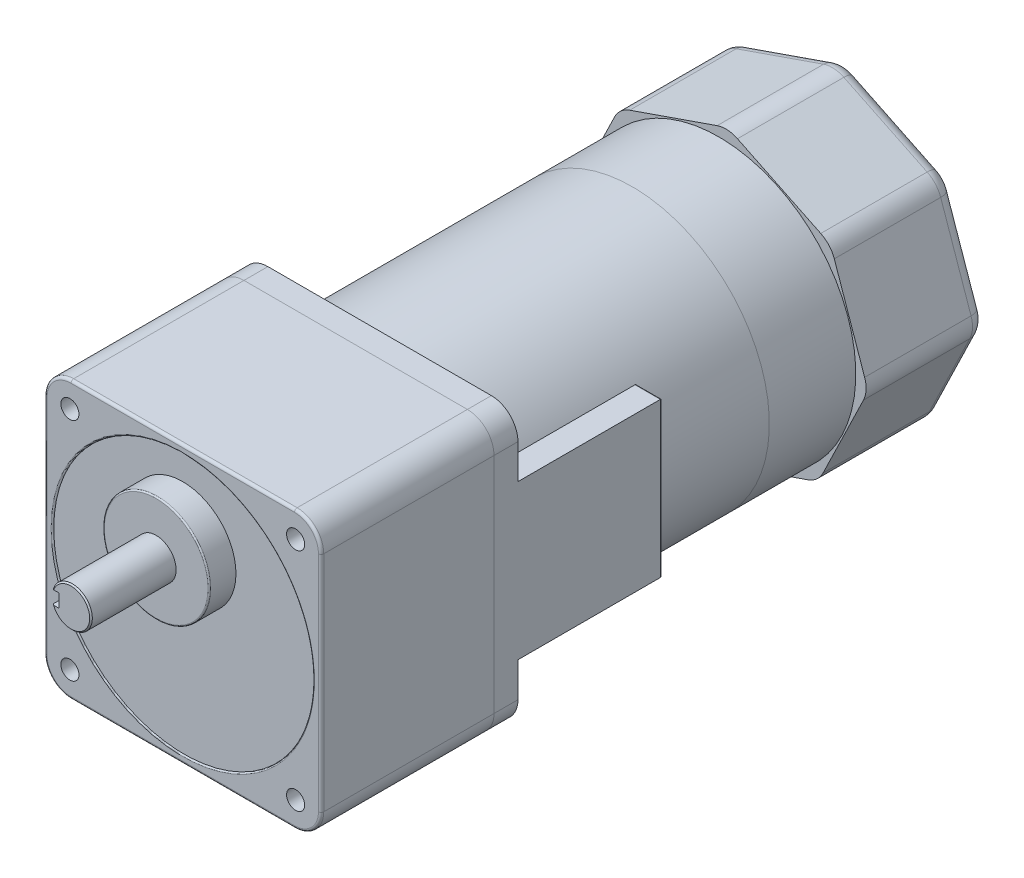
ISO-10303-21;
HEADER;
FILE_DESCRIPTION(('STEP AP214'),'2;1');
FILE_NAME('part.step','',(''),(''),'','','');
FILE_SCHEMA(('AUTOMOTIVE_DESIGN { 1 0 10303 214 1 1 1 1 }'));
ENDSEC;
DATA;
#1=APPLICATION_CONTEXT('core data for automotive mechanical design processes');
#2=APPLICATION_PROTOCOL_DEFINITION('international standard','automotive_design',2000,#1);
#3=PRODUCT_CONTEXT('',#1,'mechanical');
#4=PRODUCT('Part','Part','',(#3));
#5=PRODUCT_RELATED_PRODUCT_CATEGORY('part','',(#4));
#6=PRODUCT_DEFINITION_FORMATION('','',#4);
#7=PRODUCT_DEFINITION_CONTEXT('part definition',#1,'design');
#8=PRODUCT_DEFINITION('design','',#6,#7);
#9=PRODUCT_DEFINITION_SHAPE('','',#8);
#10=(LENGTH_UNIT() NAMED_UNIT(*) SI_UNIT(.MILLI.,.METRE.));
#11=(NAMED_UNIT(*) PLANE_ANGLE_UNIT() SI_UNIT($,.RADIAN.));
#12=(NAMED_UNIT(*) SI_UNIT($,.STERADIAN.) SOLID_ANGLE_UNIT());
#13=UNCERTAINTY_MEASURE_WITH_UNIT(LENGTH_MEASURE(1.E-05),#10,'distance_accuracy_value','');
#14=(GEOMETRIC_REPRESENTATION_CONTEXT(3) GLOBAL_UNCERTAINTY_ASSIGNED_CONTEXT((#13)) GLOBAL_UNIT_ASSIGNED_CONTEXT((#10,
#11,#12)) REPRESENTATION_CONTEXT('',''));
#15=CARTESIAN_POINT('',(0.,0.,0.));
#16=DIRECTION('',(0.,0.,1.));
#17=DIRECTION('',(1.,0.,0.));
#18=AXIS2_PLACEMENT_3D('',#15,#16,#17);
#19=CARTESIAN_POINT('',(0.,20.,107.));
#20=DIRECTION('',(0.,0.,-1.));
#21=DIRECTION('',(-1.,0.,0.));
#22=AXIS2_PLACEMENT_3D('',#19,#20,#21);
#23=CYLINDRICAL_SURFACE('',#22,7.5);
#24=CARTESIAN_POINT('',(0.,20.,75.));
#25=DIRECTION('',(0.,0.,1.));
#26=DIRECTION('',(1.,0.,0.));
#27=AXIS2_PLACEMENT_3D('',#24,#25,#26);
#28=CIRCLE('',#27,7.5);
#29=CARTESIAN_POINT('',(7.5,20.,75.));
#30=VERTEX_POINT('',#29);
#31=EDGE_CURVE('E127',#30,#30,#28,.T.);
#32=ORIENTED_EDGE('',*,*,#31,.T.);
#33=EDGE_LOOP('',(#32));
#34=FACE_BOUND('',#33,.T.);
#35=CARTESIAN_POINT('',(-7.07106781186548,22.5,84.5));
#36=CARTESIAN_POINT('',(-7.07105693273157,22.500008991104,84.4317929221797));
#37=CARTESIAN_POINT('',(-7.07205443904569,22.4972088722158,84.3635919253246));
#38=CARTESIAN_POINT('',(-7.07598524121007,22.4860604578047,84.2277189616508));
#39=CARTESIAN_POINT('',(-7.07891801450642,22.477713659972,84.1600468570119));
#40=CARTESIAN_POINT('',(-7.08662705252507,22.455574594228,84.0259095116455));
#41=CARTESIAN_POINT('',(-7.09139784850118,22.4417984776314,83.9594412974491));
#42=CARTESIAN_POINT('',(-7.10262619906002,22.4089418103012,83.8279917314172));
#43=CARTESIAN_POINT('',(-7.10908381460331,22.3898610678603,83.7630104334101));
#44=CARTESIAN_POINT('',(-7.13069940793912,22.324915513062,83.5710384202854));
#45=CARTESIAN_POINT('',(-7.14811243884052,22.2713141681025,83.44682084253));
#46=CARTESIAN_POINT('',(-7.1869703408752,22.1451778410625,83.2091231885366));
#47=CARTESIAN_POINT('',(-7.20841768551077,22.0726312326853,83.0956497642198));
#48=CARTESIAN_POINT('',(-7.25386182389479,21.9076299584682,82.8782070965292));
#49=CARTESIAN_POINT('',(-7.27792189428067,21.8145628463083,82.7747148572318));
#50=CARTESIAN_POINT('',(-7.32534626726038,21.6124707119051,82.5844828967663));
#51=CARTESIAN_POINT('',(-7.34871044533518,21.5034428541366,82.497746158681));
#52=CARTESIAN_POINT('',(-7.39284706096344,21.2690092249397,82.3413017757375));
#53=CARTESIAN_POINT('',(-7.41353593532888,21.1432502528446,82.2720976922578));
#54=CARTESIAN_POINT('',(-7.44924021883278,20.8810730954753,82.1560192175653));
#55=CARTESIAN_POINT('',(-7.46425736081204,20.7446581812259,82.1091380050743));
#56=CARTESIAN_POINT('',(-7.48647677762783,20.4700733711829,82.0406607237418));
#57=CARTESIAN_POINT('',(-7.49393272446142,20.3321295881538,82.0182418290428));
#58=CARTESIAN_POINT('',(-7.50109021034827,20.0542474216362,81.9967092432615));
#59=CARTESIAN_POINT('',(-7.50079359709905,19.9143095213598,81.9975899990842));
#60=CARTESIAN_POINT('',(-7.49265096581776,19.6422403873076,82.0221107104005));
#61=CARTESIAN_POINT('',(-7.48510152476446,19.5100182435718,82.0448565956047));
#62=CARTESIAN_POINT('',(-7.46367401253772,19.2513898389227,82.1109829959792));
#63=CARTESIAN_POINT('',(-7.4497955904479,19.1249839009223,82.1543646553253));
#64=CARTESIAN_POINT('',(-7.41689170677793,18.8796184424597,82.2610534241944));
#65=CARTESIAN_POINT('',(-7.39780094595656,18.760778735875,82.3246151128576));
#66=CARTESIAN_POINT('',(-7.35645969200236,18.5351885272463,82.469649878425));
#67=CARTESIAN_POINT('',(-7.33420833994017,18.4284413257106,82.5511278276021));
#68=CARTESIAN_POINT('',(-7.28765679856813,18.2247566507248,82.7341776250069));
#69=CARTESIAN_POINT('',(-7.26330946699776,18.128515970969,82.8365138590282));
#70=CARTESIAN_POINT('',(-7.21618726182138,17.9543199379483,83.0561037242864));
#71=CARTESIAN_POINT('',(-7.19341289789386,17.8763704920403,83.173362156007));
#72=CARTESIAN_POINT('',(-7.15175078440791,17.7399916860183,83.4217004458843));
#73=CARTESIAN_POINT('',(-7.13292537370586,17.6818674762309,83.5529587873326));
#74=CARTESIAN_POINT('',(-7.10202742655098,17.5888494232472,83.8241174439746));
#75=CARTESIAN_POINT('',(-7.08994423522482,17.5539189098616,83.9640037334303));
#76=CARTESIAN_POINT('',(-7.078413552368,17.5208546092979,84.17104659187));
#77=CARTESIAN_POINT('',(-7.07566669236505,17.5130373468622,84.2366034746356));
#78=CARTESIAN_POINT('',(-7.07199258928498,17.502613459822,84.3680951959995));
#79=CARTESIAN_POINT('',(-7.0710629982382,17.5000001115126,84.434029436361));
#80=CARTESIAN_POINT('',(-7.07106781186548,17.5,84.5));
#81=B_SPLINE_CURVE_WITH_KNOTS('',3,(#35,#36,#37,#38,#39,#40,#41,#42,#43,#44,#45,#46,#47,#48,#49,
#50,#51,#52,#53,#54,#55,#56,#57,#58,#59,#60,#61,#62,#63,#64,#65,#66,#67,#68,#69,#70,#71,#72,#73,
#74,#75,#76,#77,#78,#79,#80),.UNSPECIFIED.,.F.,.F.,(4,2,2,2,2,2,2,2,2,2,2,2,2,2,2,2,2,2,2,2,2,2,
4),(0.,0.204546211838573,0.409037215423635,0.612924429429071,0.816819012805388,1.22401016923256,
1.63145179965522,2.05327864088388,2.47518051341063,2.90809434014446,3.34087579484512,
3.75860278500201,4.176230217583,4.57747647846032,4.97874498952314,5.38529148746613,
5.79194868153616,6.2177173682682,6.643623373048,7.07581676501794,7.50732520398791,
7.70536340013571,7.90314555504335),.UNSPECIFIED.);
#82=CARTESIAN_POINT('',(-7.07106781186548,22.5,84.5));
#83=VERTEX_POINT('',#82);
#84=CARTESIAN_POINT('',(-7.07106781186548,17.5,84.5));
#85=VERTEX_POINT('',#84);
#86=EDGE_CURVE('E12',#83,#85,#81,.T.);
#87=ORIENTED_EDGE('',*,*,#86,.F.);
#88=DIRECTION('',(0.,0.,-1.));
#89=VECTOR('',#88,1.);
#90=CARTESIAN_POINT('',(-7.07106781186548,22.5,107.));
#91=LINE('',#90,#89);
#92=CARTESIAN_POINT('',(-7.07106781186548,22.5,106.5));
#93=VERTEX_POINT('',#92);
#94=EDGE_CURVE('E118',#93,#83,#91,.T.);
#95=ORIENTED_EDGE('',*,*,#94,.F.);
#96=CARTESIAN_POINT('',(0.,20.,106.5));
#97=DIRECTION('',(0.,0.,1.));
#98=DIRECTION('',(1.,0.,0.));
#99=AXIS2_PLACEMENT_3D('',#96,#97,#98);
#100=CIRCLE('',#99,7.5);
#101=CARTESIAN_POINT('',(-7.07106781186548,17.5,106.5));
#102=VERTEX_POINT('',#101);
#103=EDGE_CURVE('E133',#93,#102,#100,.F.);
#104=ORIENTED_EDGE('',*,*,#103,.T.);
#105=DIRECTION('',(0.,0.,-1.));
#106=VECTOR('',#105,1.);
#107=CARTESIAN_POINT('',(-7.07106781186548,17.5,107.));
#108=LINE('',#107,#106);
#109=EDGE_CURVE('E68',#85,#102,#108,.F.);
#110=ORIENTED_EDGE('',*,*,#109,.F.);
#111=EDGE_LOOP('',(#87,#95,#104,#110));
#112=FACE_BOUND('',#111,.T.);
#113=ADVANCED_FACE('F48',(#34,#112),#23,.T.);
#114=CARTESIAN_POINT('',(0.,20.,107.));
#115=DIRECTION('',(0.,0.,1.));
#116=DIRECTION('',(1.,0.,0.));
#117=AXIS2_PLACEMENT_3D('',#114,#115,#116);
#118=PLANE('',#117);
#119=CARTESIAN_POINT('',(0.,20.,107.));
#120=DIRECTION('',(0.,0.,1.));
#121=DIRECTION('',(1.,0.,0.));
#122=AXIS2_PLACEMENT_3D('',#119,#120,#121);
#123=CIRCLE('',#122,7.);
#124=CARTESIAN_POINT('',(-6.53834841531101,17.5,107.));
#125=VERTEX_POINT('',#124);
#126=CARTESIAN_POINT('',(-6.53834841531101,22.5,107.));
#127=VERTEX_POINT('',#126);
#128=EDGE_CURVE('E130',#125,#127,#123,.T.);
#129=ORIENTED_EDGE('',*,*,#128,.T.);
#130=DIRECTION('',(-1.,0.,0.));
#131=VECTOR('',#130,1.);
#132=CARTESIAN_POINT('',(-4.5,22.5,107.));
#133=LINE('',#132,#131);
#134=CARTESIAN_POINT('',(-4.5,22.5,107.));
#135=VERTEX_POINT('',#134);
#136=EDGE_CURVE('E119',#135,#127,#133,.T.);
#137=ORIENTED_EDGE('',*,*,#136,.F.);
#138=DIRECTION('',(0.,-1.,0.));
#139=VECTOR('',#138,1.);
#140=CARTESIAN_POINT('',(-4.5,22.5,107.));
#141=LINE('',#140,#139);
#142=CARTESIAN_POINT('',(-4.5,17.5,107.));
#143=VERTEX_POINT('',#142);
#144=EDGE_CURVE('E106',#135,#143,#141,.T.);
#145=ORIENTED_EDGE('',*,*,#144,.T.);
#146=DIRECTION('',(-1.,0.,0.));
#147=VECTOR('',#146,1.);
#148=CARTESIAN_POINT('',(-4.5,17.5,107.));
#149=LINE('',#148,#147);
#150=EDGE_CURVE('E122',#143,#125,#149,.T.);
#151=ORIENTED_EDGE('',*,*,#150,.T.);
#152=EDGE_LOOP('',(#129,#137,#145,#151));
#153=FACE_BOUND('',#152,.T.);
#154=ADVANCED_FACE('F155',(#153),#118,.T.);
#155=CARTESIAN_POINT('',(0.,20.,107.));
#156=DIRECTION('',(0.,0.,-1.));
#157=DIRECTION('',(-1.,0.,0.));
#158=AXIS2_PLACEMENT_3D('',#155,#156,#157);
#159=CONICAL_SURFACE('',#158,7.,0.785398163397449);
#160=ORIENTED_EDGE('',*,*,#103,.F.);
#161=CARTESIAN_POINT('',(-11.0143547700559,22.5,102.705487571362));
#162=CARTESIAN_POINT('',(-10.6798349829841,22.5,103.031669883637));
#163=CARTESIAN_POINT('',(-10.3449877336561,22.5,103.357518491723));
#164=CARTESIAN_POINT('',(-9.67434994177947,22.5,104.008192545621));
#165=CARTESIAN_POINT('',(-9.3385594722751,22.5,104.333018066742));
#166=CARTESIAN_POINT('',(-8.6658920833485,22.5,104.981151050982));
#167=CARTESIAN_POINT('',(-8.32901590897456,22.5,105.304459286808));
#168=CARTESIAN_POINT('',(-7.65344263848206,22.5,105.949228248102));
#169=CARTESIAN_POINT('',(-7.31474539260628,22.5,106.270688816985));
#170=CARTESIAN_POINT('',(-6.80457575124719,22.5,106.750931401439));
#171=CARTESIAN_POINT('',(-6.6340879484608,22.5,106.910759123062));
#172=CARTESIAN_POINT('',(-6.29229590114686,22.5,107.229536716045));
#173=CARTESIAN_POINT('',(-6.12099166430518,22.5,107.38848659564));
#174=CARTESIAN_POINT('',(-5.77739778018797,22.5,107.705248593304));
#175=CARTESIAN_POINT('',(-5.60510833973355,22.5,107.863060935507));
#176=CARTESIAN_POINT('',(-5.25922656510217,22.5,108.177266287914));
#177=CARTESIAN_POINT('',(-5.08563418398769,22.5,108.333659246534));
#178=CARTESIAN_POINT('',(-4.73662813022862,22.5,108.644687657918));
#179=CARTESIAN_POINT('',(-4.56121310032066,22.5,108.799321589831));
#180=CARTESIAN_POINT('',(-4.20817217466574,22.5,109.106020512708));
#181=CARTESIAN_POINT('',(-4.03054650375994,22.5,109.258085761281));
#182=CARTESIAN_POINT('',(-3.76176911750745,22.5,109.483525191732));
#183=CARTESIAN_POINT('',(-3.67175442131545,22.5,109.558254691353));
#184=CARTESIAN_POINT('',(-3.49082532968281,22.5,109.706612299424));
#185=CARTESIAN_POINT('',(-3.39991096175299,22.5,109.78024044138));
#186=CARTESIAN_POINT('',(-3.21698494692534,22.5,109.926189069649));
#187=CARTESIAN_POINT('',(-3.12497293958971,22.5,109.998509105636));
#188=CARTESIAN_POINT('',(-2.93965183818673,22.5,110.14148620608));
#189=CARTESIAN_POINT('',(-2.84634260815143,22.5,110.212143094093));
#190=CARTESIAN_POINT('',(-2.75227945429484,22.5,110.281795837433));
#191=B_SPLINE_CURVE_WITH_KNOTS('',3,(#161,#162,#163,#164,#165,#166,#167,#168,#169,#170,#171,
#172,#173,#174,#175,#176,#177,#178,#179,#180,#181,#182,#183,#184,#185,#186,#187,#188,#189,#190),
.UNSPECIFIED.,.F.,.F.,(4,2,2,2,2,2,2,2,2,2,2,2,2,2,4),(0.,1.4016744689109,2.80324322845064,
4.20399722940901,5.60486824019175,6.30593577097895,7.00699671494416,7.70791552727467,
8.40885971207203,9.11036980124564,9.81180911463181,10.1627784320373,10.5137370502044,
10.864814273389,11.2159285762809),.UNSPECIFIED.);
#192=EDGE_CURVE('E61',#93,#127,#191,.T.);
#193=ORIENTED_EDGE('',*,*,#192,.T.);
#194=ORIENTED_EDGE('',*,*,#128,.F.);
#195=CARTESIAN_POINT('',(-2.75227945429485,17.5,110.281795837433));
#196=CARTESIAN_POINT('',(-2.82551522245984,17.5,110.227577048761));
#197=CARTESIAN_POINT('',(-2.89828844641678,17.5,110.172740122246));
#198=CARTESIAN_POINT('',(-3.043018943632,17.5,110.062008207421));
#199=CARTESIAN_POINT('',(-3.11497626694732,17.5,110.006113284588));
#200=CARTESIAN_POINT('',(-3.32976761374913,17.5,109.837125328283));
#201=CARTESIAN_POINT('',(-3.47155558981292,17.5,109.722703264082));
#202=CARTESIAN_POINT('',(-3.75292181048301,17.5,109.491337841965));
#203=CARTESIAN_POINT('',(-3.8925011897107,17.5,109.3743958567));
#204=CARTESIAN_POINT('',(-4.17001061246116,17.5,109.138555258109));
#205=CARTESIAN_POINT('',(-4.30794054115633,17.5,109.019656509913));
#206=CARTESIAN_POINT('',(-4.5823789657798,17.5,108.78045226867));
#207=CARTESIAN_POINT('',(-4.71888850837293,17.5,108.660147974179));
#208=CARTESIAN_POINT('',(-4.99085017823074,17.5,108.418358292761));
#209=CARTESIAN_POINT('',(-5.1263023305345,17.5,108.296872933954));
#210=CARTESIAN_POINT('',(-5.53141798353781,17.5,107.930975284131));
#211=CARTESIAN_POINT('',(-5.79980668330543,17.5,107.685151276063));
#212=CARTESIAN_POINT('',(-6.14300557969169,17.5,107.367828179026));
#213=CARTESIAN_POINT('',(-6.21888659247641,17.5,107.297480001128));
#214=CARTESIAN_POINT('',(-6.37047314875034,17.5,107.156598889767));
#215=CARTESIAN_POINT('',(-6.44617869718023,17.5,107.086065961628));
#216=CARTESIAN_POINT('',(-6.67307720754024,17.5,106.874199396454));
#217=CARTESIAN_POINT('',(-6.8240348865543,17.5,106.732613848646));
#218=CARTESIAN_POINT('',(-7.31490063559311,17.5,106.27054247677));
#219=CARTESIAN_POINT('',(-7.65375215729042,17.5,105.948934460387));
#220=CARTESIAN_POINT('',(-8.32966336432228,17.5,105.30383974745));
#221=CARTESIAN_POINT('',(-8.66672303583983,17.5,104.98035303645));
#222=CARTESIAN_POINT('',(-9.3394195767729,17.5,104.332186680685));
#223=CARTESIAN_POINT('',(-9.67505698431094,17.5,104.00750759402));
#224=CARTESIAN_POINT('',(-10.3453568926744,17.5,103.357159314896));
#225=CARTESIAN_POINT('',(-10.6800194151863,17.5,103.031490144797));
#226=CARTESIAN_POINT('',(-11.0143547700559,17.5,102.705487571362));
#227=B_SPLINE_CURVE_WITH_KNOTS('',3,(#195,#196,#197,#198,#199,#200,#201,#202,#203,#204,#205,
#206,#207,#208,#209,#210,#211,#212,#213,#214,#215,#216,#217,#218,#219,#220,#221,#222,#223,#224,
#225,#226),.UNSPECIFIED.,.F.,.F.,(4,2,2,2,2,2,2,2,2,2,2,2,2,2,2,4),(0.,0.273355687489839,
0.546694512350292,1.09324270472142,1.63950035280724,2.18579581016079,2.73165523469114,
3.27750169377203,4.36933033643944,4.67975144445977,4.99016370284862,5.61105831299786,
7.01256945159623,8.41409138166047,9.81502466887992,11.215926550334),.UNSPECIFIED.);
#228=EDGE_CURVE('E136',#125,#102,#227,.T.);
#229=ORIENTED_EDGE('',*,*,#228,.T.);
#230=EDGE_LOOP('',(#160,#193,#194,#229));
#231=FACE_BOUND('',#230,.T.);
#232=ADVANCED_FACE('F50',(#231),#159,.T.);
#233=CARTESIAN_POINT('',(0.,20.,75.));
#234=DIRECTION('',(0.,0.,1.));
#235=DIRECTION('',(1.,0.,0.));
#236=AXIS2_PLACEMENT_3D('',#233,#234,#235);
#237=PLANE('',#236);
#238=ORIENTED_EDGE('',*,*,#31,.F.);
#239=EDGE_LOOP('',(#238));
#240=FACE_BOUND('',#239,.T.);
#241=ADVANCED_FACE('F154',(#240),#237,.F.);
#242=CARTESIAN_POINT('',(-4.5,20.,84.5));
#243=DIRECTION('',(-1.,0.,0.));
#244=DIRECTION('',(0.,0.,1.));
#245=AXIS2_PLACEMENT_3D('',#242,#243,#244);
#246=CYLINDRICAL_SURFACE('',#245,2.5);
#247=DIRECTION('',(-1.,0.,0.));
#248=VECTOR('',#247,1.);
#249=CARTESIAN_POINT('',(-4.5,22.5,84.5));
#250=LINE('',#249,#248);
#251=CARTESIAN_POINT('',(-4.5,22.5,84.5));
#252=VERTEX_POINT('',#251);
#253=EDGE_CURVE('E114',#252,#83,#250,.T.);
#254=ORIENTED_EDGE('',*,*,#253,.T.);
#255=ORIENTED_EDGE('',*,*,#86,.T.);
#256=DIRECTION('',(-1.,0.,0.));
#257=VECTOR('',#256,1.);
#258=CARTESIAN_POINT('',(-4.5,17.5,84.5));
#259=LINE('',#258,#257);
#260=CARTESIAN_POINT('',(-4.5,17.5,84.5));
#261=VERTEX_POINT('',#260);
#262=EDGE_CURVE('E115',#261,#85,#259,.T.);
#263=ORIENTED_EDGE('',*,*,#262,.F.);
#264=CARTESIAN_POINT('',(-4.5,20.,84.5));
#265=DIRECTION('',(1.,0.,0.));
#266=DIRECTION('',(0.,0.,-1.));
#267=AXIS2_PLACEMENT_3D('',#264,#265,#266);
#268=CIRCLE('',#267,2.5);
#269=EDGE_CURVE('E104',#261,#252,#268,.T.);
#270=ORIENTED_EDGE('',*,*,#269,.T.);
#271=EDGE_LOOP('',(#254,#255,#263,#270));
#272=FACE_BOUND('',#271,.T.);
#273=ADVANCED_FACE('F113',(#272),#246,.F.);
#274=CARTESIAN_POINT('',(-4.5,22.5,84.5));
#275=DIRECTION('',(0.,-1.,0.));
#276=DIRECTION('',(0.,0.,-1.));
#277=AXIS2_PLACEMENT_3D('',#274,#275,#276);
#278=PLANE('',#277);
#279=ORIENTED_EDGE('',*,*,#94,.T.);
#280=ORIENTED_EDGE('',*,*,#253,.F.);
#281=DIRECTION('',(0.,0.,1.));
#282=VECTOR('',#281,1.);
#283=CARTESIAN_POINT('',(-4.5,22.5,84.5));
#284=LINE('',#283,#282);
#285=EDGE_CURVE('E100',#252,#135,#284,.T.);
#286=ORIENTED_EDGE('',*,*,#285,.T.);
#287=ORIENTED_EDGE('',*,*,#136,.T.);
#288=ORIENTED_EDGE('',*,*,#192,.F.);
#289=EDGE_LOOP('',(#279,#280,#286,#287,#288));
#290=FACE_BOUND('',#289,.T.);
#291=ADVANCED_FACE('F117',(#290),#278,.T.);
#292=CARTESIAN_POINT('',(-4.5,17.5,107.));
#293=DIRECTION('',(0.,1.,0.));
#294=DIRECTION('',(0.,0.,1.));
#295=AXIS2_PLACEMENT_3D('',#292,#293,#294);
#296=PLANE('',#295);
#297=ORIENTED_EDGE('',*,*,#109,.T.);
#298=ORIENTED_EDGE('',*,*,#228,.F.);
#299=ORIENTED_EDGE('',*,*,#150,.F.);
#300=DIRECTION('',(0.,0.,-1.));
#301=VECTOR('',#300,1.);
#302=CARTESIAN_POINT('',(-4.5,17.5,107.));
#303=LINE('',#302,#301);
#304=EDGE_CURVE('E169',#143,#261,#303,.T.);
#305=ORIENTED_EDGE('',*,*,#304,.T.);
#306=ORIENTED_EDGE('',*,*,#262,.T.);
#307=EDGE_LOOP('',(#297,#298,#299,#305,#306));
#308=FACE_BOUND('',#307,.T.);
#309=ADVANCED_FACE('F145',(#308),#296,.T.);
#310=CARTESIAN_POINT('',(-4.5,20.,84.5));
#311=DIRECTION('',(1.,0.,0.));
#312=DIRECTION('',(0.,0.,-1.));
#313=AXIS2_PLACEMENT_3D('',#310,#311,#312);
#314=PLANE('',#313);
#315=ORIENTED_EDGE('',*,*,#269,.F.);
#316=ORIENTED_EDGE('',*,*,#304,.F.);
#317=ORIENTED_EDGE('',*,*,#144,.F.);
#318=ORIENTED_EDGE('',*,*,#285,.F.);
#319=EDGE_LOOP('',(#315,#316,#317,#318));
#320=FACE_BOUND('',#319,.T.);
#321=ADVANCED_FACE('F102',(#320),#314,.F.);
#322=CLOSED_SHELL('',(#113,#154,#232,#241,#273,#291,#309,#321));
#323=MANIFOLD_SOLID_BREP('B2',#322);
#324=CARTESIAN_POINT('',(0.,20.,75.));
#325=DIRECTION('',(0.,0.,-1.));
#326=DIRECTION('',(-1.,0.,0.));
#327=AXIS2_PLACEMENT_3D('',#324,#325,#326);
#328=CYLINDRICAL_SURFACE('',#327,20.);
#329=CARTESIAN_POINT('',(0.,20.,74.5));
#330=DIRECTION('',(0.,0.,1.));
#331=DIRECTION('',(1.,0.,0.));
#332=AXIS2_PLACEMENT_3D('',#329,#330,#331);
#333=CIRCLE('',#332,20.);
#334=CARTESIAN_POINT('',(20.,20.,74.5));
#335=VERTEX_POINT('',#334);
#336=EDGE_CURVE('E47',#335,#335,#333,.F.);
#337=ORIENTED_EDGE('',*,*,#336,.T.);
#338=EDGE_LOOP('',(#337));
#339=FACE_BOUND('',#338,.T.);
#340=CARTESIAN_POINT('',(0.,20.,65.));
#341=DIRECTION('',(0.,0.,1.));
#342=DIRECTION('',(1.,0.,0.));
#343=AXIS2_PLACEMENT_3D('',#340,#341,#342);
#344=CIRCLE('',#343,20.);
#345=CARTESIAN_POINT('',(20.,20.,65.));
#346=VERTEX_POINT('',#345);
#347=EDGE_CURVE('E249',#346,#346,#344,.T.);
#348=ORIENTED_EDGE('',*,*,#347,.T.);
#349=EDGE_LOOP('',(#348));
#350=FACE_BOUND('',#349,.T.);
#351=ADVANCED_FACE('F238',(#339,#350),#328,.T.);
#352=CARTESIAN_POINT('',(0.,20.,75.));
#353=DIRECTION('',(0.,0.,1.));
#354=DIRECTION('',(1.,0.,0.));
#355=AXIS2_PLACEMENT_3D('',#352,#353,#354);
#356=PLANE('',#355);
#357=CARTESIAN_POINT('',(0.,20.,75.));
#358=DIRECTION('',(0.,0.,1.));
#359=DIRECTION('',(1.,0.,0.));
#360=AXIS2_PLACEMENT_3D('',#357,#358,#359);
#361=CIRCLE('',#360,19.5);
#362=CARTESIAN_POINT('',(19.5,20.,75.));
#363=VERTEX_POINT('',#362);
#364=EDGE_CURVE('E245',#363,#363,#361,.T.);
#365=ORIENTED_EDGE('',*,*,#364,.T.);
#366=EDGE_LOOP('',(#365));
#367=FACE_BOUND('',#366,.T.);
#368=ADVANCED_FACE('F259',(#367),#356,.T.);
#369=CARTESIAN_POINT('',(0.,20.,65.));
#370=DIRECTION('',(0.,0.,1.));
#371=DIRECTION('',(1.,0.,0.));
#372=AXIS2_PLACEMENT_3D('',#369,#370,#371);
#373=PLANE('',#372);
#374=ORIENTED_EDGE('',*,*,#347,.F.);
#375=EDGE_LOOP('',(#374));
#376=FACE_BOUND('',#375,.T.);
#377=ADVANCED_FACE('F257',(#376),#373,.F.);
#378=CARTESIAN_POINT('',(0.,20.,74.5));
#379=DIRECTION('',(0.,0.,1.));
#380=DIRECTION('',(1.,0.,0.));
#381=AXIS2_PLACEMENT_3D('',#378,#379,#380);
#382=TOROIDAL_SURFACE('',#381,19.5,0.5);
#383=ORIENTED_EDGE('',*,*,#336,.F.);
#384=EDGE_LOOP('',(#383));
#385=FACE_BOUND('',#384,.T.);
#386=ORIENTED_EDGE('',*,*,#364,.F.);
#387=EDGE_LOOP('',(#386));
#388=FACE_BOUND('',#387,.T.);
#389=ADVANCED_FACE('F240',(#385,#388),#382,.T.);
#390=CLOSED_SHELL('',(#351,#368,#377,#389));
#391=MANIFOLD_SOLID_BREP('B6',#390);
#392=CARTESIAN_POINT('',(45.3825112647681,-2.66124468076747,-181.5));
#393=DIRECTION('',(0.,0.,1.));
#394=DIRECTION('',(1.,0.,0.));
#395=AXIS2_PLACEMENT_3D('',#392,#393,#394);
#396=CYLINDRICAL_SURFACE('',#395,10.);
#397=DIRECTION('',(0.,0.,1.));
#398=VECTOR('',#397,1.);
#399=CARTESIAN_POINT('',(54.3814408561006,-7.02235305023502,-181.5));
#400=LINE('',#399,#398);
#401=CARTESIAN_POINT('',(54.3814408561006,-7.02235305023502,-176.5));
#402=VERTEX_POINT('',#401);
#403=CARTESIAN_POINT('',(54.3814408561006,-7.02235305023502,-136.5));
#404=VERTEX_POINT('',#403);
#405=EDGE_CURVE('E462',#402,#404,#400,.T.);
#406=ORIENTED_EDGE('',*,*,#405,.F.);
#407=CARTESIAN_POINT('',(45.3825112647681,-2.66124468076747,-176.5));
#408=DIRECTION('',(0.,0.,-1.));
#409=DIRECTION('',(-1.,0.,0.));
#410=AXIS2_PLACEMENT_3D('',#407,#408,#409);
#411=CIRCLE('',#410,10.);
#412=CARTESIAN_POINT('',(54.8294847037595,0.618190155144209,-176.5));
#413=VERTEX_POINT('',#412);
#414=EDGE_CURVE('E236',#402,#413,#411,.F.);
#415=ORIENTED_EDGE('',*,*,#414,.T.);
#416=DIRECTION('',(0.,0.,1.));
#417=VECTOR('',#416,1.);
#418=CARTESIAN_POINT('',(54.8294847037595,0.618190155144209,-181.5));
#419=LINE('',#418,#417);
#420=CARTESIAN_POINT('',(54.8294847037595,0.618190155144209,-136.5));
#421=VERTEX_POINT('',#420);
#422=EDGE_CURVE('E483',#413,#421,#419,.T.);
#423=ORIENTED_EDGE('',*,*,#422,.T.);
#424=CARTESIAN_POINT('',(45.3825112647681,-2.66124468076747,-136.5));
#425=DIRECTION('',(0.,0.,-1.));
#426=DIRECTION('',(-1.,0.,0.));
#427=AXIS2_PLACEMENT_3D('',#424,#425,#426);
#428=CIRCLE('',#427,10.);
#429=EDGE_CURVE('E477',#421,#404,#428,.T.);
#430=ORIENTED_EDGE('',*,*,#429,.T.);
#431=EDGE_LOOP('',(#406,#415,#423,#430));
#432=FACE_BOUND('',#431,.T.);
#433=ADVANCED_FACE('F302',(#432),#396,.T.);
#434=CARTESIAN_POINT('',(54.3814408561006,-7.02235305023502,-181.5));
#435=DIRECTION('',(-0.899892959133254,0.436110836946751,0.));
#436=DIRECTION('',(-0.436110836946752,-0.899892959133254,0.));
#437=AXIS2_PLACEMENT_3D('',#434,#435,#436);
#438=PLANE('',#437);
#439=DIRECTION('',(0.,0.,1.));
#440=VECTOR('',#439,1.);
#441=CARTESIAN_POINT('',(39.2074268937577,-38.3331739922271,-181.5));
#442=LINE('',#441,#440);
#443=CARTESIAN_POINT('',(39.2074268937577,-38.3331739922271,-176.5));
#444=VERTEX_POINT('',#443);
#445=CARTESIAN_POINT('',(39.2074268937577,-38.3331739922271,-136.5));
#446=VERTEX_POINT('',#445);
#447=EDGE_CURVE('E471',#444,#446,#442,.T.);
#448=ORIENTED_EDGE('',*,*,#447,.F.);
#449=DIRECTION('',(-0.436110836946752,-0.899892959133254,0.));
#450=VECTOR('',#449,1.);
#451=CARTESIAN_POINT('',(54.3814408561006,-7.02235305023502,-176.5));
#452=LINE('',#451,#450);
#453=EDGE_CURVE('E311',#444,#402,#452,.F.);
#454=ORIENTED_EDGE('',*,*,#453,.T.);
#455=ORIENTED_EDGE('',*,*,#405,.T.);
#456=DIRECTION('',(-0.436110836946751,-0.899892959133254,0.));
#457=VECTOR('',#456,1.);
#458=CARTESIAN_POINT('',(54.3814408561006,-7.02235305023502,-136.5));
#459=LINE('',#458,#457);
#460=EDGE_CURVE('E465',#404,#446,#459,.T.);
#461=ORIENTED_EDGE('',*,*,#460,.T.);
#462=EDGE_LOOP('',(#448,#454,#455,#461));
#463=FACE_BOUND('',#462,.T.);
#464=ADVANCED_FACE('F464',(#463),#438,.F.);
#465=CARTESIAN_POINT('',(30.2084973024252,-33.9720656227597,-181.5));
#466=DIRECTION('',(0.,0.,1.));
#467=DIRECTION('',(1.,0.,0.));
#468=AXIS2_PLACEMENT_3D('',#465,#466,#467);
#469=CYLINDRICAL_SURFACE('',#468,10.);
#470=DIRECTION('',(0.,0.,1.));
#471=VECTOR('',#470,1.);
#472=CARTESIAN_POINT('',(33.4879321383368,-43.4190390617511,-181.5));
#473=LINE('',#472,#471);
#474=CARTESIAN_POINT('',(33.4879321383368,-43.4190390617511,-176.5));
#475=VERTEX_POINT('',#474);
#476=CARTESIAN_POINT('',(33.4879321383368,-43.4190390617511,-136.5));
#477=VERTEX_POINT('',#476);
#478=EDGE_CURVE('E553',#475,#477,#473,.T.);
#479=ORIENTED_EDGE('',*,*,#478,.F.);
#480=CARTESIAN_POINT('',(30.2084973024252,-33.9720656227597,-176.5));
#481=DIRECTION('',(0.,0.,-1.));
#482=DIRECTION('',(-1.,0.,0.));
#483=AXIS2_PLACEMENT_3D('',#480,#481,#482);
#484=CIRCLE('',#483,10.);
#485=EDGE_CURVE('E326',#475,#444,#484,.F.);
#486=ORIENTED_EDGE('',*,*,#485,.T.);
#487=ORIENTED_EDGE('',*,*,#447,.T.);
#488=CARTESIAN_POINT('',(30.2084973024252,-33.9720656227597,-136.5));
#489=DIRECTION('',(0.,0.,-1.));
#490=DIRECTION('',(-1.,0.,0.));
#491=AXIS2_PLACEMENT_3D('',#488,#489,#490);
#492=CIRCLE('',#491,10.);
#493=EDGE_CURVE('E480',#446,#477,#492,.T.);
#494=ORIENTED_EDGE('',*,*,#493,.T.);
#495=EDGE_LOOP('',(#479,#486,#487,#494));
#496=FACE_BOUND('',#495,.T.);
#497=ADVANCED_FACE('F791',(#496),#469,.T.);
#498=CARTESIAN_POINT('',(33.4879321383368,-43.4190390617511,-181.5));
#499=DIRECTION('',(-0.327943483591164,0.944697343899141,0.));
#500=DIRECTION('',(-0.944697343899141,-0.327943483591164,0.));
#501=AXIS2_PLACEMENT_3D('',#498,#499,#500);
#502=PLANE('',#501);
#503=DIRECTION('',(0.,0.,1.));
#504=VECTOR('',#503,1.);
#505=CARTESIAN_POINT('',(0.618190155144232,-54.8294847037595,-181.5));
#506=LINE('',#505,#504);
#507=CARTESIAN_POINT('',(0.618190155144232,-54.8294847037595,-176.5));
#508=VERTEX_POINT('',#507);
#509=CARTESIAN_POINT('',(0.618190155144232,-54.8294847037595,-136.5));
#510=VERTEX_POINT('',#509);
#511=EDGE_CURVE('E551',#508,#510,#506,.T.);
#512=ORIENTED_EDGE('',*,*,#511,.F.);
#513=DIRECTION('',(-0.944697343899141,-0.327943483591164,0.));
#514=VECTOR('',#513,1.);
#515=CARTESIAN_POINT('',(33.4879321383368,-43.4190390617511,-176.5));
#516=LINE('',#515,#514);
#517=EDGE_CURVE('E613',#508,#475,#516,.F.);
#518=ORIENTED_EDGE('',*,*,#517,.T.);
#519=ORIENTED_EDGE('',*,*,#478,.T.);
#520=DIRECTION('',(-0.944697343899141,-0.327943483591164,0.));
#521=VECTOR('',#520,1.);
#522=CARTESIAN_POINT('',(33.4879321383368,-43.4190390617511,-136.5));
#523=LINE('',#522,#521);
#524=EDGE_CURVE('E490',#477,#510,#523,.T.);
#525=ORIENTED_EDGE('',*,*,#524,.T.);
#526=EDGE_LOOP('',(#512,#518,#519,#525));
#527=FACE_BOUND('',#526,.T.);
#528=ADVANCED_FACE('F687',(#527),#502,.F.);
#529=CARTESIAN_POINT('',(-2.66124468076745,-45.3825112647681,-181.5));
#530=DIRECTION('',(0.,0.,1.));
#531=DIRECTION('',(1.,0.,0.));
#532=AXIS2_PLACEMENT_3D('',#529,#530,#531);
#533=CYLINDRICAL_SURFACE('',#532,10.);
#534=DIRECTION('',(0.,0.,1.));
#535=VECTOR('',#534,1.);
#536=CARTESIAN_POINT('',(-7.022353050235,-54.3814408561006,-181.5));
#537=LINE('',#536,#535);
#538=CARTESIAN_POINT('',(-7.022353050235,-54.3814408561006,-176.5));
#539=VERTEX_POINT('',#538);
#540=CARTESIAN_POINT('',(-7.022353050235,-54.3814408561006,-136.5));
#541=VERTEX_POINT('',#540);
#542=EDGE_CURVE('E549',#539,#541,#537,.T.);
#543=ORIENTED_EDGE('',*,*,#542,.F.);
#544=CARTESIAN_POINT('',(-2.66124468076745,-45.3825112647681,-176.5));
#545=DIRECTION('',(0.,0.,-1.));
#546=DIRECTION('',(-1.,0.,0.));
#547=AXIS2_PLACEMENT_3D('',#544,#545,#546);
#548=CIRCLE('',#547,10.);
#549=EDGE_CURVE('E611',#539,#508,#548,.F.);
#550=ORIENTED_EDGE('',*,*,#549,.T.);
#551=ORIENTED_EDGE('',*,*,#511,.T.);
#552=CARTESIAN_POINT('',(-2.66124468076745,-45.3825112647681,-136.5));
#553=DIRECTION('',(0.,0.,-1.));
#554=DIRECTION('',(-1.,0.,0.));
#555=AXIS2_PLACEMENT_3D('',#552,#553,#554);
#556=CIRCLE('',#555,10.);
#557=EDGE_CURVE('E493',#510,#541,#556,.T.);
#558=ORIENTED_EDGE('',*,*,#557,.T.);
#559=EDGE_LOOP('',(#543,#550,#551,#558));
#560=FACE_BOUND('',#559,.T.);
#561=ADVANCED_FACE('F685',(#560),#533,.T.);
#562=CARTESIAN_POINT('',(-7.022353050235,-54.3814408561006,-181.5));
#563=DIRECTION('',(0.436110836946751,0.899892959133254,0.));
#564=DIRECTION('',(-0.899892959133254,0.436110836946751,0.));
#565=AXIS2_PLACEMENT_3D('',#562,#563,#564);
#566=PLANE('',#565);
#567=DIRECTION('',(0.,0.,1.));
#568=VECTOR('',#567,1.);
#569=CARTESIAN_POINT('',(-38.3331739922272,-39.2074268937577,-181.5));
#570=LINE('',#569,#568);
#571=CARTESIAN_POINT('',(-38.3331739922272,-39.2074268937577,-176.5));
#572=VERTEX_POINT('',#571);
#573=CARTESIAN_POINT('',(-38.3331739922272,-39.2074268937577,-136.5));
#574=VERTEX_POINT('',#573);
#575=EDGE_CURVE('E547',#572,#574,#570,.T.);
#576=ORIENTED_EDGE('',*,*,#575,.F.);
#577=DIRECTION('',(-0.899892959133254,0.436110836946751,0.));
#578=VECTOR('',#577,1.);
#579=CARTESIAN_POINT('',(-7.022353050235,-54.3814408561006,-176.5));
#580=LINE('',#579,#578);
#581=EDGE_CURVE('E609',#572,#539,#580,.F.);
#582=ORIENTED_EDGE('',*,*,#581,.T.);
#583=ORIENTED_EDGE('',*,*,#542,.T.);
#584=DIRECTION('',(-0.899892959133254,0.436110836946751,0.));
#585=VECTOR('',#584,1.);
#586=CARTESIAN_POINT('',(-7.022353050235,-54.3814408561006,-136.5));
#587=LINE('',#586,#585);
#588=EDGE_CURVE('E496',#541,#574,#587,.T.);
#589=ORIENTED_EDGE('',*,*,#588,.T.);
#590=EDGE_LOOP('',(#576,#582,#583,#589));
#591=FACE_BOUND('',#590,.T.);
#592=ADVANCED_FACE('F694',(#591),#566,.F.);
#593=CARTESIAN_POINT('',(-33.9720656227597,-30.2084973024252,-181.5));
#594=DIRECTION('',(0.,0.,1.));
#595=DIRECTION('',(1.,0.,0.));
#596=AXIS2_PLACEMENT_3D('',#593,#594,#595);
#597=CYLINDRICAL_SURFACE('',#596,10.);
#598=DIRECTION('',(0.,0.,1.));
#599=VECTOR('',#598,1.);
#600=CARTESIAN_POINT('',(-43.4190390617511,-33.4879321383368,-181.5));
#601=LINE('',#600,#599);
#602=CARTESIAN_POINT('',(-43.4190390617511,-33.4879321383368,-176.5));
#603=VERTEX_POINT('',#602);
#604=CARTESIAN_POINT('',(-43.4190390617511,-33.4879321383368,-136.5));
#605=VERTEX_POINT('',#604);
#606=EDGE_CURVE('E545',#603,#605,#601,.T.);
#607=ORIENTED_EDGE('',*,*,#606,.F.);
#608=CARTESIAN_POINT('',(-33.9720656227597,-30.2084973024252,-176.5));
#609=DIRECTION('',(0.,0.,-1.));
#610=DIRECTION('',(-1.,0.,0.));
#611=AXIS2_PLACEMENT_3D('',#608,#609,#610);
#612=CIRCLE('',#611,10.);
#613=EDGE_CURVE('E607',#603,#572,#612,.F.);
#614=ORIENTED_EDGE('',*,*,#613,.T.);
#615=ORIENTED_EDGE('',*,*,#575,.T.);
#616=CARTESIAN_POINT('',(-33.9720656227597,-30.2084973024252,-136.5));
#617=DIRECTION('',(0.,0.,-1.));
#618=DIRECTION('',(-1.,0.,0.));
#619=AXIS2_PLACEMENT_3D('',#616,#617,#618);
#620=CIRCLE('',#619,10.);
#621=EDGE_CURVE('E499',#574,#605,#620,.T.);
#622=ORIENTED_EDGE('',*,*,#621,.T.);
#623=EDGE_LOOP('',(#607,#614,#615,#622));
#624=FACE_BOUND('',#623,.T.);
#625=ADVANCED_FACE('F697',(#624),#597,.T.);
#626=CARTESIAN_POINT('',(-43.4190390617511,-33.4879321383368,-181.5));
#627=DIRECTION('',(0.944697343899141,0.327943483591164,0.));
#628=DIRECTION('',(-0.327943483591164,0.944697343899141,0.));
#629=AXIS2_PLACEMENT_3D('',#626,#627,#628);
#630=PLANE('',#629);
#631=DIRECTION('',(0.,0.,1.));
#632=VECTOR('',#631,1.);
#633=CARTESIAN_POINT('',(-54.8294847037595,-0.618190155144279,-181.5));
#634=LINE('',#633,#632);
#635=CARTESIAN_POINT('',(-54.8294847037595,-0.618190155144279,-176.5));
#636=VERTEX_POINT('',#635);
#637=CARTESIAN_POINT('',(-54.8294847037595,-0.618190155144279,-136.5));
#638=VERTEX_POINT('',#637);
#639=EDGE_CURVE('E543',#636,#638,#634,.T.);
#640=ORIENTED_EDGE('',*,*,#639,.F.);
#641=DIRECTION('',(-0.327943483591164,0.944697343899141,0.));
#642=VECTOR('',#641,1.);
#643=CARTESIAN_POINT('',(-43.4190390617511,-33.4879321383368,-176.5));
#644=LINE('',#643,#642);
#645=EDGE_CURVE('E605',#636,#603,#644,.F.);
#646=ORIENTED_EDGE('',*,*,#645,.T.);
#647=ORIENTED_EDGE('',*,*,#606,.T.);
#648=DIRECTION('',(-0.327943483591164,0.944697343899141,0.));
#649=VECTOR('',#648,1.);
#650=CARTESIAN_POINT('',(-43.4190390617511,-33.4879321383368,-136.5));
#651=LINE('',#650,#649);
#652=EDGE_CURVE('E502',#605,#638,#651,.T.);
#653=ORIENTED_EDGE('',*,*,#652,.T.);
#654=EDGE_LOOP('',(#640,#646,#647,#653));
#655=FACE_BOUND('',#654,.T.);
#656=ADVANCED_FACE('F700',(#655),#630,.F.);
#657=CARTESIAN_POINT('',(-45.3825112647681,2.6612446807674,-181.5));
#658=DIRECTION('',(0.,0.,1.));
#659=DIRECTION('',(1.,0.,0.));
#660=AXIS2_PLACEMENT_3D('',#657,#658,#659);
#661=CYLINDRICAL_SURFACE('',#660,10.);
#662=DIRECTION('',(0.,0.,1.));
#663=VECTOR('',#662,1.);
#664=CARTESIAN_POINT('',(-54.3814408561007,7.02235305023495,-181.5));
#665=LINE('',#664,#663);
#666=CARTESIAN_POINT('',(-54.3814408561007,7.02235305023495,-176.5));
#667=VERTEX_POINT('',#666);
#668=CARTESIAN_POINT('',(-54.3814408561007,7.02235305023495,-136.5));
#669=VERTEX_POINT('',#668);
#670=EDGE_CURVE('E541',#667,#669,#665,.T.);
#671=ORIENTED_EDGE('',*,*,#670,.F.);
#672=CARTESIAN_POINT('',(-45.3825112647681,2.6612446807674,-176.5));
#673=DIRECTION('',(0.,0.,-1.));
#674=DIRECTION('',(-1.,0.,0.));
#675=AXIS2_PLACEMENT_3D('',#672,#673,#674);
#676=CIRCLE('',#675,10.);
#677=EDGE_CURVE('E603',#667,#636,#676,.F.);
#678=ORIENTED_EDGE('',*,*,#677,.T.);
#679=ORIENTED_EDGE('',*,*,#639,.T.);
#680=CARTESIAN_POINT('',(-45.3825112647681,2.6612446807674,-136.5));
#681=DIRECTION('',(0.,0.,-1.));
#682=DIRECTION('',(-1.,0.,0.));
#683=AXIS2_PLACEMENT_3D('',#680,#681,#682);
#684=CIRCLE('',#683,10.);
#685=EDGE_CURVE('E505',#638,#669,#684,.T.);
#686=ORIENTED_EDGE('',*,*,#685,.T.);
#687=EDGE_LOOP('',(#671,#678,#679,#686));
#688=FACE_BOUND('',#687,.T.);
#689=ADVANCED_FACE('F704',(#688),#661,.T.);
#690=CARTESIAN_POINT('',(-54.3814408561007,7.02235305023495,-181.5));
#691=DIRECTION('',(0.899892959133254,-0.436110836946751,0.));
#692=DIRECTION('',(0.436110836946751,0.899892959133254,0.));
#693=AXIS2_PLACEMENT_3D('',#690,#691,#692);
#694=PLANE('',#693);
#695=DIRECTION('',(0.,0.,1.));
#696=VECTOR('',#695,1.);
#697=CARTESIAN_POINT('',(-39.2074268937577,38.3331739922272,-181.5));
#698=LINE('',#697,#696);
#699=CARTESIAN_POINT('',(-39.2074268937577,38.3331739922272,-176.5));
#700=VERTEX_POINT('',#699);
#701=CARTESIAN_POINT('',(-39.2074268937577,38.3331739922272,-136.5));
#702=VERTEX_POINT('',#701);
#703=EDGE_CURVE('E539',#700,#702,#698,.T.);
#704=ORIENTED_EDGE('',*,*,#703,.F.);
#705=DIRECTION('',(0.436110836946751,0.899892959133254,0.));
#706=VECTOR('',#705,1.);
#707=CARTESIAN_POINT('',(-54.3814408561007,7.02235305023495,-176.5));
#708=LINE('',#707,#706);
#709=EDGE_CURVE('E601',#700,#667,#708,.F.);
#710=ORIENTED_EDGE('',*,*,#709,.T.);
#711=ORIENTED_EDGE('',*,*,#670,.T.);
#712=DIRECTION('',(0.436110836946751,0.899892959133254,0.));
#713=VECTOR('',#712,1.);
#714=CARTESIAN_POINT('',(-54.3814408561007,7.02235305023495,-136.5));
#715=LINE('',#714,#713);
#716=EDGE_CURVE('E508',#669,#702,#715,.T.);
#717=ORIENTED_EDGE('',*,*,#716,.T.);
#718=EDGE_LOOP('',(#704,#710,#711,#717));
#719=FACE_BOUND('',#718,.T.);
#720=ADVANCED_FACE('F777',(#719),#694,.F.);
#721=CARTESIAN_POINT('',(-30.2084973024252,33.9720656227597,-181.5));
#722=DIRECTION('',(0.,0.,1.));
#723=DIRECTION('',(1.,0.,0.));
#724=AXIS2_PLACEMENT_3D('',#721,#722,#723);
#725=CYLINDRICAL_SURFACE('',#724,9.99999999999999);
#726=DIRECTION('',(0.,0.,1.));
#727=VECTOR('',#726,1.);
#728=CARTESIAN_POINT('',(-33.4879321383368,43.4190390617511,-181.5));
#729=LINE('',#728,#727);
#730=CARTESIAN_POINT('',(-33.4879321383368,43.4190390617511,-176.5));
#731=VERTEX_POINT('',#730);
#732=CARTESIAN_POINT('',(-33.4879321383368,43.4190390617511,-136.5));
#733=VERTEX_POINT('',#732);
#734=EDGE_CURVE('E537',#731,#733,#729,.T.);
#735=ORIENTED_EDGE('',*,*,#734,.F.);
#736=CARTESIAN_POINT('',(-30.2084973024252,33.9720656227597,-176.5));
#737=DIRECTION('',(0.,0.,-1.));
#738=DIRECTION('',(-1.,0.,0.));
#739=AXIS2_PLACEMENT_3D('',#736,#737,#738);
#740=CIRCLE('',#739,9.99999999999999);
#741=EDGE_CURVE('E599',#731,#700,#740,.F.);
#742=ORIENTED_EDGE('',*,*,#741,.T.);
#743=ORIENTED_EDGE('',*,*,#703,.T.);
#744=CARTESIAN_POINT('',(-30.2084973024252,33.9720656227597,-136.5));
#745=DIRECTION('',(0.,0.,-1.));
#746=DIRECTION('',(-1.,0.,0.));
#747=AXIS2_PLACEMENT_3D('',#744,#745,#746);
#748=CIRCLE('',#747,9.99999999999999);
#749=EDGE_CURVE('E511',#702,#733,#748,.T.);
#750=ORIENTED_EDGE('',*,*,#749,.T.);
#751=EDGE_LOOP('',(#735,#742,#743,#750));
#752=FACE_BOUND('',#751,.T.);
#753=ADVANCED_FACE('F774',(#752),#725,.T.);
#754=CARTESIAN_POINT('',(-33.4879321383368,43.4190390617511,-181.5));
#755=DIRECTION('',(0.327943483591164,-0.944697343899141,0.));
#756=DIRECTION('',(0.944697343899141,0.327943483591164,0.));
#757=AXIS2_PLACEMENT_3D('',#754,#755,#756);
#758=PLANE('',#757);
#759=DIRECTION('',(0.,0.,1.));
#760=VECTOR('',#759,1.);
#761=CARTESIAN_POINT('',(-0.618190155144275,54.8294847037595,-181.5));
#762=LINE('',#761,#760);
#763=CARTESIAN_POINT('',(-0.618190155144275,54.8294847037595,-176.5));
#764=VERTEX_POINT('',#763);
#765=CARTESIAN_POINT('',(-0.618190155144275,54.8294847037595,-136.5));
#766=VERTEX_POINT('',#765);
#767=EDGE_CURVE('E535',#764,#766,#762,.T.);
#768=ORIENTED_EDGE('',*,*,#767,.F.);
#769=DIRECTION('',(0.944697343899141,0.327943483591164,0.));
#770=VECTOR('',#769,1.);
#771=CARTESIAN_POINT('',(-33.4879321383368,43.4190390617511,-176.5));
#772=LINE('',#771,#770);
#773=EDGE_CURVE('E597',#764,#731,#772,.F.);
#774=ORIENTED_EDGE('',*,*,#773,.T.);
#775=ORIENTED_EDGE('',*,*,#734,.T.);
#776=DIRECTION('',(0.944697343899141,0.327943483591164,0.));
#777=VECTOR('',#776,1.);
#778=CARTESIAN_POINT('',(-33.4879321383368,43.4190390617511,-136.5));
#779=LINE('',#778,#777);
#780=EDGE_CURVE('E514',#733,#766,#779,.T.);
#781=ORIENTED_EDGE('',*,*,#780,.T.);
#782=EDGE_LOOP('',(#768,#774,#775,#781));
#783=FACE_BOUND('',#782,.T.);
#784=ADVANCED_FACE('F771',(#783),#758,.F.);
#785=CARTESIAN_POINT('',(2.66124468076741,45.3825112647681,-181.5));
#786=DIRECTION('',(0.,0.,1.));
#787=DIRECTION('',(1.,0.,0.));
#788=AXIS2_PLACEMENT_3D('',#785,#786,#787);
#789=CYLINDRICAL_SURFACE('',#788,9.99999999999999);
#790=DIRECTION('',(0.,0.,1.));
#791=VECTOR('',#790,1.);
#792=CARTESIAN_POINT('',(7.02235305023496,54.3814408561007,-181.5));
#793=LINE('',#792,#791);
#794=CARTESIAN_POINT('',(7.02235305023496,54.3814408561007,-176.5));
#795=VERTEX_POINT('',#794);
#796=CARTESIAN_POINT('',(7.02235305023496,54.3814408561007,-136.5));
#797=VERTEX_POINT('',#796);
#798=EDGE_CURVE('E533',#795,#797,#793,.T.);
#799=ORIENTED_EDGE('',*,*,#798,.F.);
#800=CARTESIAN_POINT('',(2.66124468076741,45.3825112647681,-176.5));
#801=DIRECTION('',(0.,0.,-1.));
#802=DIRECTION('',(-1.,0.,0.));
#803=AXIS2_PLACEMENT_3D('',#800,#801,#802);
#804=CIRCLE('',#803,9.99999999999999);
#805=EDGE_CURVE('E595',#795,#764,#804,.F.);
#806=ORIENTED_EDGE('',*,*,#805,.T.);
#807=ORIENTED_EDGE('',*,*,#767,.T.);
#808=CARTESIAN_POINT('',(2.66124468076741,45.3825112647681,-136.5));
#809=DIRECTION('',(0.,0.,-1.));
#810=DIRECTION('',(1.,0.,0.));
#811=AXIS2_PLACEMENT_3D('',#808,#809,#810);
#812=CIRCLE('',#811,9.99999999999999);
#813=EDGE_CURVE('E517',#766,#797,#812,.T.);
#814=ORIENTED_EDGE('',*,*,#813,.T.);
#815=EDGE_LOOP('',(#799,#806,#807,#814));
#816=FACE_BOUND('',#815,.T.);
#817=ADVANCED_FACE('F766',(#816),#789,.T.);
#818=CARTESIAN_POINT('',(7.02235305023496,54.3814408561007,-181.5));
#819=DIRECTION('',(-0.436110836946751,-0.899892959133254,0.));
#820=DIRECTION('',(0.899892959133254,-0.436110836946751,0.));
#821=AXIS2_PLACEMENT_3D('',#818,#819,#820);
#822=PLANE('',#821);
#823=DIRECTION('',(0.,0.,1.));
#824=VECTOR('',#823,1.);
#825=CARTESIAN_POINT('',(38.3331739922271,39.2074268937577,-181.5));
#826=LINE('',#825,#824);
#827=CARTESIAN_POINT('',(38.3331739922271,39.2074268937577,-176.5));
#828=VERTEX_POINT('',#827);
#829=CARTESIAN_POINT('',(38.3331739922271,39.2074268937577,-136.5));
#830=VERTEX_POINT('',#829);
#831=EDGE_CURVE('E531',#828,#830,#826,.T.);
#832=ORIENTED_EDGE('',*,*,#831,.F.);
#833=DIRECTION('',(0.899892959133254,-0.436110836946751,0.));
#834=VECTOR('',#833,1.);
#835=CARTESIAN_POINT('',(7.02235305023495,54.3814408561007,-176.5));
#836=LINE('',#835,#834);
#837=EDGE_CURVE('E593',#828,#795,#836,.F.);
#838=ORIENTED_EDGE('',*,*,#837,.T.);
#839=ORIENTED_EDGE('',*,*,#798,.T.);
#840=DIRECTION('',(0.899892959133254,-0.436110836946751,0.));
#841=VECTOR('',#840,1.);
#842=CARTESIAN_POINT('',(7.02235305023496,54.3814408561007,-136.5));
#843=LINE('',#842,#841);
#844=EDGE_CURVE('E520',#797,#830,#843,.T.);
#845=ORIENTED_EDGE('',*,*,#844,.T.);
#846=EDGE_LOOP('',(#832,#838,#839,#845));
#847=FACE_BOUND('',#846,.T.);
#848=ADVANCED_FACE('F763',(#847),#822,.F.);
#849=CARTESIAN_POINT('',(33.9720656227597,30.2084973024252,-181.5));
#850=DIRECTION('',(0.,0.,1.));
#851=DIRECTION('',(1.,0.,0.));
#852=AXIS2_PLACEMENT_3D('',#849,#850,#851);
#853=CYLINDRICAL_SURFACE('',#852,10.);
#854=DIRECTION('',(0.,0.,1.));
#855=VECTOR('',#854,1.);
#856=CARTESIAN_POINT('',(43.4190390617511,33.4879321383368,-181.5));
#857=LINE('',#856,#855);
#858=CARTESIAN_POINT('',(43.4190390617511,33.4879321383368,-176.5));
#859=VERTEX_POINT('',#858);
#860=CARTESIAN_POINT('',(43.4190390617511,33.4879321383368,-136.5));
#861=VERTEX_POINT('',#860);
#862=EDGE_CURVE('E529',#859,#861,#857,.T.);
#863=ORIENTED_EDGE('',*,*,#862,.F.);
#864=CARTESIAN_POINT('',(33.9720656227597,30.2084973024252,-176.5));
#865=DIRECTION('',(0.,0.,-1.));
#866=DIRECTION('',(-1.,0.,0.));
#867=AXIS2_PLACEMENT_3D('',#864,#865,#866);
#868=CIRCLE('',#867,10.);
#869=EDGE_CURVE('E591',#859,#828,#868,.F.);
#870=ORIENTED_EDGE('',*,*,#869,.T.);
#871=ORIENTED_EDGE('',*,*,#831,.T.);
#872=CARTESIAN_POINT('',(33.9720656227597,30.2084973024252,-136.5));
#873=DIRECTION('',(0.,0.,-1.));
#874=DIRECTION('',(-1.,0.,0.));
#875=AXIS2_PLACEMENT_3D('',#872,#873,#874);
#876=CIRCLE('',#875,10.);
#877=EDGE_CURVE('E523',#830,#861,#876,.T.);
#878=ORIENTED_EDGE('',*,*,#877,.T.);
#879=EDGE_LOOP('',(#863,#870,#871,#878));
#880=FACE_BOUND('',#879,.T.);
#881=ADVANCED_FACE('F760',(#880),#853,.T.);
#882=CARTESIAN_POINT('',(43.4190390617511,33.4879321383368,-181.5));
#883=DIRECTION('',(-0.944697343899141,-0.327943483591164,0.));
#884=DIRECTION('',(0.327943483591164,-0.944697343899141,0.));
#885=AXIS2_PLACEMENT_3D('',#882,#883,#884);
#886=PLANE('',#885);
#887=ORIENTED_EDGE('',*,*,#422,.F.);
#888=DIRECTION('',(0.327943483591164,-0.944697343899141,0.));
#889=VECTOR('',#888,1.);
#890=CARTESIAN_POINT('',(43.4190390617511,33.4879321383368,-176.5));
#891=LINE('',#890,#889);
#892=EDGE_CURVE('E588',#413,#859,#891,.F.);
#893=ORIENTED_EDGE('',*,*,#892,.T.);
#894=ORIENTED_EDGE('',*,*,#862,.T.);
#895=DIRECTION('',(0.327943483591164,-0.944697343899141,0.));
#896=VECTOR('',#895,1.);
#897=CARTESIAN_POINT('',(43.4190390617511,33.4879321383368,-136.5));
#898=LINE('',#897,#896);
#899=EDGE_CURVE('E526',#861,#421,#898,.T.);
#900=ORIENTED_EDGE('',*,*,#899,.T.);
#901=EDGE_LOOP('',(#887,#893,#894,#900));
#902=FACE_BOUND('',#901,.T.);
#903=ADVANCED_FACE('F754',(#902),#886,.F.);
#904=CARTESIAN_POINT('',(45.3825112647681,-2.66124468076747,-181.5));
#905=DIRECTION('',(0.,0.,-1.));
#906=DIRECTION('',(-1.,0.,0.));
#907=AXIS2_PLACEMENT_3D('',#904,#905,#906);
#908=PLANE('',#907);
#909=CARTESIAN_POINT('',(33.9720656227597,30.2084973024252,-181.5));
#910=DIRECTION('',(0.,0.,-1.));
#911=DIRECTION('',(-1.,0.,0.));
#912=AXIS2_PLACEMENT_3D('',#909,#910,#911);
#913=CIRCLE('',#912,5.);
#914=CARTESIAN_POINT('',(36.1526198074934,34.7079620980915,-181.5));
#915=VERTEX_POINT('',#914);
#916=CARTESIAN_POINT('',(38.6955523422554,31.8482147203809,-181.5));
#917=VERTEX_POINT('',#916);
#918=EDGE_CURVE('E583',#915,#917,#913,.T.);
#919=ORIENTED_EDGE('',*,*,#918,.T.);
#920=DIRECTION('',(0.327943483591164,-0.944697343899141,0.));
#921=VECTOR('',#920,1.);
#922=CARTESIAN_POINT('',(50.1059979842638,-1.02152726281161,-181.5));
#923=LINE('',#922,#921);
#924=CARTESIAN_POINT('',(50.1059979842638,-1.02152726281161,-181.5));
#925=VERTEX_POINT('',#924);
#926=EDGE_CURVE('E585',#917,#925,#923,.T.);
#927=ORIENTED_EDGE('',*,*,#926,.T.);
#928=CARTESIAN_POINT('',(45.3825112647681,-2.66124468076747,-181.5));
#929=DIRECTION('',(0.,0.,-1.));
#930=DIRECTION('',(-1.,0.,0.));
#931=AXIS2_PLACEMENT_3D('',#928,#929,#930);
#932=CIRCLE('',#931,5.);
#933=CARTESIAN_POINT('',(49.8819760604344,-4.84179886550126,-181.5));
#934=VERTEX_POINT('',#933);
#935=EDGE_CURVE('E470',#925,#934,#932,.T.);
#936=ORIENTED_EDGE('',*,*,#935,.T.);
#937=DIRECTION('',(-0.436110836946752,-0.899892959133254,0.));
#938=VECTOR('',#937,1.);
#939=CARTESIAN_POINT('',(34.7079620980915,-36.1526198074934,-181.5));
#940=LINE('',#939,#938);
#941=CARTESIAN_POINT('',(34.7079620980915,-36.1526198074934,-181.5));
#942=VERTEX_POINT('',#941);
#943=EDGE_CURVE('E557',#934,#942,#940,.T.);
#944=ORIENTED_EDGE('',*,*,#943,.T.);
#945=CARTESIAN_POINT('',(30.2084973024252,-33.9720656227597,-181.5));
#946=DIRECTION('',(0.,0.,-1.));
#947=DIRECTION('',(-1.,0.,0.));
#948=AXIS2_PLACEMENT_3D('',#945,#946,#947);
#949=CIRCLE('',#948,5.);
#950=CARTESIAN_POINT('',(31.848214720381,-38.6955523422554,-181.5));
#951=VERTEX_POINT('',#950);
#952=EDGE_CURVE('E559',#942,#951,#949,.T.);
#953=ORIENTED_EDGE('',*,*,#952,.T.);
#954=DIRECTION('',(-0.944697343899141,-0.327943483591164,0.));
#955=VECTOR('',#954,1.);
#956=CARTESIAN_POINT('',(-1.02152726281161,-50.1059979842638,-181.5));
#957=LINE('',#956,#955);
#958=CARTESIAN_POINT('',(-1.02152726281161,-50.1059979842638,-181.5));
#959=VERTEX_POINT('',#958);
#960=EDGE_CURVE('E561',#951,#959,#957,.T.);
#961=ORIENTED_EDGE('',*,*,#960,.T.);
#962=CARTESIAN_POINT('',(-2.66124468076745,-45.3825112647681,-181.5));
#963=DIRECTION('',(0.,0.,-1.));
#964=DIRECTION('',(-1.,0.,0.));
#965=AXIS2_PLACEMENT_3D('',#962,#963,#964);
#966=CIRCLE('',#965,5.);
#967=CARTESIAN_POINT('',(-4.84179886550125,-49.8819760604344,-181.5));
#968=VERTEX_POINT('',#967);
#969=EDGE_CURVE('E563',#959,#968,#966,.T.);
#970=ORIENTED_EDGE('',*,*,#969,.T.);
#971=DIRECTION('',(-0.899892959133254,0.436110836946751,0.));
#972=VECTOR('',#971,1.);
#973=CARTESIAN_POINT('',(-36.1526198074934,-34.7079620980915,-181.5));
#974=LINE('',#973,#972);
#975=CARTESIAN_POINT('',(-36.1526198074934,-34.7079620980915,-181.5));
#976=VERTEX_POINT('',#975);
#977=EDGE_CURVE('E565',#968,#976,#974,.T.);
#978=ORIENTED_EDGE('',*,*,#977,.T.);
#979=CARTESIAN_POINT('',(-33.9720656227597,-30.2084973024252,-181.5));
#980=DIRECTION('',(0.,0.,-1.));
#981=DIRECTION('',(-1.,0.,0.));
#982=AXIS2_PLACEMENT_3D('',#979,#980,#981);
#983=CIRCLE('',#982,5.);
#984=CARTESIAN_POINT('',(-38.6955523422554,-31.848214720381,-181.5));
#985=VERTEX_POINT('',#984);
#986=EDGE_CURVE('E567',#976,#985,#983,.T.);
#987=ORIENTED_EDGE('',*,*,#986,.T.);
#988=DIRECTION('',(-0.327943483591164,0.944697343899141,0.));
#989=VECTOR('',#988,1.);
#990=CARTESIAN_POINT('',(-50.1059979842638,1.02152726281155,-181.5));
#991=LINE('',#990,#989);
#992=CARTESIAN_POINT('',(-50.1059979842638,1.02152726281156,-181.5));
#993=VERTEX_POINT('',#992);
#994=EDGE_CURVE('E569',#985,#993,#991,.T.);
#995=ORIENTED_EDGE('',*,*,#994,.T.);
#996=CARTESIAN_POINT('',(-45.3825112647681,2.6612446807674,-181.5));
#997=DIRECTION('',(0.,0.,-1.));
#998=DIRECTION('',(-1.,0.,0.));
#999=AXIS2_PLACEMENT_3D('',#996,#997,#998);
#1000=CIRCLE('',#999,5.);
#1001=CARTESIAN_POINT('',(-49.8819760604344,4.84179886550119,-181.5));
#1002=VERTEX_POINT('',#1001);
#1003=EDGE_CURVE('E571',#993,#1002,#1000,.T.);
#1004=ORIENTED_EDGE('',*,*,#1003,.T.);
#1005=DIRECTION('',(0.436110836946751,0.899892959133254,0.));
#1006=VECTOR('',#1005,1.);
#1007=CARTESIAN_POINT('',(-34.7079620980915,36.1526198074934,-181.5));
#1008=LINE('',#1007,#1006);
#1009=CARTESIAN_POINT('',(-34.7079620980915,36.1526198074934,-181.5));
#1010=VERTEX_POINT('',#1009);
#1011=EDGE_CURVE('E573',#1002,#1010,#1008,.T.);
#1012=ORIENTED_EDGE('',*,*,#1011,.T.);
#1013=CARTESIAN_POINT('',(-30.2084973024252,33.9720656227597,-181.5));
#1014=DIRECTION('',(0.,0.,-1.));
#1015=DIRECTION('',(-1.,0.,0.));
#1016=AXIS2_PLACEMENT_3D('',#1013,#1014,#1015);
#1017=CIRCLE('',#1016,4.99999999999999);
#1018=CARTESIAN_POINT('',(-31.848214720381,38.6955523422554,-181.5));
#1019=VERTEX_POINT('',#1018);
#1020=EDGE_CURVE('E575',#1010,#1019,#1017,.T.);
#1021=ORIENTED_EDGE('',*,*,#1020,.T.);
#1022=DIRECTION('',(0.944697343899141,0.327943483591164,0.));
#1023=VECTOR('',#1022,1.);
#1024=CARTESIAN_POINT('',(1.02152726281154,50.1059979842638,-181.5));
#1025=LINE('',#1024,#1023);
#1026=CARTESIAN_POINT('',(1.02152726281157,50.1059979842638,-181.5));
#1027=VERTEX_POINT('',#1026);
#1028=EDGE_CURVE('E577',#1019,#1027,#1025,.T.);
#1029=ORIENTED_EDGE('',*,*,#1028,.T.);
#1030=CARTESIAN_POINT('',(2.66124468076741,45.3825112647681,-181.5));
#1031=DIRECTION('',(0.,0.,-1.));
#1032=DIRECTION('',(-1.,0.,0.));
#1033=AXIS2_PLACEMENT_3D('',#1030,#1031,#1032);
#1034=CIRCLE('',#1033,4.99999999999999);
#1035=CARTESIAN_POINT('',(4.8417988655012,49.8819760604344,-181.5));
#1036=VERTEX_POINT('',#1035);
#1037=EDGE_CURVE('E579',#1027,#1036,#1034,.T.);
#1038=ORIENTED_EDGE('',*,*,#1037,.T.);
#1039=DIRECTION('',(0.899892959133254,-0.436110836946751,0.));
#1040=VECTOR('',#1039,1.);
#1041=CARTESIAN_POINT('',(36.1526198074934,34.7079620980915,-181.5));
#1042=LINE('',#1041,#1040);
#1043=EDGE_CURVE('E581',#1036,#915,#1042,.T.);
#1044=ORIENTED_EDGE('',*,*,#1043,.T.);
#1045=EDGE_LOOP('',(#919,#927,#936,#944,#953,#961,#970,#978,#987,#995,#1004,#1012,#1021,#1029,
#1038,#1044));
#1046=FACE_BOUND('',#1045,.T.);
#1047=ADVANCED_FACE('F669',(#1046),#908,.T.);
#1048=CARTESIAN_POINT('',(45.3825112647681,-2.66124468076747,-136.5));
#1049=DIRECTION('',(0.,0.,-1.));
#1050=DIRECTION('',(-1.,0.,0.));
#1051=AXIS2_PLACEMENT_3D('',#1048,#1049,#1050);
#1052=PLANE('',#1051);
#1053=ORIENTED_EDGE('',*,*,#429,.F.);
#1054=ORIENTED_EDGE('',*,*,#899,.F.);
#1055=ORIENTED_EDGE('',*,*,#877,.F.);
#1056=ORIENTED_EDGE('',*,*,#844,.F.);
#1057=ORIENTED_EDGE('',*,*,#813,.F.);
#1058=ORIENTED_EDGE('',*,*,#780,.F.);
#1059=ORIENTED_EDGE('',*,*,#749,.F.);
#1060=ORIENTED_EDGE('',*,*,#716,.F.);
#1061=ORIENTED_EDGE('',*,*,#685,.F.);
#1062=ORIENTED_EDGE('',*,*,#652,.F.);
#1063=ORIENTED_EDGE('',*,*,#621,.F.);
#1064=ORIENTED_EDGE('',*,*,#588,.F.);
#1065=ORIENTED_EDGE('',*,*,#557,.F.);
#1066=ORIENTED_EDGE('',*,*,#524,.F.);
#1067=ORIENTED_EDGE('',*,*,#493,.F.);
#1068=ORIENTED_EDGE('',*,*,#460,.F.);
#1069=EDGE_LOOP('',(#1053,#1054,#1055,#1056,#1057,#1058,#1059,#1060,#1061,#1062,#1063,#1064,
#1065,#1066,#1067,#1068));
#1070=FACE_BOUND('',#1069,.T.);
#1071=ADVANCED_FACE('F475',(#1070),#1052,.F.);
#1072=CARTESIAN_POINT('',(-38.6955523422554,-31.8482147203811,-176.5));
#1073=DIRECTION('',(0.327943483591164,-0.944697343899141,0.));
#1074=DIRECTION('',(0.944697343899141,0.327943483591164,0.));
#1075=AXIS2_PLACEMENT_3D('',#1072,#1073,#1074);
#1076=CYLINDRICAL_SURFACE('',#1075,5.);
#1077=CARTESIAN_POINT('',(-38.6955523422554,-31.848214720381,-176.5));
#1078=DIRECTION('',(0.327943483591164,-0.944697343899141,0.));
#1079=DIRECTION('',(0.944697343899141,0.327943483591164,0.));
#1080=AXIS2_PLACEMENT_3D('',#1077,#1078,#1079);
#1081=CIRCLE('',#1080,5.);
#1082=EDGE_CURVE('E487',#603,#985,#1081,.T.);
#1083=ORIENTED_EDGE('',*,*,#1082,.F.);
#1084=ORIENTED_EDGE('',*,*,#645,.F.);
#1085=CARTESIAN_POINT('',(-50.1059979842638,1.02152726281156,-176.5));
#1086=DIRECTION('',(-0.327943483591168,0.94469734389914,0.));
#1087=DIRECTION('',(-0.94469734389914,-0.327943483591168,0.));
#1088=AXIS2_PLACEMENT_3D('',#1085,#1086,#1087);
#1089=CIRCLE('',#1088,5.);
#1090=EDGE_CURVE('E306',#993,#636,#1089,.T.);
#1091=ORIENTED_EDGE('',*,*,#1090,.F.);
#1092=ORIENTED_EDGE('',*,*,#994,.F.);
#1093=EDGE_LOOP('',(#1083,#1084,#1091,#1092));
#1094=FACE_BOUND('',#1093,.T.);
#1095=ADVANCED_FACE('F304',(#1094),#1076,.T.);
#1096=CARTESIAN_POINT('',(-45.3825112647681,2.6612446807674,-176.5));
#1097=DIRECTION('',(0.,0.,-1.));
#1098=DIRECTION('',(-1.,0.,0.));
#1099=AXIS2_PLACEMENT_3D('',#1096,#1097,#1098);
#1100=TOROIDAL_SURFACE('',#1099,5.,5.);
#1101=ORIENTED_EDGE('',*,*,#1090,.T.);
#1102=ORIENTED_EDGE('',*,*,#677,.F.);
#1103=CARTESIAN_POINT('',(-49.8819760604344,4.84179886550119,-176.5));
#1104=DIRECTION('',(0.436110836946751,0.899892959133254,0.));
#1105=DIRECTION('',(-0.899892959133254,0.436110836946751,0.));
#1106=AXIS2_PLACEMENT_3D('',#1103,#1104,#1105);
#1107=CIRCLE('',#1106,5.);
#1108=EDGE_CURVE('E654',#1002,#667,#1107,.T.);
#1109=ORIENTED_EDGE('',*,*,#1108,.F.);
#1110=ORIENTED_EDGE('',*,*,#1003,.F.);
#1111=EDGE_LOOP('',(#1101,#1102,#1109,#1110));
#1112=FACE_BOUND('',#1111,.T.);
#1113=ADVANCED_FACE('F708',(#1112),#1100,.T.);
#1114=CARTESIAN_POINT('',(-33.9720656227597,-30.2084973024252,-176.5));
#1115=DIRECTION('',(0.,0.,-1.));
#1116=DIRECTION('',(-1.,0.,0.));
#1117=AXIS2_PLACEMENT_3D('',#1114,#1115,#1116);
#1118=DEGENERATE_TOROIDAL_SURFACE('',#1117,5.,5.,.T.);
#1119=ORIENTED_EDGE('',*,*,#1082,.T.);
#1120=ORIENTED_EDGE('',*,*,#986,.F.);
#1121=CARTESIAN_POINT('',(-36.1526198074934,-34.7079620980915,-176.5));
#1122=DIRECTION('',(0.899892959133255,-0.436110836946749,0.));
#1123=DIRECTION('',(0.436110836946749,0.899892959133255,0.));
#1124=AXIS2_PLACEMENT_3D('',#1121,#1122,#1123);
#1125=CIRCLE('',#1124,5.);
#1126=EDGE_CURVE('E651',#572,#976,#1125,.T.);
#1127=ORIENTED_EDGE('',*,*,#1126,.F.);
#1128=ORIENTED_EDGE('',*,*,#613,.F.);
#1129=EDGE_LOOP('',(#1119,#1120,#1127,#1128));
#1130=FACE_BOUND('',#1129,.T.);
#1131=ADVANCED_FACE('F661',(#1130),#1118,.T.);
#1132=CARTESIAN_POINT('',(-34.7079620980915,36.1526198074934,-176.5));
#1133=DIRECTION('',(-0.436110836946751,-0.899892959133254,0.));
#1134=DIRECTION('',(0.899892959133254,-0.436110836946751,0.));
#1135=AXIS2_PLACEMENT_3D('',#1132,#1133,#1134);
#1136=CYLINDRICAL_SURFACE('',#1135,5.);
#1137=ORIENTED_EDGE('',*,*,#1108,.T.);
#1138=ORIENTED_EDGE('',*,*,#709,.F.);
#1139=CARTESIAN_POINT('',(-34.7079620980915,36.1526198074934,-176.5));
#1140=DIRECTION('',(0.436110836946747,0.899892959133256,0.));
#1141=DIRECTION('',(-0.899892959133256,0.436110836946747,0.));
#1142=AXIS2_PLACEMENT_3D('',#1139,#1140,#1141);
#1143=CIRCLE('',#1142,5.);
#1144=EDGE_CURVE('E648',#1010,#700,#1143,.T.);
#1145=ORIENTED_EDGE('',*,*,#1144,.F.);
#1146=ORIENTED_EDGE('',*,*,#1011,.F.);
#1147=EDGE_LOOP('',(#1137,#1138,#1145,#1146));
#1148=FACE_BOUND('',#1147,.T.);
#1149=ADVANCED_FACE('F712',(#1148),#1136,.T.);
#1150=CARTESIAN_POINT('',(17.2982949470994,-60.6116242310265,-176.5));
#1151=DIRECTION('',(0.899892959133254,-0.436110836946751,0.));
#1152=DIRECTION('',(0.436110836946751,0.899892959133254,0.));
#1153=AXIS2_PLACEMENT_3D('',#1150,#1151,#1152);
#1154=CYLINDRICAL_SURFACE('',#1153,5.);
#1155=ORIENTED_EDGE('',*,*,#1126,.T.);
#1156=ORIENTED_EDGE('',*,*,#977,.F.);
#1157=CARTESIAN_POINT('',(-4.84179886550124,-49.8819760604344,-176.5));
#1158=DIRECTION('',(0.899892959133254,-0.436110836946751,0.));
#1159=DIRECTION('',(0.436110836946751,0.899892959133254,0.));
#1160=AXIS2_PLACEMENT_3D('',#1157,#1158,#1159);
#1161=CIRCLE('',#1160,5.);
#1162=EDGE_CURVE('E645',#539,#968,#1161,.T.);
#1163=ORIENTED_EDGE('',*,*,#1162,.F.);
#1164=ORIENTED_EDGE('',*,*,#581,.F.);
#1165=EDGE_LOOP('',(#1155,#1156,#1163,#1164));
#1166=FACE_BOUND('',#1165,.T.);
#1167=ADVANCED_FACE('F675',(#1166),#1154,.T.);
#1168=CARTESIAN_POINT('',(-30.2084973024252,33.9720656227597,-176.5));
#1169=DIRECTION('',(0.,0.,-1.));
#1170=DIRECTION('',(-1.,0.,0.));
#1171=AXIS2_PLACEMENT_3D('',#1168,#1169,#1170);
#1172=DEGENERATE_TOROIDAL_SURFACE('',#1171,4.99999999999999,5.,.T.);
#1173=ORIENTED_EDGE('',*,*,#1144,.T.);
#1174=ORIENTED_EDGE('',*,*,#741,.F.);
#1175=CARTESIAN_POINT('',(-31.848214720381,38.6955523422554,-176.5));
#1176=DIRECTION('',(0.944697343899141,0.327943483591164,0.));
#1177=DIRECTION('',(-0.327943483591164,0.944697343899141,0.));
#1178=AXIS2_PLACEMENT_3D('',#1175,#1176,#1177);
#1179=CIRCLE('',#1178,5.);
#1180=EDGE_CURVE('E642',#1019,#731,#1179,.T.);
#1181=ORIENTED_EDGE('',*,*,#1180,.F.);
#1182=ORIENTED_EDGE('',*,*,#1020,.F.);
#1183=EDGE_LOOP('',(#1173,#1174,#1181,#1182));
#1184=FACE_BOUND('',#1183,.T.);
#1185=ADVANCED_FACE('F720',(#1184),#1172,.T.);
#1186=CARTESIAN_POINT('',(-2.66124468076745,-45.3825112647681,-176.5));
#1187=DIRECTION('',(0.,0.,-1.));
#1188=DIRECTION('',(-1.,0.,0.));
#1189=AXIS2_PLACEMENT_3D('',#1186,#1187,#1188);
#1190=TOROIDAL_SURFACE('',#1189,5.,5.);
#1191=ORIENTED_EDGE('',*,*,#1162,.T.);
#1192=ORIENTED_EDGE('',*,*,#969,.F.);
#1193=CARTESIAN_POINT('',(-1.02152726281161,-50.1059979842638,-176.5));
#1194=DIRECTION('',(0.94469734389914,0.327943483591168,0.));
#1195=DIRECTION('',(-0.327943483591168,0.94469734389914,0.));
#1196=AXIS2_PLACEMENT_3D('',#1193,#1194,#1195);
#1197=CIRCLE('',#1196,5.);
#1198=EDGE_CURVE('E639',#508,#959,#1197,.T.);
#1199=ORIENTED_EDGE('',*,*,#1198,.F.);
#1200=ORIENTED_EDGE('',*,*,#549,.F.);
#1201=EDGE_LOOP('',(#1191,#1192,#1199,#1200));
#1202=FACE_BOUND('',#1201,.T.);
#1203=ADVANCED_FACE('F679',(#1202),#1190,.T.);
#1204=CARTESIAN_POINT('',(24.2639447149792,58.1744014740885,-176.5));
#1205=DIRECTION('',(-0.944697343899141,-0.327943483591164,0.));
#1206=DIRECTION('',(0.327943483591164,-0.944697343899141,0.));
#1207=AXIS2_PLACEMENT_3D('',#1204,#1205,#1206);
#1208=CYLINDRICAL_SURFACE('',#1207,5.);
#1209=ORIENTED_EDGE('',*,*,#1180,.T.);
#1210=ORIENTED_EDGE('',*,*,#773,.F.);
#1211=CARTESIAN_POINT('',(1.02152726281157,50.1059979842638,-176.5));
#1212=DIRECTION('',(0.94469734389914,0.327943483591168,0.));
#1213=DIRECTION('',(-0.327943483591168,0.94469734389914,0.));
#1214=AXIS2_PLACEMENT_3D('',#1211,#1212,#1213);
#1215=CIRCLE('',#1214,5.);
#1216=EDGE_CURVE('E636',#1027,#764,#1215,.T.);
#1217=ORIENTED_EDGE('',*,*,#1216,.F.);
#1218=ORIENTED_EDGE('',*,*,#1028,.F.);
#1219=EDGE_LOOP('',(#1209,#1210,#1217,#1218));
#1220=FACE_BOUND('',#1219,.T.);
#1221=ADVANCED_FACE('F723',(#1220),#1208,.T.);
#1222=CARTESIAN_POINT('',(55.0906321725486,-30.6271488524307,-176.5));
#1223=DIRECTION('',(0.944697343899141,0.327943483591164,0.));
#1224=DIRECTION('',(-0.327943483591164,0.944697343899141,0.));
#1225=AXIS2_PLACEMENT_3D('',#1222,#1223,#1224);
#1226=CYLINDRICAL_SURFACE('',#1225,5.);
#1227=ORIENTED_EDGE('',*,*,#1198,.T.);
#1228=ORIENTED_EDGE('',*,*,#960,.F.);
#1229=CARTESIAN_POINT('',(31.848214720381,-38.6955523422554,-176.5));
#1230=DIRECTION('',(0.944697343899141,0.327943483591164,0.));
#1231=DIRECTION('',(-0.327943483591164,0.944697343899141,0.));
#1232=AXIS2_PLACEMENT_3D('',#1229,#1230,#1231);
#1233=CIRCLE('',#1232,5.);
#1234=EDGE_CURVE('E633',#475,#951,#1233,.T.);
#1235=ORIENTED_EDGE('',*,*,#1234,.F.);
#1236=ORIENTED_EDGE('',*,*,#517,.F.);
#1237=EDGE_LOOP('',(#1227,#1228,#1235,#1236));
#1238=FACE_BOUND('',#1237,.T.);
#1239=ADVANCED_FACE('F811',(#1238),#1226,.T.);
#1240=CARTESIAN_POINT('',(2.66124468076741,45.3825112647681,-176.5));
#1241=DIRECTION('',(0.,0.,-1.));
#1242=DIRECTION('',(-1.,0.,0.));
#1243=AXIS2_PLACEMENT_3D('',#1240,#1241,#1242);
#1244=DEGENERATE_TOROIDAL_SURFACE('',#1243,4.99999999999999,5.,.T.);
#1245=ORIENTED_EDGE('',*,*,#1216,.T.);
#1246=ORIENTED_EDGE('',*,*,#805,.F.);
#1247=CARTESIAN_POINT('',(4.8417988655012,49.8819760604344,-176.5));
#1248=DIRECTION('',(0.899892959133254,-0.436110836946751,0.));
#1249=DIRECTION('',(0.436110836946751,0.899892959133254,0.));
#1250=AXIS2_PLACEMENT_3D('',#1247,#1248,#1249);
#1251=CIRCLE('',#1250,5.);
#1252=EDGE_CURVE('E630',#1036,#795,#1251,.T.);
#1253=ORIENTED_EDGE('',*,*,#1252,.F.);
#1254=ORIENTED_EDGE('',*,*,#1037,.F.);
#1255=EDGE_LOOP('',(#1245,#1246,#1253,#1254));
#1256=FACE_BOUND('',#1255,.T.);
#1257=ADVANCED_FACE('F728',(#1256),#1244,.T.);
#1258=CARTESIAN_POINT('',(30.2084973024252,-33.9720656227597,-176.5));
#1259=DIRECTION('',(0.,0.,-1.));
#1260=DIRECTION('',(-1.,0.,0.));
#1261=AXIS2_PLACEMENT_3D('',#1258,#1259,#1260);
#1262=DEGENERATE_TOROIDAL_SURFACE('',#1261,5.,5.,.T.);
#1263=ORIENTED_EDGE('',*,*,#1234,.T.);
#1264=ORIENTED_EDGE('',*,*,#952,.F.);
#1265=CARTESIAN_POINT('',(34.7079620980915,-36.1526198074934,-176.5));
#1266=DIRECTION('',(0.436110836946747,0.899892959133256,0.));
#1267=DIRECTION('',(-0.899892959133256,0.436110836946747,0.));
#1268=AXIS2_PLACEMENT_3D('',#1265,#1266,#1267);
#1269=CIRCLE('',#1268,5.);
#1270=EDGE_CURVE('E627',#444,#942,#1269,.T.);
#1271=ORIENTED_EDGE('',*,*,#1270,.F.);
#1272=ORIENTED_EDGE('',*,*,#485,.F.);
#1273=EDGE_LOOP('',(#1263,#1264,#1271,#1272));
#1274=FACE_BOUND('',#1273,.T.);
#1275=ADVANCED_FACE('F805',(#1274),#1262,.T.);
#1276=CARTESIAN_POINT('',(58.292713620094,23.9783139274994,-176.5));
#1277=DIRECTION('',(-0.899892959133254,0.436110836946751,0.));
#1278=DIRECTION('',(-0.436110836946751,-0.899892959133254,0.));
#1279=AXIS2_PLACEMENT_3D('',#1276,#1277,#1278);
#1280=CYLINDRICAL_SURFACE('',#1279,5.);
#1281=ORIENTED_EDGE('',*,*,#1252,.T.);
#1282=ORIENTED_EDGE('',*,*,#837,.F.);
#1283=CARTESIAN_POINT('',(36.1526198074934,34.7079620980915,-176.5));
#1284=DIRECTION('',(0.899892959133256,-0.436110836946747,0.));
#1285=DIRECTION('',(0.436110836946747,0.899892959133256,0.));
#1286=AXIS2_PLACEMENT_3D('',#1283,#1284,#1285);
#1287=CIRCLE('',#1286,5.);
#1288=EDGE_CURVE('E624',#915,#828,#1287,.T.);
#1289=ORIENTED_EDGE('',*,*,#1288,.F.);
#1290=ORIENTED_EDGE('',*,*,#1043,.F.);
#1291=EDGE_LOOP('',(#1281,#1282,#1289,#1290));
#1292=FACE_BOUND('',#1291,.T.);
#1293=ADVANCED_FACE('F735',(#1292),#1280,.T.);
#1294=CARTESIAN_POINT('',(49.8819760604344,-4.84179886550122,-176.5));
#1295=DIRECTION('',(0.436110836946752,0.899892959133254,0.));
#1296=DIRECTION('',(-0.899892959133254,0.436110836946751,0.));
#1297=AXIS2_PLACEMENT_3D('',#1294,#1295,#1296);
#1298=CYLINDRICAL_SURFACE('',#1297,5.);
#1299=ORIENTED_EDGE('',*,*,#1270,.T.);
#1300=ORIENTED_EDGE('',*,*,#943,.F.);
#1301=CARTESIAN_POINT('',(49.8819760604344,-4.84179886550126,-176.5));
#1302=DIRECTION('',(0.436110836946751,0.899892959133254,0.));
#1303=DIRECTION('',(-0.899892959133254,0.436110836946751,0.));
#1304=AXIS2_PLACEMENT_3D('',#1301,#1302,#1303);
#1305=CIRCLE('',#1304,5.);
#1306=EDGE_CURVE('E621',#402,#934,#1305,.T.);
#1307=ORIENTED_EDGE('',*,*,#1306,.F.);
#1308=ORIENTED_EDGE('',*,*,#453,.F.);
#1309=EDGE_LOOP('',(#1299,#1300,#1307,#1308));
#1310=FACE_BOUND('',#1309,.T.);
#1311=ADVANCED_FACE('F749',(#1310),#1298,.T.);
#1312=CARTESIAN_POINT('',(33.9720656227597,30.2084973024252,-176.5));
#1313=DIRECTION('',(0.,0.,-1.));
#1314=DIRECTION('',(-1.,0.,0.));
#1315=AXIS2_PLACEMENT_3D('',#1312,#1313,#1314);
#1316=TOROIDAL_SURFACE('',#1315,5.,5.);
#1317=ORIENTED_EDGE('',*,*,#1288,.T.);
#1318=ORIENTED_EDGE('',*,*,#869,.F.);
#1319=CARTESIAN_POINT('',(38.6955523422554,31.8482147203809,-176.5));
#1320=DIRECTION('',(0.327943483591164,-0.944697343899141,0.));
#1321=DIRECTION('',(0.944697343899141,0.327943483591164,0.));
#1322=AXIS2_PLACEMENT_3D('',#1319,#1320,#1321);
#1323=CIRCLE('',#1322,5.);
#1324=EDGE_CURVE('E619',#917,#859,#1323,.T.);
#1325=ORIENTED_EDGE('',*,*,#1324,.F.);
#1326=ORIENTED_EDGE('',*,*,#918,.F.);
#1327=EDGE_LOOP('',(#1317,#1318,#1325,#1326));
#1328=FACE_BOUND('',#1327,.T.);
#1329=ADVANCED_FACE('F738',(#1328),#1316,.T.);
#1330=CARTESIAN_POINT('',(45.3825112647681,-2.66124468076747,-176.5));
#1331=DIRECTION('',(0.,0.,-1.));
#1332=DIRECTION('',(-1.,0.,0.));
#1333=AXIS2_PLACEMENT_3D('',#1330,#1331,#1332);
#1334=TOROIDAL_SURFACE('',#1333,5.,5.);
#1335=ORIENTED_EDGE('',*,*,#1306,.T.);
#1336=ORIENTED_EDGE('',*,*,#935,.F.);
#1337=CARTESIAN_POINT('',(50.1059979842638,-1.02152726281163,-176.5));
#1338=DIRECTION('',(-0.327943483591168,0.94469734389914,0.));
#1339=DIRECTION('',(-0.94469734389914,-0.327943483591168,0.));
#1340=AXIS2_PLACEMENT_3D('',#1337,#1338,#1339);
#1341=CIRCLE('',#1340,5.);
#1342=EDGE_CURVE('E617',#413,#925,#1341,.T.);
#1343=ORIENTED_EDGE('',*,*,#1342,.F.);
#1344=ORIENTED_EDGE('',*,*,#414,.F.);
#1345=EDGE_LOOP('',(#1335,#1336,#1343,#1344));
#1346=FACE_BOUND('',#1345,.T.);
#1347=ADVANCED_FACE('F752',(#1346),#1334,.T.);
#1348=CARTESIAN_POINT('',(50.1059979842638,-1.02152726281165,-176.5));
#1349=DIRECTION('',(-0.327943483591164,0.944697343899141,0.));
#1350=DIRECTION('',(-0.944697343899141,-0.327943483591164,0.));
#1351=AXIS2_PLACEMENT_3D('',#1348,#1349,#1350);
#1352=CYLINDRICAL_SURFACE('',#1351,5.);
#1353=ORIENTED_EDGE('',*,*,#1324,.T.);
#1354=ORIENTED_EDGE('',*,*,#892,.F.);
#1355=ORIENTED_EDGE('',*,*,#1342,.T.);
#1356=ORIENTED_EDGE('',*,*,#926,.F.);
#1357=EDGE_LOOP('',(#1353,#1354,#1355,#1356));
#1358=FACE_BOUND('',#1357,.T.);
#1359=ADVANCED_FACE('F742',(#1358),#1352,.T.);
#1360=CLOSED_SHELL('',(#433,#464,#497,#528,#561,#592,#625,#656,#689,#720,#753,#784,#817,#848,
#881,#903,#1047,#1071,#1095,#1113,#1131,#1149,#1167,#1185,#1203,#1221,#1239,#1257,#1275,#1293,
#1311,#1329,#1347,#1359));
#1361=MANIFOLD_SOLID_BREP('B42',#1360);
#1362=CARTESIAN_POINT('',(0.,0.,-136.5));
#1363=DIRECTION('',(0.,0.,1.));
#1364=DIRECTION('',(1.,0.,0.));
#1365=AXIS2_PLACEMENT_3D('',#1362,#1363,#1364);
#1366=CYLINDRICAL_SURFACE('',#1365,51.5);
#1367=CARTESIAN_POINT('',(0.,0.,-136.5));
#1368=DIRECTION('',(0.,0.,-1.));
#1369=DIRECTION('',(-1.,0.,0.));
#1370=AXIS2_PLACEMENT_3D('',#1367,#1368,#1369);
#1371=CIRCLE('',#1370,51.5);
#1372=CARTESIAN_POINT('',(-51.5,0.,-136.5));
#1373=VERTEX_POINT('',#1372);
#1374=EDGE_CURVE('E301',#1373,#1373,#1371,.T.);
#1375=ORIENTED_EDGE('',*,*,#1374,.F.);
#1376=EDGE_LOOP('',(#1375));
#1377=FACE_BOUND('',#1376,.T.);
#1378=CARTESIAN_POINT('',(0.,0.,-104.));
#1379=DIRECTION('',(0.,0.,-1.));
#1380=DIRECTION('',(-1.,0.,0.));
#1381=AXIS2_PLACEMENT_3D('',#1378,#1379,#1380);
#1382=CIRCLE('',#1381,51.5);
#1383=CARTESIAN_POINT('',(-51.5,0.,-104.));
#1384=VERTEX_POINT('',#1383);
#1385=EDGE_CURVE('E1069',#1384,#1384,#1382,.T.);
#1386=ORIENTED_EDGE('',*,*,#1385,.T.);
#1387=EDGE_LOOP('',(#1386));
#1388=FACE_BOUND('',#1387,.T.);
#1389=ADVANCED_FACE('F1066',(#1377,#1388),#1366,.T.);
#1390=CARTESIAN_POINT('',(0.,0.,-136.5));
#1391=DIRECTION('',(0.,0.,-1.));
#1392=DIRECTION('',(-1.,0.,0.));
#1393=AXIS2_PLACEMENT_3D('',#1390,#1391,#1392);
#1394=PLANE('',#1393);
#1395=ORIENTED_EDGE('',*,*,#1374,.T.);
#1396=EDGE_LOOP('',(#1395));
#1397=FACE_BOUND('',#1396,.T.);
#1398=ADVANCED_FACE('F1081',(#1397),#1394,.T.);
#1399=CARTESIAN_POINT('',(0.,0.,-104.));
#1400=DIRECTION('',(0.,0.,-1.));
#1401=DIRECTION('',(-1.,0.,0.));
#1402=AXIS2_PLACEMENT_3D('',#1399,#1400,#1401);
#1403=PLANE('',#1402);
#1404=ORIENTED_EDGE('',*,*,#1385,.F.);
#1405=EDGE_LOOP('',(#1404));
#1406=FACE_BOUND('',#1405,.T.);
#1407=ADVANCED_FACE('F1079',(#1406),#1403,.F.);
#1408=CLOSED_SHELL('',(#1389,#1398,#1407));
#1409=MANIFOLD_SOLID_BREP('B230',#1408);
#1410=CARTESIAN_POINT('',(0.,0.,-104.));
#1411=DIRECTION('',(0.,0.,1.));
#1412=DIRECTION('',(1.,0.,0.));
#1413=AXIS2_PLACEMENT_3D('',#1410,#1411,#1412);
#1414=CYLINDRICAL_SURFACE('',#1413,51.5);
#1415=CARTESIAN_POINT('',(0.,0.,-104.));
#1416=DIRECTION('',(0.,0.,-1.));
#1417=DIRECTION('',(-1.,0.,0.));
#1418=AXIS2_PLACEMENT_3D('',#1415,#1416,#1417);
#1419=CIRCLE('',#1418,51.5);
#1420=CARTESIAN_POINT('',(-51.5,0.,-104.));
#1421=VERTEX_POINT('',#1420);
#1422=EDGE_CURVE('E1065',#1421,#1421,#1419,.T.);
#1423=ORIENTED_EDGE('',*,*,#1422,.F.);
#1424=EDGE_LOOP('',(#1423));
#1425=FACE_BOUND('',#1424,.T.);
#1426=CARTESIAN_POINT('',(0.,0.,-9.));
#1427=DIRECTION('',(0.,0.,-1.));
#1428=DIRECTION('',(-1.,0.,0.));
#1429=AXIS2_PLACEMENT_3D('',#1426,#1427,#1428);
#1430=CIRCLE('',#1429,51.5);
#1431=CARTESIAN_POINT('',(-51.5,0.,-9.));
#1432=VERTEX_POINT('',#1431);
#1433=EDGE_CURVE('E1120',#1432,#1432,#1430,.T.);
#1434=ORIENTED_EDGE('',*,*,#1433,.T.);
#1435=EDGE_LOOP('',(#1434));
#1436=FACE_BOUND('',#1435,.T.);
#1437=ADVANCED_FACE('F1117',(#1425,#1436),#1414,.T.);
#1438=CARTESIAN_POINT('',(0.,0.,-104.));
#1439=DIRECTION('',(0.,0.,-1.));
#1440=DIRECTION('',(-1.,0.,0.));
#1441=AXIS2_PLACEMENT_3D('',#1438,#1439,#1440);
#1442=PLANE('',#1441);
#1443=ORIENTED_EDGE('',*,*,#1422,.T.);
#1444=EDGE_LOOP('',(#1443));
#1445=FACE_BOUND('',#1444,.T.);
#1446=ADVANCED_FACE('F1132',(#1445),#1442,.T.);
#1447=CARTESIAN_POINT('',(0.,0.,-9.));
#1448=DIRECTION('',(0.,0.,-1.));
#1449=DIRECTION('',(-1.,0.,0.));
#1450=AXIS2_PLACEMENT_3D('',#1447,#1448,#1449);
#1451=PLANE('',#1450);
#1452=ORIENTED_EDGE('',*,*,#1433,.F.);
#1453=EDGE_LOOP('',(#1452));
#1454=FACE_BOUND('',#1453,.T.);
#1455=ADVANCED_FACE('F1130',(#1454),#1451,.F.);
#1456=CLOSED_SHELL('',(#1437,#1446,#1455));
#1457=MANIFOLD_SOLID_BREP('B296',#1456);
#1458=CARTESIAN_POINT('',(-42.,-42.,-9.));
#1459=DIRECTION('',(0.,0.,1.));
#1460=DIRECTION('',(1.,0.,0.));
#1461=AXIS2_PLACEMENT_3D('',#1458,#1459,#1460);
#1462=CYLINDRICAL_SURFACE('',#1461,10.);
#1463=CARTESIAN_POINT('',(-42.,-42.,0.));
#1464=DIRECTION('',(0.,0.,-1.));
#1465=DIRECTION('',(-1.,0.,0.));
#1466=AXIS2_PLACEMENT_3D('',#1463,#1464,#1465);
#1467=CIRCLE('',#1466,10.);
#1468=CARTESIAN_POINT('',(-41.9999999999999,-52.,0.));
#1469=VERTEX_POINT('',#1468);
#1470=CARTESIAN_POINT('',(-52.,-41.9999999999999,0.));
#1471=VERTEX_POINT('',#1470);
#1472=EDGE_CURVE('E1309',#1469,#1471,#1467,.T.);
#1473=ORIENTED_EDGE('',*,*,#1472,.T.);
#1474=DIRECTION('',(0.,0.,1.));
#1475=VECTOR('',#1474,1.);
#1476=CARTESIAN_POINT('',(-52.,-41.9999999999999,-9.));
#1477=LINE('',#1476,#1475);
#1478=CARTESIAN_POINT('',(-52.,-41.9999999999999,-9.));
#1479=VERTEX_POINT('',#1478);
#1480=EDGE_CURVE('E1320',#1479,#1471,#1477,.T.);
#1481=ORIENTED_EDGE('',*,*,#1480,.F.);
#1482=CARTESIAN_POINT('',(-42.,-42.,-9.));
#1483=DIRECTION('',(0.,0.,-1.));
#1484=DIRECTION('',(-1.,0.,0.));
#1485=AXIS2_PLACEMENT_3D('',#1482,#1483,#1484);
#1486=CIRCLE('',#1485,10.);
#1487=CARTESIAN_POINT('',(-41.9999999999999,-52.,-9.));
#1488=VERTEX_POINT('',#1487);
#1489=EDGE_CURVE('E1447',#1488,#1479,#1486,.T.);
#1490=ORIENTED_EDGE('',*,*,#1489,.F.);
#1491=DIRECTION('',(0.,0.,1.));
#1492=VECTOR('',#1491,1.);
#1493=CARTESIAN_POINT('',(-41.9999999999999,-52.,-9.));
#1494=LINE('',#1493,#1492);
#1495=EDGE_CURVE('E1485',#1488,#1469,#1494,.T.);
#1496=ORIENTED_EDGE('',*,*,#1495,.T.);
#1497=EDGE_LOOP('',(#1473,#1481,#1490,#1496));
#1498=FACE_BOUND('',#1497,.T.);
#1499=ADVANCED_FACE('F1167',(#1498),#1462,.T.);
#1500=CARTESIAN_POINT('',(-52.,41.9999999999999,-9.));
#1501=DIRECTION('',(1.,0.,0.));
#1502=DIRECTION('',(0.,0.,-1.));
#1503=AXIS2_PLACEMENT_3D('',#1500,#1501,#1502);
#1504=PLANE('',#1503);
#1505=DIRECTION('',(0.,1.,0.));
#1506=VECTOR('',#1505,1.);
#1507=CARTESIAN_POINT('',(-52.,41.9999999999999,0.));
#1508=LINE('',#1507,#1506);
#1509=CARTESIAN_POINT('',(-52.,41.9999999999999,0.));
#1510=VERTEX_POINT('',#1509);
#1511=EDGE_CURVE('E1500',#1471,#1510,#1508,.T.);
#1512=ORIENTED_EDGE('',*,*,#1511,.T.);
#1513=DIRECTION('',(0.,0.,1.));
#1514=VECTOR('',#1513,1.);
#1515=CARTESIAN_POINT('',(-52.,41.9999999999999,-9.));
#1516=LINE('',#1515,#1514);
#1517=CARTESIAN_POINT('',(-52.,41.9999999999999,-9.));
#1518=VERTEX_POINT('',#1517);
#1519=EDGE_CURVE('E1467',#1518,#1510,#1516,.T.);
#1520=ORIENTED_EDGE('',*,*,#1519,.F.);
#1521=DIRECTION('',(0.,1.,0.));
#1522=VECTOR('',#1521,1.);
#1523=CARTESIAN_POINT('',(-52.,41.9999999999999,-9.));
#1524=LINE('',#1523,#1522);
#1525=EDGE_CURVE('E1450',#1479,#1518,#1524,.T.);
#1526=ORIENTED_EDGE('',*,*,#1525,.F.);
#1527=ORIENTED_EDGE('',*,*,#1480,.T.);
#1528=EDGE_LOOP('',(#1512,#1520,#1526,#1527));
#1529=FACE_BOUND('',#1528,.T.);
#1530=ADVANCED_FACE('F1355',(#1529),#1504,.F.);
#1531=CARTESIAN_POINT('',(-42.,42.,-9.));
#1532=DIRECTION('',(0.,0.,1.));
#1533=DIRECTION('',(1.,0.,0.));
#1534=AXIS2_PLACEMENT_3D('',#1531,#1532,#1533);
#1535=CYLINDRICAL_SURFACE('',#1534,10.);
#1536=CARTESIAN_POINT('',(-42.,42.,0.));
#1537=DIRECTION('',(0.,0.,-1.));
#1538=DIRECTION('',(1.,0.,0.));
#1539=AXIS2_PLACEMENT_3D('',#1536,#1537,#1538);
#1540=CIRCLE('',#1539,10.);
#1541=CARTESIAN_POINT('',(-41.9999999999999,52.,0.));
#1542=VERTEX_POINT('',#1541);
#1543=EDGE_CURVE('E1498',#1510,#1542,#1540,.T.);
#1544=ORIENTED_EDGE('',*,*,#1543,.T.);
#1545=DIRECTION('',(0.,0.,1.));
#1546=VECTOR('',#1545,1.);
#1547=CARTESIAN_POINT('',(-41.9999999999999,52.,-9.));
#1548=LINE('',#1547,#1546);
#1549=CARTESIAN_POINT('',(-41.9999999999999,52.,-9.));
#1550=VERTEX_POINT('',#1549);
#1551=EDGE_CURVE('E1470',#1550,#1542,#1548,.T.);
#1552=ORIENTED_EDGE('',*,*,#1551,.F.);
#1553=CARTESIAN_POINT('',(-42.,42.,-9.));
#1554=DIRECTION('',(0.,0.,-1.));
#1555=DIRECTION('',(1.,0.,0.));
#1556=AXIS2_PLACEMENT_3D('',#1553,#1554,#1555);
#1557=CIRCLE('',#1556,10.);
#1558=EDGE_CURVE('E1453',#1518,#1550,#1557,.T.);
#1559=ORIENTED_EDGE('',*,*,#1558,.F.);
#1560=ORIENTED_EDGE('',*,*,#1519,.T.);
#1561=EDGE_LOOP('',(#1544,#1552,#1559,#1560));
#1562=FACE_BOUND('',#1561,.T.);
#1563=ADVANCED_FACE('F1360',(#1562),#1535,.T.);
#1564=CARTESIAN_POINT('',(41.9999999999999,52.,-9.));
#1565=DIRECTION('',(0.,-1.,0.));
#1566=DIRECTION('',(0.,0.,-1.));
#1567=AXIS2_PLACEMENT_3D('',#1564,#1565,#1566);
#1568=PLANE('',#1567);
#1569=DIRECTION('',(1.,0.,0.));
#1570=VECTOR('',#1569,1.);
#1571=CARTESIAN_POINT('',(41.9999999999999,52.,0.));
#1572=LINE('',#1571,#1570);
#1573=CARTESIAN_POINT('',(41.9999999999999,52.,0.));
#1574=VERTEX_POINT('',#1573);
#1575=EDGE_CURVE('E1496',#1542,#1574,#1572,.T.);
#1576=ORIENTED_EDGE('',*,*,#1575,.T.);
#1577=DIRECTION('',(0.,0.,1.));
#1578=VECTOR('',#1577,1.);
#1579=CARTESIAN_POINT('',(41.9999999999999,52.,-9.));
#1580=LINE('',#1579,#1578);
#1581=CARTESIAN_POINT('',(41.9999999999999,52.,-9.));
#1582=VERTEX_POINT('',#1581);
#1583=EDGE_CURVE('E1473',#1582,#1574,#1580,.T.);
#1584=ORIENTED_EDGE('',*,*,#1583,.F.);
#1585=DIRECTION('',(1.,0.,0.));
#1586=VECTOR('',#1585,1.);
#1587=CARTESIAN_POINT('',(41.9999999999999,52.,-9.));
#1588=LINE('',#1587,#1586);
#1589=EDGE_CURVE('E1455',#1550,#1582,#1588,.T.);
#1590=ORIENTED_EDGE('',*,*,#1589,.F.);
#1591=ORIENTED_EDGE('',*,*,#1551,.T.);
#1592=EDGE_LOOP('',(#1576,#1584,#1590,#1591));
#1593=FACE_BOUND('',#1592,.T.);
#1594=ADVANCED_FACE('F1367',(#1593),#1568,.F.);
#1595=CARTESIAN_POINT('',(42.,42.,-9.));
#1596=DIRECTION('',(0.,0.,1.));
#1597=DIRECTION('',(1.,0.,0.));
#1598=AXIS2_PLACEMENT_3D('',#1595,#1596,#1597);
#1599=CYLINDRICAL_SURFACE('',#1598,10.);
#1600=CARTESIAN_POINT('',(42.,42.,0.));
#1601=DIRECTION('',(0.,0.,-1.));
#1602=DIRECTION('',(-1.,0.,0.));
#1603=AXIS2_PLACEMENT_3D('',#1600,#1601,#1602);
#1604=CIRCLE('',#1603,10.);
#1605=CARTESIAN_POINT('',(52.,41.9999999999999,0.));
#1606=VERTEX_POINT('',#1605);
#1607=EDGE_CURVE('E1494',#1574,#1606,#1604,.T.);
#1608=ORIENTED_EDGE('',*,*,#1607,.T.);
#1609=DIRECTION('',(0.,0.,1.));
#1610=VECTOR('',#1609,1.);
#1611=CARTESIAN_POINT('',(52.,41.9999999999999,-9.));
#1612=LINE('',#1611,#1610);
#1613=CARTESIAN_POINT('',(52.,41.9999999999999,-9.));
#1614=VERTEX_POINT('',#1613);
#1615=EDGE_CURVE('E1476',#1614,#1606,#1612,.T.);
#1616=ORIENTED_EDGE('',*,*,#1615,.F.);
#1617=CARTESIAN_POINT('',(42.,42.,-9.));
#1618=DIRECTION('',(0.,0.,-1.));
#1619=DIRECTION('',(-1.,0.,0.));
#1620=AXIS2_PLACEMENT_3D('',#1617,#1618,#1619);
#1621=CIRCLE('',#1620,10.);
#1622=EDGE_CURVE('E1457',#1582,#1614,#1621,.T.);
#1623=ORIENTED_EDGE('',*,*,#1622,.F.);
#1624=ORIENTED_EDGE('',*,*,#1583,.T.);
#1625=EDGE_LOOP('',(#1608,#1616,#1623,#1624));
#1626=FACE_BOUND('',#1625,.T.);
#1627=ADVANCED_FACE('F1371',(#1626),#1599,.T.);
#1628=CARTESIAN_POINT('',(52.,41.9999999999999,-9.));
#1629=DIRECTION('',(-1.,0.,0.));
#1630=DIRECTION('',(0.,0.,1.));
#1631=AXIS2_PLACEMENT_3D('',#1628,#1629,#1630);
#1632=PLANE('',#1631);
#1633=DIRECTION('',(0.,0.,1.));
#1634=VECTOR('',#1633,1.);
#1635=CARTESIAN_POINT('',(52.,-29.,-63.));
#1636=LINE('',#1635,#1634);
#1637=CARTESIAN_POINT('',(52.,-29.,-62.5));
#1638=VERTEX_POINT('',#1637);
#1639=CARTESIAN_POINT('',(52.,-29.,-9.));
#1640=VERTEX_POINT('',#1639);
#1641=EDGE_CURVE('E1276',#1638,#1640,#1636,.T.);
#1642=ORIENTED_EDGE('',*,*,#1641,.F.);
#1643=DIRECTION('',(0.,-1.,0.));
#1644=VECTOR('',#1643,1.);
#1645=CARTESIAN_POINT('',(52.,41.9999999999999,-62.5));
#1646=LINE('',#1645,#1644);
#1647=CARTESIAN_POINT('',(52.,29.,-62.5));
#1648=VERTEX_POINT('',#1647);
#1649=EDGE_CURVE('E1115',#1638,#1648,#1646,.F.);
#1650=ORIENTED_EDGE('',*,*,#1649,.T.);
#1651=DIRECTION('',(0.,0.,1.));
#1652=VECTOR('',#1651,1.);
#1653=CARTESIAN_POINT('',(52.,29.,-63.));
#1654=LINE('',#1653,#1652);
#1655=CARTESIAN_POINT('',(52.,29.,-9.));
#1656=VERTEX_POINT('',#1655);
#1657=EDGE_CURVE('E1312',#1648,#1656,#1654,.T.);
#1658=ORIENTED_EDGE('',*,*,#1657,.T.);
#1659=DIRECTION('',(0.,-1.,0.));
#1660=VECTOR('',#1659,1.);
#1661=CARTESIAN_POINT('',(52.,41.9999999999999,-9.));
#1662=LINE('',#1661,#1660);
#1663=EDGE_CURVE('E1463',#1614,#1656,#1662,.T.);
#1664=ORIENTED_EDGE('',*,*,#1663,.F.);
#1665=ORIENTED_EDGE('',*,*,#1615,.T.);
#1666=DIRECTION('',(0.,-1.,0.));
#1667=VECTOR('',#1666,1.);
#1668=CARTESIAN_POINT('',(52.,41.9999999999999,0.));
#1669=LINE('',#1668,#1667);
#1670=CARTESIAN_POINT('',(52.,-41.9999999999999,0.));
#1671=VERTEX_POINT('',#1670);
#1672=EDGE_CURVE('E1492',#1606,#1671,#1669,.T.);
#1673=ORIENTED_EDGE('',*,*,#1672,.T.);
#1674=DIRECTION('',(0.,0.,1.));
#1675=VECTOR('',#1674,1.);
#1676=CARTESIAN_POINT('',(52.,-41.9999999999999,-9.));
#1677=LINE('',#1676,#1675);
#1678=CARTESIAN_POINT('',(52.,-41.9999999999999,-9.));
#1679=VERTEX_POINT('',#1678);
#1680=EDGE_CURVE('E1479',#1679,#1671,#1677,.T.);
#1681=ORIENTED_EDGE('',*,*,#1680,.F.);
#1682=EDGE_CURVE('E1297',#1640,#1679,#1662,.T.);
#1683=ORIENTED_EDGE('',*,*,#1682,.F.);
#1684=EDGE_LOOP('',(#1642,#1650,#1658,#1664,#1665,#1673,#1681,#1683));
#1685=FACE_BOUND('',#1684,.T.);
#1686=ADVANCED_FACE('F1375',(#1685),#1632,.F.);
#1687=CARTESIAN_POINT('',(42.,-42.,-9.));
#1688=DIRECTION('',(0.,0.,1.));
#1689=DIRECTION('',(1.,0.,0.));
#1690=AXIS2_PLACEMENT_3D('',#1687,#1688,#1689);
#1691=CYLINDRICAL_SURFACE('',#1690,10.);
#1692=CARTESIAN_POINT('',(42.,-42.,0.));
#1693=DIRECTION('',(0.,0.,-1.));
#1694=DIRECTION('',(-1.,0.,0.));
#1695=AXIS2_PLACEMENT_3D('',#1692,#1693,#1694);
#1696=CIRCLE('',#1695,10.);
#1697=CARTESIAN_POINT('',(41.9999999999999,-52.,0.));
#1698=VERTEX_POINT('',#1697);
#1699=EDGE_CURVE('E1490',#1671,#1698,#1696,.T.);
#1700=ORIENTED_EDGE('',*,*,#1699,.T.);
#1701=DIRECTION('',(0.,0.,1.));
#1702=VECTOR('',#1701,1.);
#1703=CARTESIAN_POINT('',(41.9999999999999,-52.,-9.));
#1704=LINE('',#1703,#1702);
#1705=CARTESIAN_POINT('',(41.9999999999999,-52.,-9.));
#1706=VERTEX_POINT('',#1705);
#1707=EDGE_CURVE('E1482',#1706,#1698,#1704,.T.);
#1708=ORIENTED_EDGE('',*,*,#1707,.F.);
#1709=CARTESIAN_POINT('',(42.,-42.,-9.));
#1710=DIRECTION('',(0.,0.,-1.));
#1711=DIRECTION('',(-1.,0.,0.));
#1712=AXIS2_PLACEMENT_3D('',#1709,#1710,#1711);
#1713=CIRCLE('',#1712,10.);
#1714=EDGE_CURVE('E1460',#1679,#1706,#1713,.T.);
#1715=ORIENTED_EDGE('',*,*,#1714,.F.);
#1716=ORIENTED_EDGE('',*,*,#1680,.T.);
#1717=EDGE_LOOP('',(#1700,#1708,#1715,#1716));
#1718=FACE_BOUND('',#1717,.T.);
#1719=ADVANCED_FACE('F1379',(#1718),#1691,.T.);
#1720=CARTESIAN_POINT('',(41.9999999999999,-52.,-9.));
#1721=DIRECTION('',(0.,1.,0.));
#1722=DIRECTION('',(0.,0.,1.));
#1723=AXIS2_PLACEMENT_3D('',#1720,#1721,#1722);
#1724=PLANE('',#1723);
#1725=DIRECTION('',(-1.,0.,0.));
#1726=VECTOR('',#1725,1.);
#1727=CARTESIAN_POINT('',(41.9999999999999,-52.,0.));
#1728=LINE('',#1727,#1726);
#1729=EDGE_CURVE('E1451',#1698,#1469,#1728,.T.);
#1730=ORIENTED_EDGE('',*,*,#1729,.T.);
#1731=ORIENTED_EDGE('',*,*,#1495,.F.);
#1732=DIRECTION('',(-1.,0.,0.));
#1733=VECTOR('',#1732,1.);
#1734=CARTESIAN_POINT('',(41.9999999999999,-52.,-9.));
#1735=LINE('',#1734,#1733);
#1736=EDGE_CURVE('E1488',#1706,#1488,#1735,.T.);
#1737=ORIENTED_EDGE('',*,*,#1736,.F.);
#1738=ORIENTED_EDGE('',*,*,#1707,.T.);
#1739=EDGE_LOOP('',(#1730,#1731,#1737,#1738));
#1740=FACE_BOUND('',#1739,.T.);
#1741=ADVANCED_FACE('F1382',(#1740),#1724,.F.);
#1742=CARTESIAN_POINT('',(-42.,-42.,-9.));
#1743=DIRECTION('',(0.,0.,-1.));
#1744=DIRECTION('',(-1.,0.,0.));
#1745=AXIS2_PLACEMENT_3D('',#1742,#1743,#1744);
#1746=PLANE('',#1745);
#1747=CARTESIAN_POINT('',(42.4264068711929,-42.4264068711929,-9.));
#1748=DIRECTION('',(0.,0.,-1.));
#1749=DIRECTION('',(-1.,0.,0.));
#1750=AXIS2_PLACEMENT_3D('',#1747,#1748,#1749);
#1751=CIRCLE('',#1750,4.5);
#1752=CARTESIAN_POINT('',(37.9264068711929,-42.4264068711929,-9.));
#1753=VERTEX_POINT('',#1752);
#1754=EDGE_CURVE('E1419',#1753,#1753,#1751,.T.);
#1755=ORIENTED_EDGE('',*,*,#1754,.F.);
#1756=EDGE_LOOP('',(#1755));
#1757=FACE_BOUND('',#1756,.T.);
#1758=CARTESIAN_POINT('',(-42.4264068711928,-42.4264068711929,-9.));
#1759=DIRECTION('',(0.,0.,-1.));
#1760=DIRECTION('',(-1.,0.,0.));
#1761=AXIS2_PLACEMENT_3D('',#1758,#1759,#1760);
#1762=CIRCLE('',#1761,4.5);
#1763=CARTESIAN_POINT('',(-46.9264068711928,-42.4264068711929,-9.));
#1764=VERTEX_POINT('',#1763);
#1765=EDGE_CURVE('E1434',#1764,#1764,#1762,.T.);
#1766=ORIENTED_EDGE('',*,*,#1765,.F.);
#1767=EDGE_LOOP('',(#1766));
#1768=FACE_BOUND('',#1767,.T.);
#1769=CARTESIAN_POINT('',(42.4264068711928,42.4264068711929,-9.));
#1770=DIRECTION('',(0.,0.,-1.));
#1771=DIRECTION('',(-1.,0.,0.));
#1772=AXIS2_PLACEMENT_3D('',#1769,#1770,#1771);
#1773=CIRCLE('',#1772,4.5);
#1774=CARTESIAN_POINT('',(37.9264068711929,42.4264068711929,-9.));
#1775=VERTEX_POINT('',#1774);
#1776=EDGE_CURVE('E1437',#1775,#1775,#1773,.T.);
#1777=ORIENTED_EDGE('',*,*,#1776,.F.);
#1778=EDGE_LOOP('',(#1777));
#1779=FACE_BOUND('',#1778,.T.);
#1780=CARTESIAN_POINT('',(-42.4264068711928,42.4264068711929,-9.));
#1781=DIRECTION('',(0.,0.,-1.));
#1782=DIRECTION('',(-1.,0.,0.));
#1783=AXIS2_PLACEMENT_3D('',#1780,#1781,#1782);
#1784=CIRCLE('',#1783,4.5);
#1785=CARTESIAN_POINT('',(-46.9264068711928,42.4264068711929,-9.));
#1786=VERTEX_POINT('',#1785);
#1787=EDGE_CURVE('E1442',#1786,#1786,#1784,.T.);
#1788=ORIENTED_EDGE('',*,*,#1787,.F.);
#1789=EDGE_LOOP('',(#1788));
#1790=FACE_BOUND('',#1789,.T.);
#1791=DIRECTION('',(1.,0.,0.));
#1792=VECTOR('',#1791,1.);
#1793=CARTESIAN_POINT('',(0.,29.,-9.));
#1794=LINE('',#1793,#1792);
#1795=CARTESIAN_POINT('',(0.,29.,-9.));
#1796=VERTEX_POINT('',#1795);
#1797=EDGE_CURVE('E1287',#1796,#1656,#1794,.T.);
#1798=ORIENTED_EDGE('',*,*,#1797,.F.);
#1799=DIRECTION('',(0.,1.,0.));
#1800=VECTOR('',#1799,1.);
#1801=CARTESIAN_POINT('',(0.,29.,-9.));
#1802=LINE('',#1801,#1800);
#1803=CARTESIAN_POINT('',(0.,-29.,-9.));
#1804=VERTEX_POINT('',#1803);
#1805=EDGE_CURVE('E1273',#1804,#1796,#1802,.T.);
#1806=ORIENTED_EDGE('',*,*,#1805,.F.);
#1807=DIRECTION('',(-1.,0.,0.));
#1808=VECTOR('',#1807,1.);
#1809=CARTESIAN_POINT('',(0.,-29.,-9.));
#1810=LINE('',#1809,#1808);
#1811=EDGE_CURVE('E1283',#1640,#1804,#1810,.T.);
#1812=ORIENTED_EDGE('',*,*,#1811,.F.);
#1813=ORIENTED_EDGE('',*,*,#1682,.T.);
#1814=ORIENTED_EDGE('',*,*,#1714,.T.);
#1815=ORIENTED_EDGE('',*,*,#1736,.T.);
#1816=ORIENTED_EDGE('',*,*,#1489,.T.);
#1817=ORIENTED_EDGE('',*,*,#1525,.T.);
#1818=ORIENTED_EDGE('',*,*,#1558,.T.);
#1819=ORIENTED_EDGE('',*,*,#1589,.T.);
#1820=ORIENTED_EDGE('',*,*,#1622,.T.);
#1821=ORIENTED_EDGE('',*,*,#1663,.T.);
#1822=EDGE_LOOP('',(#1798,#1806,#1812,#1813,#1814,#1815,#1816,#1817,#1818,#1819,#1820,#1821));
#1823=FACE_BOUND('',#1822,.T.);
#1824=ADVANCED_FACE('F1282',(#1757,#1768,#1779,#1790,#1823),#1746,.T.);
#1825=CARTESIAN_POINT('',(-42.,-42.,0.));
#1826=DIRECTION('',(0.,0.,-1.));
#1827=DIRECTION('',(-1.,0.,0.));
#1828=AXIS2_PLACEMENT_3D('',#1825,#1826,#1827);
#1829=PLANE('',#1828);
#1830=CARTESIAN_POINT('',(42.4264068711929,-42.4264068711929,0.));
#1831=DIRECTION('',(0.,0.,-1.));
#1832=DIRECTION('',(-1.,0.,0.));
#1833=AXIS2_PLACEMENT_3D('',#1830,#1831,#1832);
#1834=CIRCLE('',#1833,4.5);
#1835=CARTESIAN_POINT('',(37.9264068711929,-42.4264068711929,0.));
#1836=VERTEX_POINT('',#1835);
#1837=EDGE_CURVE('E1171',#1836,#1836,#1834,.T.);
#1838=ORIENTED_EDGE('',*,*,#1837,.T.);
#1839=EDGE_LOOP('',(#1838));
#1840=FACE_BOUND('',#1839,.T.);
#1841=CARTESIAN_POINT('',(-42.4264068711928,-42.4264068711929,0.));
#1842=DIRECTION('',(0.,0.,-1.));
#1843=DIRECTION('',(-1.,0.,0.));
#1844=AXIS2_PLACEMENT_3D('',#1841,#1842,#1843);
#1845=CIRCLE('',#1844,4.5);
#1846=CARTESIAN_POINT('',(-46.9264068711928,-42.4264068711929,0.));
#1847=VERTEX_POINT('',#1846);
#1848=EDGE_CURVE('E1422',#1847,#1847,#1845,.T.);
#1849=ORIENTED_EDGE('',*,*,#1848,.T.);
#1850=EDGE_LOOP('',(#1849));
#1851=FACE_BOUND('',#1850,.T.);
#1852=CARTESIAN_POINT('',(42.4264068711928,42.4264068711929,0.));
#1853=DIRECTION('',(0.,0.,-1.));
#1854=DIRECTION('',(-1.,0.,0.));
#1855=AXIS2_PLACEMENT_3D('',#1852,#1853,#1854);
#1856=CIRCLE('',#1855,4.5);
#1857=CARTESIAN_POINT('',(37.9264068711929,42.4264068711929,0.));
#1858=VERTEX_POINT('',#1857);
#1859=EDGE_CURVE('E1424',#1858,#1858,#1856,.T.);
#1860=ORIENTED_EDGE('',*,*,#1859,.T.);
#1861=EDGE_LOOP('',(#1860));
#1862=FACE_BOUND('',#1861,.T.);
#1863=CARTESIAN_POINT('',(-42.4264068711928,42.4264068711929,0.));
#1864=DIRECTION('',(0.,0.,-1.));
#1865=DIRECTION('',(-1.,0.,0.));
#1866=AXIS2_PLACEMENT_3D('',#1863,#1864,#1865);
#1867=CIRCLE('',#1866,4.5);
#1868=CARTESIAN_POINT('',(-46.9264068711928,42.4264068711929,0.));
#1869=VERTEX_POINT('',#1868);
#1870=EDGE_CURVE('E1428',#1869,#1869,#1867,.T.);
#1871=ORIENTED_EDGE('',*,*,#1870,.T.);
#1872=EDGE_LOOP('',(#1871));
#1873=FACE_BOUND('',#1872,.T.);
#1874=ORIENTED_EDGE('',*,*,#1472,.F.);
#1875=ORIENTED_EDGE('',*,*,#1729,.F.);
#1876=ORIENTED_EDGE('',*,*,#1699,.F.);
#1877=ORIENTED_EDGE('',*,*,#1672,.F.);
#1878=ORIENTED_EDGE('',*,*,#1607,.F.);
#1879=ORIENTED_EDGE('',*,*,#1575,.F.);
#1880=ORIENTED_EDGE('',*,*,#1543,.F.);
#1881=ORIENTED_EDGE('',*,*,#1511,.F.);
#1882=EDGE_LOOP('',(#1874,#1875,#1876,#1877,#1878,#1879,#1880,#1881));
#1883=FACE_BOUND('',#1882,.T.);
#1884=ADVANCED_FACE('F1387',(#1840,#1851,#1862,#1873,#1883),#1829,.F.);
#1885=CARTESIAN_POINT('',(0.,-29.,-63.));
#1886=DIRECTION('',(0.,1.,0.));
#1887=DIRECTION('',(0.,0.,1.));
#1888=AXIS2_PLACEMENT_3D('',#1885,#1886,#1887);
#1889=PLANE('',#1888);
#1890=DIRECTION('',(0.,0.,1.));
#1891=VECTOR('',#1890,1.);
#1892=CARTESIAN_POINT('',(0.,-29.,-63.));
#1893=LINE('',#1892,#1891);
#1894=CARTESIAN_POINT('',(0.,-29.,-62.5));
#1895=VERTEX_POINT('',#1894);
#1896=EDGE_CURVE('E1268',#1895,#1804,#1893,.T.);
#1897=ORIENTED_EDGE('',*,*,#1896,.F.);
#1898=DIRECTION('',(-1.,0.,0.));
#1899=VECTOR('',#1898,1.);
#1900=CARTESIAN_POINT('',(0.,-29.,-62.5));
#1901=LINE('',#1900,#1899);
#1902=EDGE_CURVE('E1190',#1895,#1638,#1901,.F.);
#1903=ORIENTED_EDGE('',*,*,#1902,.T.);
#1904=ORIENTED_EDGE('',*,*,#1641,.T.);
#1905=ORIENTED_EDGE('',*,*,#1811,.T.);
#1906=EDGE_LOOP('',(#1897,#1903,#1904,#1905));
#1907=FACE_BOUND('',#1906,.T.);
#1908=ADVANCED_FACE('F1289',(#1907),#1889,.F.);
#1909=CARTESIAN_POINT('',(0.,29.,-63.));
#1910=DIRECTION('',(1.,0.,0.));
#1911=DIRECTION('',(0.,0.,-1.));
#1912=AXIS2_PLACEMENT_3D('',#1909,#1910,#1911);
#1913=PLANE('',#1912);
#1914=DIRECTION('',(0.,1.,0.));
#1915=VECTOR('',#1914,1.);
#1916=CARTESIAN_POINT('',(0.,29.,-63.));
#1917=LINE('',#1916,#1915);
#1918=CARTESIAN_POINT('',(0.,-28.5,-63.));
#1919=VERTEX_POINT('',#1918);
#1920=CARTESIAN_POINT('',(0.,28.5,-63.));
#1921=VERTEX_POINT('',#1920);
#1922=EDGE_CURVE('E1314',#1919,#1921,#1917,.T.);
#1923=ORIENTED_EDGE('',*,*,#1922,.F.);
#1924=CARTESIAN_POINT('',(0.,-28.5,-62.5));
#1925=DIRECTION('',(1.,0.,0.));
#1926=DIRECTION('',(0.,0.,-1.));
#1927=AXIS2_PLACEMENT_3D('',#1924,#1925,#1926);
#1928=CIRCLE('',#1927,0.5);
#1929=EDGE_CURVE('E1274',#1919,#1895,#1928,.F.);
#1930=ORIENTED_EDGE('',*,*,#1929,.T.);
#1931=ORIENTED_EDGE('',*,*,#1896,.T.);
#1932=ORIENTED_EDGE('',*,*,#1805,.T.);
#1933=DIRECTION('',(0.,0.,1.));
#1934=VECTOR('',#1933,1.);
#1935=CARTESIAN_POINT('',(0.,29.,-63.));
#1936=LINE('',#1935,#1934);
#1937=CARTESIAN_POINT('',(0.,29.,-62.5));
#1938=VERTEX_POINT('',#1937);
#1939=EDGE_CURVE('E1277',#1938,#1796,#1936,.T.);
#1940=ORIENTED_EDGE('',*,*,#1939,.F.);
#1941=CARTESIAN_POINT('',(0.,28.5,-62.5));
#1942=DIRECTION('',(1.,0.,0.));
#1943=DIRECTION('',(0.,0.,-1.));
#1944=AXIS2_PLACEMENT_3D('',#1941,#1942,#1943);
#1945=CIRCLE('',#1944,0.5);
#1946=EDGE_CURVE('E1324',#1938,#1921,#1945,.F.);
#1947=ORIENTED_EDGE('',*,*,#1946,.T.);
#1948=EDGE_LOOP('',(#1923,#1930,#1931,#1932,#1940,#1947));
#1949=FACE_BOUND('',#1948,.T.);
#1950=ADVANCED_FACE('F1271',(#1949),#1913,.F.);
#1951=CARTESIAN_POINT('',(0.,29.,-63.));
#1952=DIRECTION('',(0.,-1.,0.));
#1953=DIRECTION('',(0.,0.,-1.));
#1954=AXIS2_PLACEMENT_3D('',#1951,#1952,#1953);
#1955=PLANE('',#1954);
#1956=ORIENTED_EDGE('',*,*,#1657,.F.);
#1957=DIRECTION('',(1.,0.,0.));
#1958=VECTOR('',#1957,1.);
#1959=CARTESIAN_POINT('',(0.,29.,-62.5));
#1960=LINE('',#1959,#1958);
#1961=EDGE_CURVE('E1176',#1648,#1938,#1960,.F.);
#1962=ORIENTED_EDGE('',*,*,#1961,.T.);
#1963=ORIENTED_EDGE('',*,*,#1939,.T.);
#1964=ORIENTED_EDGE('',*,*,#1797,.T.);
#1965=EDGE_LOOP('',(#1956,#1962,#1963,#1964));
#1966=FACE_BOUND('',#1965,.T.);
#1967=ADVANCED_FACE('F1398',(#1966),#1955,.F.);
#1968=CARTESIAN_POINT('',(0.,0.,-63.));
#1969=DIRECTION('',(0.,0.,1.));
#1970=DIRECTION('',(1.,0.,0.));
#1971=AXIS2_PLACEMENT_3D('',#1968,#1969,#1970);
#1972=PLANE('',#1971);
#1973=DIRECTION('',(0.,-1.,0.));
#1974=VECTOR('',#1973,1.);
#1975=CARTESIAN_POINT('',(51.5,0.,-63.));
#1976=LINE('',#1975,#1974);
#1977=CARTESIAN_POINT('',(51.5,28.5,-63.));
#1978=VERTEX_POINT('',#1977);
#1979=CARTESIAN_POINT('',(51.5,-28.5,-63.));
#1980=VERTEX_POINT('',#1979);
#1981=EDGE_CURVE('E1317',#1978,#1980,#1976,.T.);
#1982=ORIENTED_EDGE('',*,*,#1981,.T.);
#1983=DIRECTION('',(-1.,0.,0.));
#1984=VECTOR('',#1983,1.);
#1985=CARTESIAN_POINT('',(0.,-28.5,-63.));
#1986=LINE('',#1985,#1984);
#1987=EDGE_CURVE('E1322',#1980,#1919,#1986,.T.);
#1988=ORIENTED_EDGE('',*,*,#1987,.T.);
#1989=ORIENTED_EDGE('',*,*,#1922,.T.);
#1990=DIRECTION('',(1.,0.,0.));
#1991=VECTOR('',#1990,1.);
#1992=CARTESIAN_POINT('',(0.,28.5,-63.));
#1993=LINE('',#1992,#1991);
#1994=EDGE_CURVE('E1319',#1921,#1978,#1993,.T.);
#1995=ORIENTED_EDGE('',*,*,#1994,.T.);
#1996=EDGE_LOOP('',(#1982,#1988,#1989,#1995));
#1997=FACE_BOUND('',#1996,.T.);
#1998=ADVANCED_FACE('F1331',(#1997),#1972,.F.);
#1999=CARTESIAN_POINT('',(0.,28.5,-62.5));
#2000=DIRECTION('',(1.,0.,0.));
#2001=DIRECTION('',(0.,0.,-1.));
#2002=AXIS2_PLACEMENT_3D('',#1999,#2000,#2001);
#2003=CYLINDRICAL_SURFACE('',#2002,0.5);
#2004=ORIENTED_EDGE('',*,*,#1946,.F.);
#2005=ORIENTED_EDGE('',*,*,#1961,.F.);
#2006=CARTESIAN_POINT('',(51.5,28.5,-62.5));
#2007=DIRECTION('',(0.707106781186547,-0.707106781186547,0.));
#2008=DIRECTION('',(-0.707106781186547,-0.707106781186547,0.));
#2009=AXIS2_PLACEMENT_3D('',#2006,#2007,#2008);
#2010=ELLIPSE('',#2009,0.707106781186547,0.5);
#2011=EDGE_CURVE('E1290',#1978,#1648,#2010,.T.);
#2012=ORIENTED_EDGE('',*,*,#2011,.F.);
#2013=ORIENTED_EDGE('',*,*,#1994,.F.);
#2014=EDGE_LOOP('',(#2004,#2005,#2012,#2013));
#2015=FACE_BOUND('',#2014,.T.);
#2016=ADVANCED_FACE('F1169',(#2015),#2003,.T.);
#2017=CARTESIAN_POINT('',(51.5,0.,-62.5));
#2018=DIRECTION('',(0.,-1.,0.));
#2019=DIRECTION('',(0.,0.,-1.));
#2020=AXIS2_PLACEMENT_3D('',#2017,#2018,#2019);
#2021=CYLINDRICAL_SURFACE('',#2020,0.5);
#2022=ORIENTED_EDGE('',*,*,#2011,.T.);
#2023=ORIENTED_EDGE('',*,*,#1649,.F.);
#2024=CARTESIAN_POINT('',(51.5,-28.5,-62.5));
#2025=DIRECTION('',(-0.707106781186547,-0.707106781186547,0.));
#2026=DIRECTION('',(0.707106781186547,-0.707106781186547,0.));
#2027=AXIS2_PLACEMENT_3D('',#2024,#2025,#2026);
#2028=ELLIPSE('',#2027,0.707106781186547,0.5);
#2029=EDGE_CURVE('E1293',#1980,#1638,#2028,.T.);
#2030=ORIENTED_EDGE('',*,*,#2029,.F.);
#2031=ORIENTED_EDGE('',*,*,#1981,.F.);
#2032=EDGE_LOOP('',(#2022,#2023,#2030,#2031));
#2033=FACE_BOUND('',#2032,.T.);
#2034=ADVANCED_FACE('F1338',(#2033),#2021,.T.);
#2035=CARTESIAN_POINT('',(0.,-28.5,-62.5));
#2036=DIRECTION('',(-1.,0.,0.));
#2037=DIRECTION('',(0.,0.,1.));
#2038=AXIS2_PLACEMENT_3D('',#2035,#2036,#2037);
#2039=CYLINDRICAL_SURFACE('',#2038,0.5);
#2040=ORIENTED_EDGE('',*,*,#2029,.T.);
#2041=ORIENTED_EDGE('',*,*,#1902,.F.);
#2042=ORIENTED_EDGE('',*,*,#1929,.F.);
#2043=ORIENTED_EDGE('',*,*,#1987,.F.);
#2044=EDGE_LOOP('',(#2040,#2041,#2042,#2043));
#2045=FACE_BOUND('',#2044,.T.);
#2046=ADVANCED_FACE('F1342',(#2045),#2039,.T.);
#2047=CARTESIAN_POINT('',(-42.4264068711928,42.4264068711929,19.75));
#2048=DIRECTION('',(0.,0.,-1.));
#2049=DIRECTION('',(-1.,0.,0.));
#2050=AXIS2_PLACEMENT_3D('',#2047,#2048,#2049);
#2051=CYLINDRICAL_SURFACE('',#2050,4.5);
#2052=ORIENTED_EDGE('',*,*,#1787,.T.);
#2053=EDGE_LOOP('',(#2052));
#2054=FACE_BOUND('',#2053,.T.);
#2055=ORIENTED_EDGE('',*,*,#1870,.F.);
#2056=EDGE_LOOP('',(#2055));
#2057=FACE_BOUND('',#2056,.T.);
#2058=ADVANCED_FACE('F1344',(#2054,#2057),#2051,.F.);
#2059=CARTESIAN_POINT('',(42.4264068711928,42.4264068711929,19.75));
#2060=DIRECTION('',(0.,0.,-1.));
#2061=DIRECTION('',(-1.,0.,0.));
#2062=AXIS2_PLACEMENT_3D('',#2059,#2060,#2061);
#2063=CYLINDRICAL_SURFACE('',#2062,4.5);
#2064=ORIENTED_EDGE('',*,*,#1776,.T.);
#2065=EDGE_LOOP('',(#2064));
#2066=FACE_BOUND('',#2065,.T.);
#2067=ORIENTED_EDGE('',*,*,#1859,.F.);
#2068=EDGE_LOOP('',(#2067));
#2069=FACE_BOUND('',#2068,.T.);
#2070=ADVANCED_FACE('F1350',(#2066,#2069),#2063,.F.);
#2071=CARTESIAN_POINT('',(-42.4264068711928,-42.4264068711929,19.75));
#2072=DIRECTION('',(0.,0.,-1.));
#2073=DIRECTION('',(-1.,0.,0.));
#2074=AXIS2_PLACEMENT_3D('',#2071,#2072,#2073);
#2075=CYLINDRICAL_SURFACE('',#2074,4.5);
#2076=ORIENTED_EDGE('',*,*,#1765,.T.);
#2077=EDGE_LOOP('',(#2076));
#2078=FACE_BOUND('',#2077,.T.);
#2079=ORIENTED_EDGE('',*,*,#1848,.F.);
#2080=EDGE_LOOP('',(#2079));
#2081=FACE_BOUND('',#2080,.T.);
#2082=ADVANCED_FACE('F1406',(#2078,#2081),#2075,.F.);
#2083=CARTESIAN_POINT('',(42.4264068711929,-42.4264068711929,19.75));
#2084=DIRECTION('',(0.,0.,-1.));
#2085=DIRECTION('',(-1.,0.,0.));
#2086=AXIS2_PLACEMENT_3D('',#2083,#2084,#2085);
#2087=CYLINDRICAL_SURFACE('',#2086,4.5);
#2088=ORIENTED_EDGE('',*,*,#1754,.T.);
#2089=EDGE_LOOP('',(#2088));
#2090=FACE_BOUND('',#2089,.T.);
#2091=ORIENTED_EDGE('',*,*,#1837,.F.);
#2092=EDGE_LOOP('',(#2091));
#2093=FACE_BOUND('',#2092,.T.);
#2094=ADVANCED_FACE('F1410',(#2090,#2093),#2087,.F.);
#2095=CLOSED_SHELL('',(#1499,#1530,#1563,#1594,#1627,#1686,#1719,#1741,#1824,#1884,#1908,#1950,
#1967,#1998,#2016,#2034,#2046,#2058,#2070,#2082,#2094));
#2096=MANIFOLD_SOLID_BREP('B1060',#2095);
#2097=CARTESIAN_POINT('',(-42.,-42.,65.));
#2098=DIRECTION('',(0.,0.,-1.));
#2099=DIRECTION('',(-1.,0.,0.));
#2100=AXIS2_PLACEMENT_3D('',#2097,#2098,#2099);
#2101=CYLINDRICAL_SURFACE('',#2100,10.);
#2102=DIRECTION('',(0.,0.,-1.));
#2103=VECTOR('',#2102,1.);
#2104=CARTESIAN_POINT('',(-41.9999999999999,-52.,65.));
#2105=LINE('',#2104,#2103);
#2106=CARTESIAN_POINT('',(-41.9999999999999,-52.,64.));
#2107=VERTEX_POINT('',#2106);
#2108=CARTESIAN_POINT('',(-41.9999999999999,-52.,0.));
#2109=VERTEX_POINT('',#2108);
#2110=EDGE_CURVE('E1850',#2107,#2109,#2105,.T.);
#2111=ORIENTED_EDGE('',*,*,#2110,.F.);
#2112=CARTESIAN_POINT('',(-42.,-42.,64.));
#2113=DIRECTION('',(0.,0.,-1.));
#2114=DIRECTION('',(-1.,0.,0.));
#2115=AXIS2_PLACEMENT_3D('',#2112,#2113,#2114);
#2116=CIRCLE('',#2115,10.);
#2117=CARTESIAN_POINT('',(-52.,-41.9999999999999,64.));
#2118=VERTEX_POINT('',#2117);
#2119=EDGE_CURVE('E1671',#2107,#2118,#2116,.T.);
#2120=ORIENTED_EDGE('',*,*,#2119,.T.);
#2121=DIRECTION('',(0.,0.,-1.));
#2122=VECTOR('',#2121,1.);
#2123=CARTESIAN_POINT('',(-52.,-41.9999999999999,65.));
#2124=LINE('',#2123,#2122);
#2125=CARTESIAN_POINT('',(-52.,-41.9999999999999,0.));
#2126=VERTEX_POINT('',#2125);
#2127=EDGE_CURVE('E1836',#2118,#2126,#2124,.T.);
#2128=ORIENTED_EDGE('',*,*,#2127,.T.);
#2129=CARTESIAN_POINT('',(-42.,-42.,0.));
#2130=DIRECTION('',(0.,0.,1.));
#2131=DIRECTION('',(-1.,0.,0.));
#2132=AXIS2_PLACEMENT_3D('',#2129,#2130,#2131);
#2133=CIRCLE('',#2132,10.);
#2134=EDGE_CURVE('E1811',#2126,#2109,#2133,.T.);
#2135=ORIENTED_EDGE('',*,*,#2134,.T.);
#2136=EDGE_LOOP('',(#2111,#2120,#2128,#2135));
#2137=FACE_BOUND('',#2136,.T.);
#2138=ADVANCED_FACE('F1663',(#2137),#2101,.T.);
#2139=CARTESIAN_POINT('',(-41.9999999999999,-52.,65.));
#2140=DIRECTION('',(0.,1.,0.));
#2141=DIRECTION('',(0.,0.,1.));
#2142=AXIS2_PLACEMENT_3D('',#2139,#2140,#2141);
#2143=PLANE('',#2142);
#2144=DIRECTION('',(0.,0.,-1.));
#2145=VECTOR('',#2144,1.);
#2146=CARTESIAN_POINT('',(41.9999999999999,-52.,65.));
#2147=LINE('',#2146,#2145);
#2148=CARTESIAN_POINT('',(41.9999999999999,-52.,64.));
#2149=VERTEX_POINT('',#2148);
#2150=CARTESIAN_POINT('',(41.9999999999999,-52.,0.));
#2151=VERTEX_POINT('',#2150);
#2152=EDGE_CURVE('E1848',#2149,#2151,#2147,.T.);
#2153=ORIENTED_EDGE('',*,*,#2152,.F.);
#2154=DIRECTION('',(1.,0.,0.));
#2155=VECTOR('',#2154,1.);
#2156=CARTESIAN_POINT('',(-41.9999999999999,-52.,64.));
#2157=LINE('',#2156,#2155);
#2158=EDGE_CURVE('E1678',#2149,#2107,#2157,.F.);
#2159=ORIENTED_EDGE('',*,*,#2158,.T.);
#2160=ORIENTED_EDGE('',*,*,#2110,.T.);
#2161=DIRECTION('',(1.,0.,0.));
#2162=VECTOR('',#2161,1.);
#2163=CARTESIAN_POINT('',(-41.9999999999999,-52.,0.));
#2164=LINE('',#2163,#2162);
#2165=EDGE_CURVE('E1814',#2109,#2151,#2164,.T.);
#2166=ORIENTED_EDGE('',*,*,#2165,.T.);
#2167=EDGE_LOOP('',(#2153,#2159,#2160,#2166));
#2168=FACE_BOUND('',#2167,.T.);
#2169=ADVANCED_FACE('F1963',(#2168),#2143,.F.);
#2170=CARTESIAN_POINT('',(42.,-42.,65.));
#2171=DIRECTION('',(0.,0.,-1.));
#2172=DIRECTION('',(-1.,0.,0.));
#2173=AXIS2_PLACEMENT_3D('',#2170,#2171,#2172);
#2174=CYLINDRICAL_SURFACE('',#2173,10.);
#2175=DIRECTION('',(0.,0.,-1.));
#2176=VECTOR('',#2175,1.);
#2177=CARTESIAN_POINT('',(52.,-41.9999999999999,65.));
#2178=LINE('',#2177,#2176);
#2179=CARTESIAN_POINT('',(52.,-41.9999999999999,64.));
#2180=VERTEX_POINT('',#2179);
#2181=CARTESIAN_POINT('',(52.,-41.9999999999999,0.));
#2182=VERTEX_POINT('',#2181);
#2183=EDGE_CURVE('E1846',#2180,#2182,#2178,.T.);
#2184=ORIENTED_EDGE('',*,*,#2183,.F.);
#2185=CARTESIAN_POINT('',(42.,-42.,64.));
#2186=DIRECTION('',(0.,0.,-1.));
#2187=DIRECTION('',(-1.,0.,0.));
#2188=AXIS2_PLACEMENT_3D('',#2185,#2186,#2187);
#2189=CIRCLE('',#2188,10.);
#2190=EDGE_CURVE('E1686',#2180,#2149,#2189,.T.);
#2191=ORIENTED_EDGE('',*,*,#2190,.T.);
#2192=ORIENTED_EDGE('',*,*,#2152,.T.);
#2193=CARTESIAN_POINT('',(42.,-42.,0.));
#2194=DIRECTION('',(0.,0.,1.));
#2195=DIRECTION('',(1.,0.,0.));
#2196=AXIS2_PLACEMENT_3D('',#2193,#2194,#2195);
#2197=CIRCLE('',#2196,10.);
#2198=EDGE_CURVE('E1818',#2151,#2182,#2197,.T.);
#2199=ORIENTED_EDGE('',*,*,#2198,.T.);
#2200=EDGE_LOOP('',(#2184,#2191,#2192,#2199));
#2201=FACE_BOUND('',#2200,.T.);
#2202=ADVANCED_FACE('F1960',(#2201),#2174,.T.);
#2203=CARTESIAN_POINT('',(52.,-41.9999999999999,65.));
#2204=DIRECTION('',(-1.,0.,0.));
#2205=DIRECTION('',(0.,0.,1.));
#2206=AXIS2_PLACEMENT_3D('',#2203,#2204,#2205);
#2207=PLANE('',#2206);
#2208=DIRECTION('',(0.,0.,-1.));
#2209=VECTOR('',#2208,1.);
#2210=CARTESIAN_POINT('',(52.,41.9999999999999,65.));
#2211=LINE('',#2210,#2209);
#2212=CARTESIAN_POINT('',(52.,41.9999999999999,64.));
#2213=VERTEX_POINT('',#2212);
#2214=CARTESIAN_POINT('',(52.,41.9999999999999,0.));
#2215=VERTEX_POINT('',#2214);
#2216=EDGE_CURVE('E1844',#2213,#2215,#2211,.T.);
#2217=ORIENTED_EDGE('',*,*,#2216,.F.);
#2218=DIRECTION('',(0.,1.,0.));
#2219=VECTOR('',#2218,1.);
#2220=CARTESIAN_POINT('',(52.,-41.9999999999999,64.));
#2221=LINE('',#2220,#2219);
#2222=EDGE_CURVE('E1878',#2213,#2180,#2221,.F.);
#2223=ORIENTED_EDGE('',*,*,#2222,.T.);
#2224=ORIENTED_EDGE('',*,*,#2183,.T.);
#2225=DIRECTION('',(0.,1.,0.));
#2226=VECTOR('',#2225,1.);
#2227=CARTESIAN_POINT('',(52.,-41.9999999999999,0.));
#2228=LINE('',#2227,#2226);
#2229=EDGE_CURVE('E1821',#2182,#2215,#2228,.T.);
#2230=ORIENTED_EDGE('',*,*,#2229,.T.);
#2231=EDGE_LOOP('',(#2217,#2223,#2224,#2230));
#2232=FACE_BOUND('',#2231,.T.);
#2233=ADVANCED_FACE('F1959',(#2232),#2207,.F.);
#2234=CARTESIAN_POINT('',(42.,42.,65.));
#2235=DIRECTION('',(0.,0.,-1.));
#2236=DIRECTION('',(-1.,0.,0.));
#2237=AXIS2_PLACEMENT_3D('',#2234,#2235,#2236);
#2238=CYLINDRICAL_SURFACE('',#2237,10.);
#2239=DIRECTION('',(0.,0.,-1.));
#2240=VECTOR('',#2239,1.);
#2241=CARTESIAN_POINT('',(41.9999999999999,52.,65.));
#2242=LINE('',#2241,#2240);
#2243=CARTESIAN_POINT('',(41.9999999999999,52.,64.));
#2244=VERTEX_POINT('',#2243);
#2245=CARTESIAN_POINT('',(41.9999999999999,52.,0.));
#2246=VERTEX_POINT('',#2245);
#2247=EDGE_CURVE('E1842',#2244,#2246,#2242,.T.);
#2248=ORIENTED_EDGE('',*,*,#2247,.F.);
#2249=CARTESIAN_POINT('',(42.,42.,64.));
#2250=DIRECTION('',(0.,0.,-1.));
#2251=DIRECTION('',(-1.,0.,0.));
#2252=AXIS2_PLACEMENT_3D('',#2249,#2250,#2251);
#2253=CIRCLE('',#2252,10.);
#2254=EDGE_CURVE('E1876',#2244,#2213,#2253,.T.);
#2255=ORIENTED_EDGE('',*,*,#2254,.T.);
#2256=ORIENTED_EDGE('',*,*,#2216,.T.);
#2257=CARTESIAN_POINT('',(42.,42.,0.));
#2258=DIRECTION('',(0.,0.,1.));
#2259=DIRECTION('',(-1.,0.,0.));
#2260=AXIS2_PLACEMENT_3D('',#2257,#2258,#2259);
#2261=CIRCLE('',#2260,10.);
#2262=EDGE_CURVE('E1824',#2215,#2246,#2261,.T.);
#2263=ORIENTED_EDGE('',*,*,#2262,.T.);
#2264=EDGE_LOOP('',(#2248,#2255,#2256,#2263));
#2265=FACE_BOUND('',#2264,.T.);
#2266=ADVANCED_FACE('F1955',(#2265),#2238,.T.);
#2267=CARTESIAN_POINT('',(-41.9999999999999,52.,65.));
#2268=DIRECTION('',(0.,-1.,0.));
#2269=DIRECTION('',(0.,0.,-1.));
#2270=AXIS2_PLACEMENT_3D('',#2267,#2268,#2269);
#2271=PLANE('',#2270);
#2272=DIRECTION('',(0.,0.,-1.));
#2273=VECTOR('',#2272,1.);
#2274=CARTESIAN_POINT('',(-41.9999999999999,52.,65.));
#2275=LINE('',#2274,#2273);
#2276=CARTESIAN_POINT('',(-41.9999999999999,52.,64.));
#2277=VERTEX_POINT('',#2276);
#2278=CARTESIAN_POINT('',(-41.9999999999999,52.,0.));
#2279=VERTEX_POINT('',#2278);
#2280=EDGE_CURVE('E1840',#2277,#2279,#2275,.T.);
#2281=ORIENTED_EDGE('',*,*,#2280,.F.);
#2282=DIRECTION('',(-1.,0.,0.));
#2283=VECTOR('',#2282,1.);
#2284=CARTESIAN_POINT('',(-41.9999999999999,52.,64.));
#2285=LINE('',#2284,#2283);
#2286=EDGE_CURVE('E1874',#2277,#2244,#2285,.F.);
#2287=ORIENTED_EDGE('',*,*,#2286,.T.);
#2288=ORIENTED_EDGE('',*,*,#2247,.T.);
#2289=DIRECTION('',(-1.,0.,0.));
#2290=VECTOR('',#2289,1.);
#2291=CARTESIAN_POINT('',(-41.9999999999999,52.,0.));
#2292=LINE('',#2291,#2290);
#2293=EDGE_CURVE('E1827',#2246,#2279,#2292,.T.);
#2294=ORIENTED_EDGE('',*,*,#2293,.T.);
#2295=EDGE_LOOP('',(#2281,#2287,#2288,#2294));
#2296=FACE_BOUND('',#2295,.T.);
#2297=ADVANCED_FACE('F1950',(#2296),#2271,.F.);
#2298=CARTESIAN_POINT('',(-42.,42.,65.));
#2299=DIRECTION('',(0.,0.,-1.));
#2300=DIRECTION('',(-1.,0.,0.));
#2301=AXIS2_PLACEMENT_3D('',#2298,#2299,#2300);
#2302=CYLINDRICAL_SURFACE('',#2301,10.);
#2303=DIRECTION('',(0.,0.,-1.));
#2304=VECTOR('',#2303,1.);
#2305=CARTESIAN_POINT('',(-52.,41.9999999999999,65.));
#2306=LINE('',#2305,#2304);
#2307=CARTESIAN_POINT('',(-52.,41.9999999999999,64.));
#2308=VERTEX_POINT('',#2307);
#2309=CARTESIAN_POINT('',(-52.,41.9999999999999,0.));
#2310=VERTEX_POINT('',#2309);
#2311=EDGE_CURVE('E1838',#2308,#2310,#2306,.T.);
#2312=ORIENTED_EDGE('',*,*,#2311,.F.);
#2313=CARTESIAN_POINT('',(-42.,42.,64.));
#2314=DIRECTION('',(0.,0.,-1.));
#2315=DIRECTION('',(-1.,0.,0.));
#2316=AXIS2_PLACEMENT_3D('',#2313,#2314,#2315);
#2317=CIRCLE('',#2316,10.);
#2318=EDGE_CURVE('E1872',#2308,#2277,#2317,.T.);
#2319=ORIENTED_EDGE('',*,*,#2318,.T.);
#2320=ORIENTED_EDGE('',*,*,#2280,.T.);
#2321=CARTESIAN_POINT('',(-42.,42.,0.));
#2322=DIRECTION('',(0.,0.,1.));
#2323=DIRECTION('',(-1.,0.,0.));
#2324=AXIS2_PLACEMENT_3D('',#2321,#2322,#2323);
#2325=CIRCLE('',#2324,10.);
#2326=EDGE_CURVE('E1830',#2279,#2310,#2325,.T.);
#2327=ORIENTED_EDGE('',*,*,#2326,.T.);
#2328=EDGE_LOOP('',(#2312,#2319,#2320,#2327));
#2329=FACE_BOUND('',#2328,.T.);
#2330=ADVANCED_FACE('F1944',(#2329),#2302,.T.);
#2331=CARTESIAN_POINT('',(-52.,-41.9999999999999,65.));
#2332=DIRECTION('',(1.,0.,0.));
#2333=DIRECTION('',(0.,0.,-1.));
#2334=AXIS2_PLACEMENT_3D('',#2331,#2332,#2333);
#2335=PLANE('',#2334);
#2336=ORIENTED_EDGE('',*,*,#2127,.F.);
#2337=DIRECTION('',(0.,-1.,0.));
#2338=VECTOR('',#2337,1.);
#2339=CARTESIAN_POINT('',(-52.,-41.9999999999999,64.));
#2340=LINE('',#2339,#2338);
#2341=EDGE_CURVE('E1869',#2118,#2308,#2340,.F.);
#2342=ORIENTED_EDGE('',*,*,#2341,.T.);
#2343=ORIENTED_EDGE('',*,*,#2311,.T.);
#2344=DIRECTION('',(0.,-1.,0.));
#2345=VECTOR('',#2344,1.);
#2346=CARTESIAN_POINT('',(-52.,-41.9999999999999,0.));
#2347=LINE('',#2346,#2345);
#2348=EDGE_CURVE('E1833',#2310,#2126,#2347,.T.);
#2349=ORIENTED_EDGE('',*,*,#2348,.T.);
#2350=EDGE_LOOP('',(#2336,#2342,#2343,#2349));
#2351=FACE_BOUND('',#2350,.T.);
#2352=ADVANCED_FACE('F1941',(#2351),#2335,.F.);
#2353=CARTESIAN_POINT('',(-42.,-42.,65.));
#2354=DIRECTION('',(0.,0.,-1.));
#2355=DIRECTION('',(-1.,0.,0.));
#2356=AXIS2_PLACEMENT_3D('',#2353,#2354,#2355);
#2357=PLANE('',#2356);
#2358=CARTESIAN_POINT('',(0.,0.,65.));
#2359=DIRECTION('',(0.,0.,-1.));
#2360=DIRECTION('',(-1.,0.,0.));
#2361=AXIS2_PLACEMENT_3D('',#2358,#2359,#2360);
#2362=CIRCLE('',#2361,49.5);
#2363=CARTESIAN_POINT('',(-49.5,0.,65.));
#2364=VERTEX_POINT('',#2363);
#2365=EDGE_CURVE('E1165',#2364,#2364,#2362,.T.);
#2366=ORIENTED_EDGE('',*,*,#2365,.T.);
#2367=EDGE_LOOP('',(#2366));
#2368=FACE_BOUND('',#2367,.T.);
#2369=CARTESIAN_POINT('',(-42.426406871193,42.4264068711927,65.));
#2370=DIRECTION('',(0.,0.,1.));
#2371=DIRECTION('',(1.,0.,0.));
#2372=AXIS2_PLACEMENT_3D('',#2369,#2370,#2371);
#2373=CIRCLE('',#2372,3.39999999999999);
#2374=CARTESIAN_POINT('',(-39.026406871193,42.4264068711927,65.));
#2375=VERTEX_POINT('',#2374);
#2376=EDGE_CURVE('E1774',#2375,#2375,#2373,.T.);
#2377=ORIENTED_EDGE('',*,*,#2376,.F.);
#2378=EDGE_LOOP('',(#2377));
#2379=FACE_BOUND('',#2378,.T.);
#2380=CARTESIAN_POINT('',(42.4264068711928,42.4264068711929,65.));
#2381=DIRECTION('',(0.,0.,1.));
#2382=DIRECTION('',(1.,0.,0.));
#2383=AXIS2_PLACEMENT_3D('',#2380,#2381,#2382);
#2384=CIRCLE('',#2383,3.39999999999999);
#2385=CARTESIAN_POINT('',(45.8264068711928,42.4264068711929,65.));
#2386=VERTEX_POINT('',#2385);
#2387=EDGE_CURVE('E1773',#2386,#2386,#2384,.T.);
#2388=ORIENTED_EDGE('',*,*,#2387,.F.);
#2389=EDGE_LOOP('',(#2388));
#2390=FACE_BOUND('',#2389,.T.);
#2391=CARTESIAN_POINT('',(42.4264068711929,-42.4264068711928,65.));
#2392=DIRECTION('',(0.,0.,1.));
#2393=DIRECTION('',(1.,0.,0.));
#2394=AXIS2_PLACEMENT_3D('',#2391,#2392,#2393);
#2395=CIRCLE('',#2394,3.39999999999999);
#2396=CARTESIAN_POINT('',(45.8264068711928,-42.4264068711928,65.));
#2397=VERTEX_POINT('',#2396);
#2398=EDGE_CURVE('E1786',#2397,#2397,#2395,.T.);
#2399=ORIENTED_EDGE('',*,*,#2398,.F.);
#2400=EDGE_LOOP('',(#2399));
#2401=FACE_BOUND('',#2400,.T.);
#2402=CARTESIAN_POINT('',(-42.4264068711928,-42.4264068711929,65.));
#2403=DIRECTION('',(0.,0.,1.));
#2404=DIRECTION('',(1.,0.,0.));
#2405=AXIS2_PLACEMENT_3D('',#2402,#2403,#2404);
#2406=CIRCLE('',#2405,3.39999999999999);
#2407=CARTESIAN_POINT('',(-39.0264068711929,-42.4264068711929,65.));
#2408=VERTEX_POINT('',#2407);
#2409=EDGE_CURVE('E1792',#2408,#2408,#2406,.T.);
#2410=ORIENTED_EDGE('',*,*,#2409,.F.);
#2411=EDGE_LOOP('',(#2410));
#2412=FACE_BOUND('',#2411,.T.);
#2413=CARTESIAN_POINT('',(-42.,42.,65.));
#2414=DIRECTION('',(0.,0.,-1.));
#2415=DIRECTION('',(-1.,0.,0.));
#2416=AXIS2_PLACEMENT_3D('',#2413,#2414,#2415);
#2417=CIRCLE('',#2416,9.);
#2418=CARTESIAN_POINT('',(-41.9999999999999,51.,65.));
#2419=VERTEX_POINT('',#2418);
#2420=CARTESIAN_POINT('',(-51.,41.9999999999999,65.));
#2421=VERTEX_POINT('',#2420);
#2422=EDGE_CURVE('E1864',#2419,#2421,#2417,.F.);
#2423=ORIENTED_EDGE('',*,*,#2422,.T.);
#2424=DIRECTION('',(0.,-1.,0.));
#2425=VECTOR('',#2424,1.);
#2426=CARTESIAN_POINT('',(-51.,-42.,65.));
#2427=LINE('',#2426,#2425);
#2428=CARTESIAN_POINT('',(-51.,-41.9999999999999,65.));
#2429=VERTEX_POINT('',#2428);
#2430=EDGE_CURVE('E1866',#2421,#2429,#2427,.T.);
#2431=ORIENTED_EDGE('',*,*,#2430,.T.);
#2432=CARTESIAN_POINT('',(-42.,-42.,65.));
#2433=DIRECTION('',(0.,0.,-1.));
#2434=DIRECTION('',(-1.,0.,0.));
#2435=AXIS2_PLACEMENT_3D('',#2432,#2433,#2434);
#2436=CIRCLE('',#2435,9.);
#2437=CARTESIAN_POINT('',(-41.9999999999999,-51.,65.));
#2438=VERTEX_POINT('',#2437);
#2439=EDGE_CURVE('E1852',#2429,#2438,#2436,.F.);
#2440=ORIENTED_EDGE('',*,*,#2439,.T.);
#2441=DIRECTION('',(1.,0.,0.));
#2442=VECTOR('',#2441,1.);
#2443=CARTESIAN_POINT('',(-42.,-51.,65.));
#2444=LINE('',#2443,#2442);
#2445=CARTESIAN_POINT('',(41.9999999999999,-51.,65.));
#2446=VERTEX_POINT('',#2445);
#2447=EDGE_CURVE('E1854',#2438,#2446,#2444,.T.);
#2448=ORIENTED_EDGE('',*,*,#2447,.T.);
#2449=CARTESIAN_POINT('',(42.,-42.,65.));
#2450=DIRECTION('',(0.,0.,-1.));
#2451=DIRECTION('',(-1.,0.,0.));
#2452=AXIS2_PLACEMENT_3D('',#2449,#2450,#2451);
#2453=CIRCLE('',#2452,9.);
#2454=CARTESIAN_POINT('',(51.,-41.9999999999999,65.));
#2455=VERTEX_POINT('',#2454);
#2456=EDGE_CURVE('E1856',#2446,#2455,#2453,.F.);
#2457=ORIENTED_EDGE('',*,*,#2456,.T.);
#2458=DIRECTION('',(0.,1.,0.));
#2459=VECTOR('',#2458,1.);
#2460=CARTESIAN_POINT('',(51.,-42.,65.));
#2461=LINE('',#2460,#2459);
#2462=CARTESIAN_POINT('',(51.,41.9999999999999,65.));
#2463=VERTEX_POINT('',#2462);
#2464=EDGE_CURVE('E1858',#2455,#2463,#2461,.T.);
#2465=ORIENTED_EDGE('',*,*,#2464,.T.);
#2466=CARTESIAN_POINT('',(42.,42.,65.));
#2467=DIRECTION('',(0.,0.,-1.));
#2468=DIRECTION('',(-1.,0.,0.));
#2469=AXIS2_PLACEMENT_3D('',#2466,#2467,#2468);
#2470=CIRCLE('',#2469,9.);
#2471=CARTESIAN_POINT('',(41.9999999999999,51.,65.));
#2472=VERTEX_POINT('',#2471);
#2473=EDGE_CURVE('E1860',#2463,#2472,#2470,.F.);
#2474=ORIENTED_EDGE('',*,*,#2473,.T.);
#2475=DIRECTION('',(-1.,0.,0.));
#2476=VECTOR('',#2475,1.);
#2477=CARTESIAN_POINT('',(-42.,51.,65.));
#2478=LINE('',#2477,#2476);
#2479=EDGE_CURVE('E1862',#2472,#2419,#2478,.T.);
#2480=ORIENTED_EDGE('',*,*,#2479,.T.);
#2481=EDGE_LOOP('',(#2423,#2431,#2440,#2448,#2457,#2465,#2474,#2480));
#2482=FACE_BOUND('',#2481,.T.);
#2483=ADVANCED_FACE('F1922',(#2368,#2379,#2390,#2401,#2412,#2482),#2357,.F.);
#2484=CARTESIAN_POINT('',(-42.,-42.,0.));
#2485=DIRECTION('',(0.,0.,-1.));
#2486=DIRECTION('',(-1.,0.,0.));
#2487=AXIS2_PLACEMENT_3D('',#2484,#2485,#2486);
#2488=PLANE('',#2487);
#2489=CARTESIAN_POINT('',(42.4264068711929,-42.4264068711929,0.));
#2490=DIRECTION('',(0.,0.,-1.));
#2491=DIRECTION('',(-1.,0.,0.));
#2492=AXIS2_PLACEMENT_3D('',#2489,#2490,#2491);
#2493=CIRCLE('',#2492,4.5);
#2494=CARTESIAN_POINT('',(37.9264068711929,-42.4264068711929,0.));
#2495=VERTEX_POINT('',#2494);
#2496=EDGE_CURVE('E1886',#2495,#2495,#2493,.T.);
#2497=ORIENTED_EDGE('',*,*,#2496,.F.);
#2498=EDGE_LOOP('',(#2497));
#2499=FACE_BOUND('',#2498,.T.);
#2500=CARTESIAN_POINT('',(-42.4264068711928,-42.4264068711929,0.));
#2501=DIRECTION('',(0.,0.,-1.));
#2502=DIRECTION('',(-1.,0.,0.));
#2503=AXIS2_PLACEMENT_3D('',#2500,#2501,#2502);
#2504=CIRCLE('',#2503,4.5);
#2505=CARTESIAN_POINT('',(-46.9264068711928,-42.4264068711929,0.));
#2506=VERTEX_POINT('',#2505);
#2507=EDGE_CURVE('E1910',#2506,#2506,#2504,.T.);
#2508=ORIENTED_EDGE('',*,*,#2507,.F.);
#2509=EDGE_LOOP('',(#2508));
#2510=FACE_BOUND('',#2509,.T.);
#2511=CARTESIAN_POINT('',(42.4264068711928,42.4264068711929,0.));
#2512=DIRECTION('',(0.,0.,-1.));
#2513=DIRECTION('',(-1.,0.,0.));
#2514=AXIS2_PLACEMENT_3D('',#2511,#2512,#2513);
#2515=CIRCLE('',#2514,4.5);
#2516=CARTESIAN_POINT('',(37.9264068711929,42.4264068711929,0.));
#2517=VERTEX_POINT('',#2516);
#2518=EDGE_CURVE('E1907',#2517,#2517,#2515,.T.);
#2519=ORIENTED_EDGE('',*,*,#2518,.F.);
#2520=EDGE_LOOP('',(#2519));
#2521=FACE_BOUND('',#2520,.T.);
#2522=CARTESIAN_POINT('',(-42.4264068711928,42.4264068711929,0.));
#2523=DIRECTION('',(0.,0.,-1.));
#2524=DIRECTION('',(-1.,0.,0.));
#2525=AXIS2_PLACEMENT_3D('',#2522,#2523,#2524);
#2526=CIRCLE('',#2525,4.5);
#2527=CARTESIAN_POINT('',(-46.9264068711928,42.4264068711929,0.));
#2528=VERTEX_POINT('',#2527);
#2529=EDGE_CURVE('E1802',#2528,#2528,#2526,.T.);
#2530=ORIENTED_EDGE('',*,*,#2529,.F.);
#2531=EDGE_LOOP('',(#2530));
#2532=FACE_BOUND('',#2531,.T.);
#2533=ORIENTED_EDGE('',*,*,#2134,.F.);
#2534=ORIENTED_EDGE('',*,*,#2348,.F.);
#2535=ORIENTED_EDGE('',*,*,#2326,.F.);
#2536=ORIENTED_EDGE('',*,*,#2293,.F.);
#2537=ORIENTED_EDGE('',*,*,#2262,.F.);
#2538=ORIENTED_EDGE('',*,*,#2229,.F.);
#2539=ORIENTED_EDGE('',*,*,#2198,.F.);
#2540=ORIENTED_EDGE('',*,*,#2165,.F.);
#2541=EDGE_LOOP('',(#2533,#2534,#2535,#2536,#2537,#2538,#2539,#2540));
#2542=FACE_BOUND('',#2541,.T.);
#2543=ADVANCED_FACE('F1918',(#2499,#2510,#2521,#2532,#2542),#2488,.T.);
#2544=CARTESIAN_POINT('',(51.,-42.,64.));
#2545=DIRECTION('',(0.,1.,0.));
#2546=DIRECTION('',(0.,0.,1.));
#2547=AXIS2_PLACEMENT_3D('',#2544,#2545,#2546);
#2548=CYLINDRICAL_SURFACE('',#2547,1.);
#2549=CARTESIAN_POINT('',(51.,-41.9999999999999,64.));
#2550=DIRECTION('',(0.,-1.,0.));
#2551=DIRECTION('',(0.,0.,-1.));
#2552=AXIS2_PLACEMENT_3D('',#2549,#2550,#2551);
#2553=CIRCLE('',#2552,1.);
#2554=EDGE_CURVE('E1900',#2180,#2455,#2553,.T.);
#2555=ORIENTED_EDGE('',*,*,#2554,.F.);
#2556=ORIENTED_EDGE('',*,*,#2222,.F.);
#2557=CARTESIAN_POINT('',(51.,41.9999999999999,64.));
#2558=DIRECTION('',(0.,1.,0.));
#2559=DIRECTION('',(-1.,0.,0.));
#2560=AXIS2_PLACEMENT_3D('',#2557,#2558,#2559);
#2561=CIRCLE('',#2560,1.);
#2562=EDGE_CURVE('E1815',#2463,#2213,#2561,.T.);
#2563=ORIENTED_EDGE('',*,*,#2562,.F.);
#2564=ORIENTED_EDGE('',*,*,#2464,.F.);
#2565=EDGE_LOOP('',(#2555,#2556,#2563,#2564));
#2566=FACE_BOUND('',#2565,.T.);
#2567=ADVANCED_FACE('F1921',(#2566),#2548,.T.);
#2568=CARTESIAN_POINT('',(42.,42.,64.));
#2569=DIRECTION('',(0.,0.,-1.));
#2570=DIRECTION('',(-1.,0.,0.));
#2571=AXIS2_PLACEMENT_3D('',#2568,#2569,#2570);
#2572=TOROIDAL_SURFACE('',#2571,9.,1.);
#2573=ORIENTED_EDGE('',*,*,#2562,.T.);
#2574=ORIENTED_EDGE('',*,*,#2254,.F.);
#2575=CARTESIAN_POINT('',(41.9999999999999,51.,64.));
#2576=DIRECTION('',(-1.,0.,0.));
#2577=DIRECTION('',(0.,0.,1.));
#2578=AXIS2_PLACEMENT_3D('',#2575,#2576,#2577);
#2579=CIRCLE('',#2578,1.);
#2580=EDGE_CURVE('E1897',#2472,#2244,#2579,.T.);
#2581=ORIENTED_EDGE('',*,*,#2580,.F.);
#2582=ORIENTED_EDGE('',*,*,#2473,.F.);
#2583=EDGE_LOOP('',(#2573,#2574,#2581,#2582));
#2584=FACE_BOUND('',#2583,.T.);
#2585=ADVANCED_FACE('F1998',(#2584),#2572,.T.);
#2586=CARTESIAN_POINT('',(42.,-42.,64.));
#2587=DIRECTION('',(0.,0.,-1.));
#2588=DIRECTION('',(-1.,0.,0.));
#2589=AXIS2_PLACEMENT_3D('',#2586,#2587,#2588);
#2590=TOROIDAL_SURFACE('',#2589,9.,1.);
#2591=ORIENTED_EDGE('',*,*,#2554,.T.);
#2592=ORIENTED_EDGE('',*,*,#2456,.F.);
#2593=CARTESIAN_POINT('',(41.9999999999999,-51.,64.));
#2594=DIRECTION('',(-1.,0.,0.));
#2595=DIRECTION('',(0.,-1.,0.));
#2596=AXIS2_PLACEMENT_3D('',#2593,#2594,#2595);
#2597=CIRCLE('',#2596,1.);
#2598=EDGE_CURVE('E1894',#2149,#2446,#2597,.T.);
#2599=ORIENTED_EDGE('',*,*,#2598,.F.);
#2600=ORIENTED_EDGE('',*,*,#2190,.F.);
#2601=EDGE_LOOP('',(#2591,#2592,#2599,#2600));
#2602=FACE_BOUND('',#2601,.T.);
#2603=ADVANCED_FACE('F1994',(#2602),#2590,.T.);
#2604=CARTESIAN_POINT('',(-42.,51.,64.));
#2605=DIRECTION('',(-1.,0.,0.));
#2606=DIRECTION('',(0.,0.,1.));
#2607=AXIS2_PLACEMENT_3D('',#2604,#2605,#2606);
#2608=CYLINDRICAL_SURFACE('',#2607,1.);
#2609=ORIENTED_EDGE('',*,*,#2580,.T.);
#2610=ORIENTED_EDGE('',*,*,#2286,.F.);
#2611=CARTESIAN_POINT('',(-41.9999999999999,51.,64.));
#2612=DIRECTION('',(-1.,0.,0.));
#2613=DIRECTION('',(0.,-1.,0.));
#2614=AXIS2_PLACEMENT_3D('',#2611,#2612,#2613);
#2615=CIRCLE('',#2614,1.);
#2616=EDGE_CURVE('E1891',#2419,#2277,#2615,.T.);
#2617=ORIENTED_EDGE('',*,*,#2616,.F.);
#2618=ORIENTED_EDGE('',*,*,#2479,.F.);
#2619=EDGE_LOOP('',(#2609,#2610,#2617,#2618));
#2620=FACE_BOUND('',#2619,.T.);
#2621=ADVANCED_FACE('F1990',(#2620),#2608,.T.);
#2622=CARTESIAN_POINT('',(-42.,-51.,64.));
#2623=DIRECTION('',(1.,0.,0.));
#2624=DIRECTION('',(0.,0.,-1.));
#2625=AXIS2_PLACEMENT_3D('',#2622,#2623,#2624);
#2626=CYLINDRICAL_SURFACE('',#2625,1.);
#2627=ORIENTED_EDGE('',*,*,#2598,.T.);
#2628=ORIENTED_EDGE('',*,*,#2447,.F.);
#2629=CARTESIAN_POINT('',(-41.9999999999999,-51.,64.));
#2630=DIRECTION('',(-1.,0.,0.));
#2631=DIRECTION('',(0.,0.,1.));
#2632=AXIS2_PLACEMENT_3D('',#2629,#2630,#2631);
#2633=CIRCLE('',#2632,1.);
#2634=EDGE_CURVE('E1888',#2107,#2438,#2633,.T.);
#2635=ORIENTED_EDGE('',*,*,#2634,.F.);
#2636=ORIENTED_EDGE('',*,*,#2158,.F.);
#2637=EDGE_LOOP('',(#2627,#2628,#2635,#2636));
#2638=FACE_BOUND('',#2637,.T.);
#2639=ADVANCED_FACE('F1986',(#2638),#2626,.T.);
#2640=CARTESIAN_POINT('',(-42.,42.,64.));
#2641=DIRECTION('',(0.,0.,-1.));
#2642=DIRECTION('',(-1.,0.,0.));
#2643=AXIS2_PLACEMENT_3D('',#2640,#2641,#2642);
#2644=TOROIDAL_SURFACE('',#2643,9.,1.);
#2645=ORIENTED_EDGE('',*,*,#2616,.T.);
#2646=ORIENTED_EDGE('',*,*,#2318,.F.);
#2647=CARTESIAN_POINT('',(-51.,41.9999999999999,64.));
#2648=DIRECTION('',(0.,-1.,0.));
#2649=DIRECTION('',(0.,0.,-1.));
#2650=AXIS2_PLACEMENT_3D('',#2647,#2648,#2649);
#2651=CIRCLE('',#2650,1.);
#2652=EDGE_CURVE('E1885',#2421,#2308,#2651,.T.);
#2653=ORIENTED_EDGE('',*,*,#2652,.F.);
#2654=ORIENTED_EDGE('',*,*,#2422,.F.);
#2655=EDGE_LOOP('',(#2645,#2646,#2653,#2654));
#2656=FACE_BOUND('',#2655,.T.);
#2657=ADVANCED_FACE('F1982',(#2656),#2644,.T.);
#2658=CARTESIAN_POINT('',(-42.,-42.,64.));
#2659=DIRECTION('',(0.,0.,-1.));
#2660=DIRECTION('',(-1.,0.,0.));
#2661=AXIS2_PLACEMENT_3D('',#2658,#2659,#2660);
#2662=TOROIDAL_SURFACE('',#2661,9.,1.);
#2663=ORIENTED_EDGE('',*,*,#2634,.T.);
#2664=ORIENTED_EDGE('',*,*,#2439,.F.);
#2665=CARTESIAN_POINT('',(-51.,-41.9999999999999,64.));
#2666=DIRECTION('',(0.,1.,0.));
#2667=DIRECTION('',(0.,0.,1.));
#2668=AXIS2_PLACEMENT_3D('',#2665,#2666,#2667);
#2669=CIRCLE('',#2668,1.);
#2670=EDGE_CURVE('E1883',#2118,#2429,#2669,.T.);
#2671=ORIENTED_EDGE('',*,*,#2670,.F.);
#2672=ORIENTED_EDGE('',*,*,#2119,.F.);
#2673=EDGE_LOOP('',(#2663,#2664,#2671,#2672));
#2674=FACE_BOUND('',#2673,.T.);
#2675=ADVANCED_FACE('F1978',(#2674),#2662,.T.);
#2676=CARTESIAN_POINT('',(-51.,-42.,64.));
#2677=DIRECTION('',(0.,-1.,0.));
#2678=DIRECTION('',(0.,0.,-1.));
#2679=AXIS2_PLACEMENT_3D('',#2676,#2677,#2678);
#2680=CYLINDRICAL_SURFACE('',#2679,1.);
#2681=ORIENTED_EDGE('',*,*,#2652,.T.);
#2682=ORIENTED_EDGE('',*,*,#2341,.F.);
#2683=ORIENTED_EDGE('',*,*,#2670,.T.);
#2684=ORIENTED_EDGE('',*,*,#2430,.F.);
#2685=EDGE_LOOP('',(#2681,#2682,#2683,#2684));
#2686=FACE_BOUND('',#2685,.T.);
#2687=ADVANCED_FACE('F1974',(#2686),#2680,.T.);
#2688=CARTESIAN_POINT('',(-42.4264068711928,42.4264068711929,19.75));
#2689=DIRECTION('',(0.,0.,-1.));
#2690=DIRECTION('',(-1.,0.,0.));
#2691=AXIS2_PLACEMENT_3D('',#2688,#2689,#2690);
#2692=CYLINDRICAL_SURFACE('',#2691,4.5);
#2693=ORIENTED_EDGE('',*,*,#2529,.T.);
#2694=EDGE_LOOP('',(#2693));
#2695=FACE_BOUND('',#2694,.T.);
#2696=CARTESIAN_POINT('',(-42.4264068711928,42.4264068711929,19.75));
#2697=DIRECTION('',(0.,0.,-1.));
#2698=DIRECTION('',(-1.,0.,0.));
#2699=AXIS2_PLACEMENT_3D('',#2696,#2697,#2698);
#2700=CIRCLE('',#2699,4.5);
#2701=CARTESIAN_POINT('',(-46.9264068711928,42.4264068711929,19.75));
#2702=VERTEX_POINT('',#2701);
#2703=EDGE_CURVE('E1798',#2702,#2702,#2700,.T.);
#2704=ORIENTED_EDGE('',*,*,#2703,.F.);
#2705=EDGE_LOOP('',(#2704));
#2706=FACE_BOUND('',#2705,.T.);
#2707=ADVANCED_FACE('F1977',(#2695,#2706),#2692,.F.);
#2708=CARTESIAN_POINT('',(-42.4264068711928,42.4264068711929,19.75));
#2709=DIRECTION('',(0.,0.,-1.));
#2710=DIRECTION('',(-1.,0.,0.));
#2711=AXIS2_PLACEMENT_3D('',#2708,#2709,#2710);
#2712=PLANE('',#2711);
#2713=ORIENTED_EDGE('',*,*,#2703,.T.);
#2714=EDGE_LOOP('',(#2713));
#2715=FACE_BOUND('',#2714,.T.);
#2716=ADVANCED_FACE('F2120',(#2715),#2712,.T.);
#2717=CARTESIAN_POINT('',(42.4264068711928,42.4264068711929,19.75));
#2718=DIRECTION('',(0.,0.,-1.));
#2719=DIRECTION('',(-1.,0.,0.));
#2720=AXIS2_PLACEMENT_3D('',#2717,#2718,#2719);
#2721=CYLINDRICAL_SURFACE('',#2720,4.5);
#2722=ORIENTED_EDGE('',*,*,#2518,.T.);
#2723=EDGE_LOOP('',(#2722));
#2724=FACE_BOUND('',#2723,.T.);
#2725=CARTESIAN_POINT('',(42.4264068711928,42.4264068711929,19.75));
#2726=DIRECTION('',(0.,0.,-1.));
#2727=DIRECTION('',(-1.,0.,0.));
#2728=AXIS2_PLACEMENT_3D('',#2725,#2726,#2727);
#2729=CIRCLE('',#2728,4.5);
#2730=CARTESIAN_POINT('',(37.9264068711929,42.4264068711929,19.75));
#2731=VERTEX_POINT('',#2730);
#2732=EDGE_CURVE('E1806',#2731,#2731,#2729,.T.);
#2733=ORIENTED_EDGE('',*,*,#2732,.F.);
#2734=EDGE_LOOP('',(#2733));
#2735=FACE_BOUND('',#2734,.T.);
#2736=ADVANCED_FACE('F2129',(#2724,#2735),#2721,.F.);
#2737=CARTESIAN_POINT('',(42.4264068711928,42.4264068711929,19.75));
#2738=DIRECTION('',(0.,0.,-1.));
#2739=DIRECTION('',(-1.,0.,0.));
#2740=AXIS2_PLACEMENT_3D('',#2737,#2738,#2739);
#2741=PLANE('',#2740);
#2742=ORIENTED_EDGE('',*,*,#2732,.T.);
#2743=EDGE_LOOP('',(#2742));
#2744=FACE_BOUND('',#2743,.T.);
#2745=ADVANCED_FACE('F2138',(#2744),#2741,.T.);
#2746=CARTESIAN_POINT('',(-42.4264068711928,-42.4264068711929,19.75));
#2747=DIRECTION('',(0.,0.,-1.));
#2748=DIRECTION('',(-1.,0.,0.));
#2749=AXIS2_PLACEMENT_3D('',#2746,#2747,#2748);
#2750=CYLINDRICAL_SURFACE('',#2749,4.5);
#2751=ORIENTED_EDGE('',*,*,#2507,.T.);
#2752=EDGE_LOOP('',(#2751));
#2753=FACE_BOUND('',#2752,.T.);
#2754=CARTESIAN_POINT('',(-42.4264068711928,-42.4264068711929,19.75));
#2755=DIRECTION('',(0.,0.,-1.));
#2756=DIRECTION('',(-1.,0.,0.));
#2757=AXIS2_PLACEMENT_3D('',#2754,#2755,#2756);
#2758=CIRCLE('',#2757,4.5);
#2759=CARTESIAN_POINT('',(-46.9264068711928,-42.4264068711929,19.75));
#2760=VERTEX_POINT('',#2759);
#2761=EDGE_CURVE('E1803',#2760,#2760,#2758,.T.);
#2762=ORIENTED_EDGE('',*,*,#2761,.F.);
#2763=EDGE_LOOP('',(#2762));
#2764=FACE_BOUND('',#2763,.T.);
#2765=ADVANCED_FACE('F2148',(#2753,#2764),#2750,.F.);
#2766=CARTESIAN_POINT('',(-42.4264068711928,-42.4264068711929,19.75));
#2767=DIRECTION('',(0.,0.,-1.));
#2768=DIRECTION('',(-1.,0.,0.));
#2769=AXIS2_PLACEMENT_3D('',#2766,#2767,#2768);
#2770=PLANE('',#2769);
#2771=ORIENTED_EDGE('',*,*,#2761,.T.);
#2772=EDGE_LOOP('',(#2771));
#2773=FACE_BOUND('',#2772,.T.);
#2774=ADVANCED_FACE('F2158',(#2773),#2770,.T.);
#2775=CARTESIAN_POINT('',(42.4264068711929,-42.4264068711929,19.75));
#2776=DIRECTION('',(0.,0.,-1.));
#2777=DIRECTION('',(-1.,0.,0.));
#2778=AXIS2_PLACEMENT_3D('',#2775,#2776,#2777);
#2779=CYLINDRICAL_SURFACE('',#2778,4.5);
#2780=ORIENTED_EDGE('',*,*,#2496,.T.);
#2781=EDGE_LOOP('',(#2780));
#2782=FACE_BOUND('',#2781,.T.);
#2783=CARTESIAN_POINT('',(42.4264068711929,-42.4264068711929,19.75));
#2784=DIRECTION('',(0.,0.,-1.));
#2785=DIRECTION('',(-1.,0.,0.));
#2786=AXIS2_PLACEMENT_3D('',#2783,#2784,#2785);
#2787=CIRCLE('',#2786,4.5);
#2788=CARTESIAN_POINT('',(37.9264068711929,-42.4264068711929,19.75));
#2789=VERTEX_POINT('',#2788);
#2790=EDGE_CURVE('E1799',#2789,#2789,#2787,.T.);
#2791=ORIENTED_EDGE('',*,*,#2790,.F.);
#2792=EDGE_LOOP('',(#2791));
#2793=FACE_BOUND('',#2792,.T.);
#2794=ADVANCED_FACE('F1915',(#2782,#2793),#2779,.F.);
#2795=CARTESIAN_POINT('',(42.4264068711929,-42.4264068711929,19.75));
#2796=DIRECTION('',(0.,0.,-1.));
#2797=DIRECTION('',(-1.,0.,0.));
#2798=AXIS2_PLACEMENT_3D('',#2795,#2796,#2797);
#2799=PLANE('',#2798);
#2800=ORIENTED_EDGE('',*,*,#2790,.T.);
#2801=EDGE_LOOP('',(#2800));
#2802=FACE_BOUND('',#2801,.T.);
#2803=ADVANCED_FACE('F2177',(#2802),#2799,.T.);
#2804=CARTESIAN_POINT('',(-42.4264068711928,-42.4264068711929,42.75));
#2805=DIRECTION('',(0.,0.,1.));
#2806=DIRECTION('',(1.,0.,0.));
#2807=AXIS2_PLACEMENT_3D('',#2804,#2805,#2806);
#2808=CONICAL_SURFACE('',#2807,3.39999999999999,1.02974425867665);
#2809=CARTESIAN_POINT('',(-42.4264068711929,-42.4264068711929,40.7070738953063));
#2810=VERTEX_POINT('',#2809);
#2811=VERTEX_LOOP('',#2810);
#2812=FACE_BOUND('',#2811,.T.);
#2813=CARTESIAN_POINT('',(-42.4264068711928,-42.4264068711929,42.75));
#2814=DIRECTION('',(0.,0.,1.));
#2815=DIRECTION('',(1.,0.,0.));
#2816=AXIS2_PLACEMENT_3D('',#2813,#2814,#2815);
#2817=CIRCLE('',#2816,3.39999999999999);
#2818=CARTESIAN_POINT('',(-39.0264068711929,-42.4264068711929,42.75));
#2819=VERTEX_POINT('',#2818);
#2820=EDGE_CURVE('E1795',#2819,#2819,#2817,.T.);
#2821=ORIENTED_EDGE('',*,*,#2820,.T.);
#2822=EDGE_LOOP('',(#2821));
#2823=FACE_BOUND('',#2822,.T.);
#2824=ADVANCED_FACE('F2186',(#2812,#2823),#2808,.F.);
#2825=CARTESIAN_POINT('',(-42.4264068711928,-42.4264068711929,65.));
#2826=DIRECTION('',(0.,0.,1.));
#2827=DIRECTION('',(1.,0.,0.));
#2828=AXIS2_PLACEMENT_3D('',#2825,#2826,#2827);
#2829=CYLINDRICAL_SURFACE('',#2828,3.39999999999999);
#2830=ORIENTED_EDGE('',*,*,#2820,.F.);
#2831=EDGE_LOOP('',(#2830));
#2832=FACE_BOUND('',#2831,.T.);
#2833=ORIENTED_EDGE('',*,*,#2409,.T.);
#2834=EDGE_LOOP('',(#2833));
#2835=FACE_BOUND('',#2834,.T.);
#2836=ADVANCED_FACE('F2196',(#2832,#2835),#2829,.F.);
#2837=CARTESIAN_POINT('',(42.4264068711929,-42.4264068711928,42.75));
#2838=DIRECTION('',(0.,0.,1.));
#2839=DIRECTION('',(1.,0.,0.));
#2840=AXIS2_PLACEMENT_3D('',#2837,#2838,#2839);
#2841=CONICAL_SURFACE('',#2840,3.39999999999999,1.02974425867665);
#2842=CARTESIAN_POINT('',(42.4264068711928,-42.4264068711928,40.7070738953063));
#2843=VERTEX_POINT('',#2842);
#2844=VERTEX_LOOP('',#2843);
#2845=FACE_BOUND('',#2844,.T.);
#2846=CARTESIAN_POINT('',(42.4264068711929,-42.4264068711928,42.75));
#2847=DIRECTION('',(0.,0.,1.));
#2848=DIRECTION('',(1.,0.,0.));
#2849=AXIS2_PLACEMENT_3D('',#2846,#2847,#2848);
#2850=CIRCLE('',#2849,3.39999999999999);
#2851=CARTESIAN_POINT('',(45.8264068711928,-42.4264068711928,42.75));
#2852=VERTEX_POINT('',#2851);
#2853=EDGE_CURVE('E1789',#2852,#2852,#2850,.T.);
#2854=ORIENTED_EDGE('',*,*,#2853,.T.);
#2855=EDGE_LOOP('',(#2854));
#2856=FACE_BOUND('',#2855,.T.);
#2857=ADVANCED_FACE('F2207',(#2845,#2856),#2841,.F.);
#2858=CARTESIAN_POINT('',(42.4264068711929,-42.4264068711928,65.));
#2859=DIRECTION('',(0.,0.,1.));
#2860=DIRECTION('',(1.,0.,0.));
#2861=AXIS2_PLACEMENT_3D('',#2858,#2859,#2860);
#2862=CYLINDRICAL_SURFACE('',#2861,3.39999999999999);
#2863=ORIENTED_EDGE('',*,*,#2853,.F.);
#2864=EDGE_LOOP('',(#2863));
#2865=FACE_BOUND('',#2864,.T.);
#2866=ORIENTED_EDGE('',*,*,#2398,.T.);
#2867=EDGE_LOOP('',(#2866));
#2868=FACE_BOUND('',#2867,.T.);
#2869=ADVANCED_FACE('F2220',(#2865,#2868),#2862,.F.);
#2870=CARTESIAN_POINT('',(42.4264068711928,42.4264068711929,42.75));
#2871=DIRECTION('',(0.,0.,1.));
#2872=DIRECTION('',(1.,0.,0.));
#2873=AXIS2_PLACEMENT_3D('',#2870,#2871,#2872);
#2874=CONICAL_SURFACE('',#2873,3.39999999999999,1.02974425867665);
#2875=CARTESIAN_POINT('',(42.4264068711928,42.4264068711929,40.7070738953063));
#2876=VERTEX_POINT('',#2875);
#2877=VERTEX_LOOP('',#2876);
#2878=FACE_BOUND('',#2877,.T.);
#2879=CARTESIAN_POINT('',(42.4264068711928,42.4264068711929,42.75));
#2880=DIRECTION('',(0.,0.,1.));
#2881=DIRECTION('',(1.,0.,0.));
#2882=AXIS2_PLACEMENT_3D('',#2879,#2880,#2881);
#2883=CIRCLE('',#2882,3.39999999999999);
#2884=CARTESIAN_POINT('',(45.8264068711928,42.4264068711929,42.75));
#2885=VERTEX_POINT('',#2884);
#2886=EDGE_CURVE('E1777',#2885,#2885,#2883,.T.);
#2887=ORIENTED_EDGE('',*,*,#2886,.T.);
#2888=EDGE_LOOP('',(#2887));
#2889=FACE_BOUND('',#2888,.T.);
#2890=ADVANCED_FACE('F2230',(#2878,#2889),#2874,.F.);
#2891=CARTESIAN_POINT('',(42.4264068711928,42.4264068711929,65.));
#2892=DIRECTION('',(0.,0.,1.));
#2893=DIRECTION('',(1.,0.,0.));
#2894=AXIS2_PLACEMENT_3D('',#2891,#2892,#2893);
#2895=CYLINDRICAL_SURFACE('',#2894,3.39999999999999);
#2896=ORIENTED_EDGE('',*,*,#2886,.F.);
#2897=EDGE_LOOP('',(#2896));
#2898=FACE_BOUND('',#2897,.T.);
#2899=ORIENTED_EDGE('',*,*,#2387,.T.);
#2900=EDGE_LOOP('',(#2899));
#2901=FACE_BOUND('',#2900,.T.);
#2902=ADVANCED_FACE('F1767',(#2898,#2901),#2895,.F.);
#2903=CARTESIAN_POINT('',(-42.426406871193,42.4264068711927,42.75));
#2904=DIRECTION('',(0.,0.,1.));
#2905=DIRECTION('',(1.,0.,0.));
#2906=AXIS2_PLACEMENT_3D('',#2903,#2904,#2905);
#2907=CONICAL_SURFACE('',#2906,3.39999999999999,1.02974425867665);
#2908=CARTESIAN_POINT('',(-42.426406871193,42.4264068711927,40.7070738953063));
#2909=VERTEX_POINT('',#2908);
#2910=VERTEX_LOOP('',#2909);
#2911=FACE_BOUND('',#2910,.T.);
#2912=CARTESIAN_POINT('',(-42.426406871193,42.4264068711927,42.75));
#2913=DIRECTION('',(0.,0.,1.));
#2914=DIRECTION('',(1.,0.,0.));
#2915=AXIS2_PLACEMENT_3D('',#2912,#2913,#2914);
#2916=CIRCLE('',#2915,3.39999999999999);
#2917=CARTESIAN_POINT('',(-39.026406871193,42.4264068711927,42.75));
#2918=VERTEX_POINT('',#2917);
#2919=EDGE_CURVE('E1771',#2918,#2918,#2916,.T.);
#2920=ORIENTED_EDGE('',*,*,#2919,.T.);
#2921=EDGE_LOOP('',(#2920));
#2922=FACE_BOUND('',#2921,.T.);
#2923=ADVANCED_FACE('F1763',(#2911,#2922),#2907,.F.);
#2924=CARTESIAN_POINT('',(-42.426406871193,42.4264068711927,65.));
#2925=DIRECTION('',(0.,0.,1.));
#2926=DIRECTION('',(1.,0.,0.));
#2927=AXIS2_PLACEMENT_3D('',#2924,#2925,#2926);
#2928=CYLINDRICAL_SURFACE('',#2927,3.39999999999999);
#2929=ORIENTED_EDGE('',*,*,#2919,.F.);
#2930=EDGE_LOOP('',(#2929));
#2931=FACE_BOUND('',#2930,.T.);
#2932=ORIENTED_EDGE('',*,*,#2376,.T.);
#2933=EDGE_LOOP('',(#2932));
#2934=FACE_BOUND('',#2933,.T.);
#2935=ADVANCED_FACE('F1766',(#2931,#2934),#2928,.F.);
#2936=CARTESIAN_POINT('',(0.,0.,64.5));
#2937=DIRECTION('',(0.,0.,1.));
#2938=DIRECTION('',(1.,0.,0.));
#2939=AXIS2_PLACEMENT_3D('',#2936,#2937,#2938);
#2940=PLANE('',#2939);
#2941=CARTESIAN_POINT('',(0.,0.,64.5));
#2942=DIRECTION('',(0.,0.,1.));
#2943=DIRECTION('',(1.,0.,0.));
#2944=AXIS2_PLACEMENT_3D('',#2941,#2942,#2943);
#2945=CIRCLE('',#2944,49.);
#2946=CARTESIAN_POINT('',(49.,0.,64.5));
#2947=VERTEX_POINT('',#2946);
#2948=EDGE_CURVE('E1780',#2947,#2947,#2945,.T.);
#2949=ORIENTED_EDGE('',*,*,#2948,.T.);
#2950=EDGE_LOOP('',(#2949));
#2951=FACE_BOUND('',#2950,.T.);
#2952=ADVANCED_FACE('F2268',(#2951),#2940,.T.);
#2953=CARTESIAN_POINT('',(0.,0.,64.5));
#2954=DIRECTION('',(0.,0.,-1.));
#2955=DIRECTION('',(-1.,0.,0.));
#2956=AXIS2_PLACEMENT_3D('',#2953,#2954,#2955);
#2957=TOROIDAL_SURFACE('',#2956,49.5,0.5);
#2958=ORIENTED_EDGE('',*,*,#2365,.F.);
#2959=EDGE_LOOP('',(#2958));
#2960=FACE_BOUND('',#2959,.T.);
#2961=ORIENTED_EDGE('',*,*,#2948,.F.);
#2962=EDGE_LOOP('',(#2961));
#2963=FACE_BOUND('',#2962,.T.);
#2964=ADVANCED_FACE('F1665',(#2960,#2963),#2957,.T.);
#2965=CLOSED_SHELL('',(#2138,#2169,#2202,#2233,#2266,#2297,#2330,#2352,#2483,#2543,#2567,#2585,
#2603,#2621,#2639,#2657,#2675,#2687,#2707,#2716,#2736,#2745,#2765,#2774,#2794,#2803,#2824,#2836,
#2857,#2869,#2890,#2902,#2923,#2935,#2952,#2964));
#2966=MANIFOLD_SOLID_BREP('B1109',#2965);
#2967=ADVANCED_BREP_SHAPE_REPRESENTATION('',(#18,#323,#391,#1361,#1409,#1457,#2096,#2966),#14);
#2968=SHAPE_DEFINITION_REPRESENTATION(#9,#2967);
ENDSEC;
END-ISO-10303-21;
